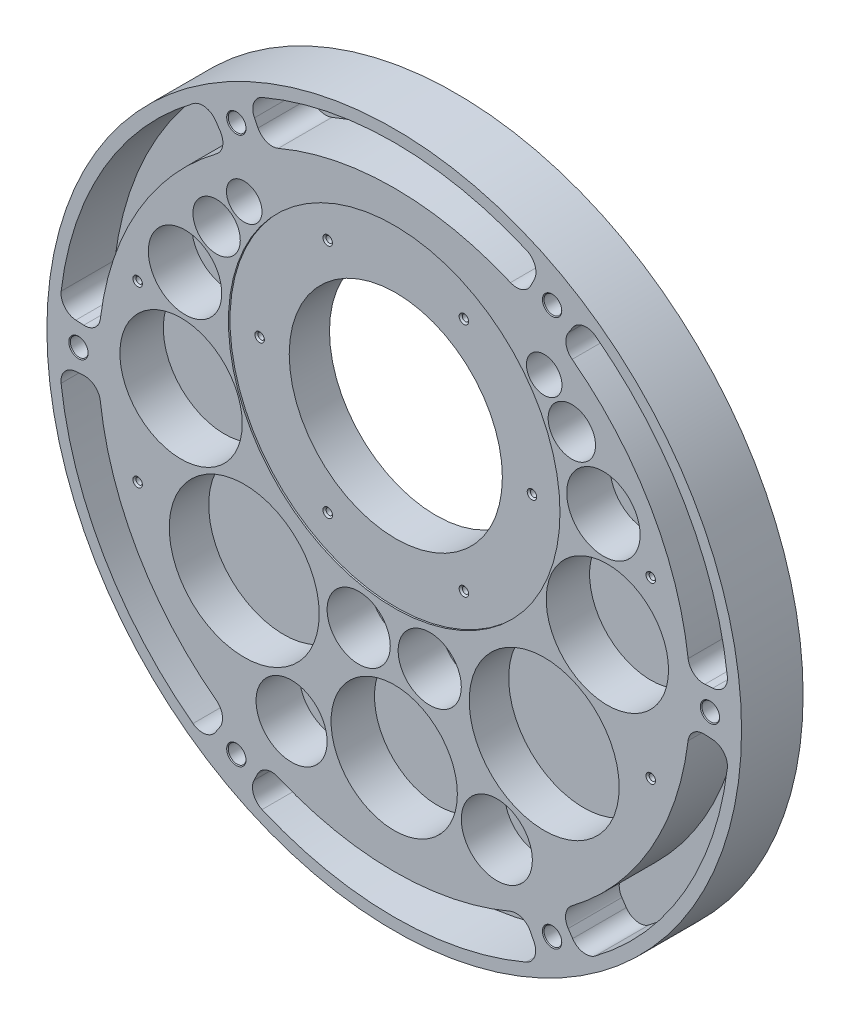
ISO-10303-21;
HEADER;
FILE_DESCRIPTION(('STEP AP214'),'2;1');
FILE_NAME('part.step','',(''),(''),'','','');
FILE_SCHEMA(('AUTOMOTIVE_DESIGN { 1 0 10303 214 1 1 1 1 }'));
ENDSEC;
DATA;
#1=APPLICATION_CONTEXT('core data for automotive mechanical design processes');
#2=APPLICATION_PROTOCOL_DEFINITION('international standard','automotive_design',2000,#1);
#3=PRODUCT_CONTEXT('',#1,'mechanical');
#4=PRODUCT('Part','Part','',(#3));
#5=PRODUCT_RELATED_PRODUCT_CATEGORY('part','',(#4));
#6=PRODUCT_DEFINITION_FORMATION('','',#4);
#7=PRODUCT_DEFINITION_CONTEXT('part definition',#1,'design');
#8=PRODUCT_DEFINITION('design','',#6,#7);
#9=PRODUCT_DEFINITION_SHAPE('','',#8);
#10=(LENGTH_UNIT() NAMED_UNIT(*) SI_UNIT(.MILLI.,.METRE.));
#11=(NAMED_UNIT(*) PLANE_ANGLE_UNIT() SI_UNIT($,.RADIAN.));
#12=(NAMED_UNIT(*) SI_UNIT($,.STERADIAN.) SOLID_ANGLE_UNIT());
#13=UNCERTAINTY_MEASURE_WITH_UNIT(LENGTH_MEASURE(1.E-05),#10,'distance_accuracy_value','');
#14=(GEOMETRIC_REPRESENTATION_CONTEXT(3) GLOBAL_UNCERTAINTY_ASSIGNED_CONTEXT((#13)) GLOBAL_UNIT_ASSIGNED_CONTEXT((#10,
#11,#12)) REPRESENTATION_CONTEXT('',''));
#15=CARTESIAN_POINT('',(0.,0.,0.));
#16=DIRECTION('',(0.,0.,1.));
#17=DIRECTION('',(1.,0.,0.));
#18=AXIS2_PLACEMENT_3D('',#15,#16,#17);
#19=CARTESIAN_POINT('',(0.,78.7908,0.));
#20=DIRECTION('',(0.,0.,1.));
#21=DIRECTION('',(1.,0.,0.));
#22=AXIS2_PLACEMENT_3D('',#19,#20,#21);
#23=CYLINDRICAL_SURFACE('',#22,85.725);
#24=CARTESIAN_POINT('',(0.,78.7908,48.26));
#25=DIRECTION('',(0.,0.,1.));
#26=DIRECTION('',(1.,0.,0.));
#27=AXIS2_PLACEMENT_3D('',#24,#25,#26);
#28=CIRCLE('',#27,85.725);
#29=CARTESIAN_POINT('',(85.725,78.7908,48.26));
#30=VERTEX_POINT('',#29);
#31=EDGE_CURVE('E971',#30,#30,#28,.F.);
#32=ORIENTED_EDGE('',*,*,#31,.F.);
#33=EDGE_LOOP('',(#32));
#34=FACE_BOUND('',#33,.T.);
#35=CARTESIAN_POINT('',(0.,78.7908,15.875));
#36=DIRECTION('',(0.,0.,-1.));
#37=DIRECTION('',(-1.,0.,0.));
#38=AXIS2_PLACEMENT_3D('',#35,#36,#37);
#39=CIRCLE('',#38,85.725);
#40=CARTESIAN_POINT('',(-85.725,78.7908,15.875));
#41=VERTEX_POINT('',#40);
#42=EDGE_CURVE('E102',#41,#41,#39,.F.);
#43=ORIENTED_EDGE('',*,*,#42,.F.);
#44=EDGE_LOOP('',(#43));
#45=FACE_BOUND('',#44,.T.);
#46=ADVANCED_FACE('F98',(#34,#45),#23,.F.);
#47=CARTESIAN_POINT('',(0.,0.,49.53));
#48=DIRECTION('',(0.,0.,-1.));
#49=DIRECTION('',(-1.,0.,0.));
#50=AXIS2_PLACEMENT_3D('',#47,#48,#49);
#51=CYLINDRICAL_SURFACE('',#50,279.4);
#52=CARTESIAN_POINT('',(0.,0.,49.53));
#53=DIRECTION('',(0.,0.,1.));
#54=DIRECTION('',(1.,0.,0.));
#55=AXIS2_PLACEMENT_3D('',#52,#53,#54);
#56=CIRCLE('',#55,279.4);
#57=CARTESIAN_POINT('',(279.4,0.,49.53));
#58=VERTEX_POINT('',#57);
#59=EDGE_CURVE('E14',#58,#58,#56,.T.);
#60=ORIENTED_EDGE('',*,*,#59,.F.);
#61=EDGE_LOOP('',(#60));
#62=FACE_BOUND('',#61,.T.);
#63=CARTESIAN_POINT('',(0.,0.,0.));
#64=DIRECTION('',(0.,0.,1.));
#65=DIRECTION('',(1.,0.,0.));
#66=AXIS2_PLACEMENT_3D('',#63,#64,#65);
#67=CIRCLE('',#66,279.4);
#68=CARTESIAN_POINT('',(279.4,0.,0.));
#69=VERTEX_POINT('',#68);
#70=EDGE_CURVE('E107',#69,#69,#67,.T.);
#71=ORIENTED_EDGE('',*,*,#70,.T.);
#72=EDGE_LOOP('',(#71));
#73=FACE_BOUND('',#72,.T.);
#74=ADVANCED_FACE('F100',(#62,#73),#51,.T.);
#75=CARTESIAN_POINT('',(0.,0.,49.53));
#76=DIRECTION('',(0.,0.,1.));
#77=DIRECTION('',(1.,0.,0.));
#78=AXIS2_PLACEMENT_3D('',#75,#76,#77);
#79=PLANE('',#78);
#80=CARTESIAN_POINT('',(-206.375,69.977,49.53));
#81=DIRECTION('',(0.,0.,1.));
#82=DIRECTION('',(1.,0.,0.));
#83=AXIS2_PLACEMENT_3D('',#80,#81,#82);
#84=CIRCLE('',#83,3.81000000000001);
#85=CARTESIAN_POINT('',(-202.565,69.977,49.53));
#86=VERTEX_POINT('',#85);
#87=EDGE_CURVE('E452',#86,#86,#84,.T.);
#88=ORIENTED_EDGE('',*,*,#87,.F.);
#89=EDGE_LOOP('',(#88));
#90=FACE_BOUND('',#89,.T.);
#91=CARTESIAN_POINT('',(-206.375,-69.977,49.53));
#92=DIRECTION('',(0.,0.,1.));
#93=DIRECTION('',(1.,0.,0.));
#94=AXIS2_PLACEMENT_3D('',#91,#92,#93);
#95=CIRCLE('',#94,3.81000000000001);
#96=CARTESIAN_POINT('',(-202.565,-69.977,49.53));
#97=VERTEX_POINT('',#96);
#98=EDGE_CURVE('E445',#97,#97,#95,.T.);
#99=ORIENTED_EDGE('',*,*,#98,.F.);
#100=EDGE_LOOP('',(#99));
#101=FACE_BOUND('',#100,.T.);
#102=CARTESIAN_POINT('',(206.375,-69.977,49.53));
#103=DIRECTION('',(0.,0.,1.));
#104=DIRECTION('',(1.,0.,0.));
#105=AXIS2_PLACEMENT_3D('',#102,#103,#104);
#106=CIRCLE('',#105,3.81000000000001);
#107=CARTESIAN_POINT('',(210.185,-69.977,49.53));
#108=VERTEX_POINT('',#107);
#109=EDGE_CURVE('E461',#108,#108,#106,.T.);
#110=ORIENTED_EDGE('',*,*,#109,.F.);
#111=EDGE_LOOP('',(#110));
#112=FACE_BOUND('',#111,.T.);
#113=CARTESIAN_POINT('',(206.375,69.977,49.53));
#114=DIRECTION('',(0.,0.,1.));
#115=DIRECTION('',(1.,0.,0.));
#116=AXIS2_PLACEMENT_3D('',#113,#114,#115);
#117=CIRCLE('',#116,3.81000000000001);
#118=CARTESIAN_POINT('',(210.185,69.977,49.53));
#119=VERTEX_POINT('',#118);
#120=EDGE_CURVE('E470',#119,#119,#117,.T.);
#121=ORIENTED_EDGE('',*,*,#120,.F.);
#122=EDGE_LOOP('',(#121));
#123=FACE_BOUND('',#122,.T.);
#124=CARTESIAN_POINT('',(0.,-158.75,49.53));
#125=DIRECTION('',(0.,0.,1.));
#126=DIRECTION('',(1.,0.,0.));
#127=AXIS2_PLACEMENT_3D('',#124,#125,#126);
#128=CIRCLE('',#127,50.8);
#129=CARTESIAN_POINT('',(50.8,-158.75,49.53));
#130=VERTEX_POINT('',#129);
#131=EDGE_CURVE('E488',#130,#130,#128,.T.);
#132=ORIENTED_EDGE('',*,*,#131,.F.);
#133=EDGE_LOOP('',(#132));
#134=FACE_BOUND('',#133,.T.);
#135=CARTESIAN_POINT('',(28.575,-82.55,49.53));
#136=DIRECTION('',(0.,0.,1.));
#137=DIRECTION('',(1.,0.,0.));
#138=AXIS2_PLACEMENT_3D('',#135,#136,#137);
#139=CIRCLE('',#138,25.4);
#140=CARTESIAN_POINT('',(53.975,-82.55,49.53));
#141=VERTEX_POINT('',#140);
#142=EDGE_CURVE('E501',#141,#141,#139,.T.);
#143=ORIENTED_EDGE('',*,*,#142,.F.);
#144=EDGE_LOOP('',(#143));
#145=FACE_BOUND('',#144,.T.);
#146=CARTESIAN_POINT('',(-82.55,-174.625,49.53));
#147=DIRECTION('',(0.,0.,1.));
#148=DIRECTION('',(1.,0.,0.));
#149=AXIS2_PLACEMENT_3D('',#146,#147,#148);
#150=CIRCLE('',#149,28.575);
#151=CARTESIAN_POINT('',(-53.975,-174.625,49.53));
#152=VERTEX_POINT('',#151);
#153=EDGE_CURVE('E489',#152,#152,#150,.T.);
#154=ORIENTED_EDGE('',*,*,#153,.F.);
#155=EDGE_LOOP('',(#154));
#156=FACE_BOUND('',#155,.T.);
#157=CARTESIAN_POINT('',(82.55,-174.625,49.53));
#158=DIRECTION('',(0.,0.,1.));
#159=DIRECTION('',(1.,0.,0.));
#160=AXIS2_PLACEMENT_3D('',#157,#158,#159);
#161=CIRCLE('',#160,28.575);
#162=CARTESIAN_POINT('',(111.125,-174.625,49.53));
#163=VERTEX_POINT('',#162);
#164=EDGE_CURVE('E495',#163,#163,#161,.T.);
#165=ORIENTED_EDGE('',*,*,#164,.F.);
#166=EDGE_LOOP('',(#165));
#167=FACE_BOUND('',#166,.T.);
#168=CARTESIAN_POINT('',(-28.575,-82.55,49.53));
#169=DIRECTION('',(0.,0.,1.));
#170=DIRECTION('',(1.,0.,0.));
#171=AXIS2_PLACEMENT_3D('',#168,#169,#170);
#172=CIRCLE('',#171,25.4);
#173=CARTESIAN_POINT('',(-3.17499999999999,-82.55,49.53));
#174=VERTEX_POINT('',#173);
#175=EDGE_CURVE('E507',#174,#174,#172,.T.);
#176=ORIENTED_EDGE('',*,*,#175,.F.);
#177=EDGE_LOOP('',(#176));
#178=FACE_BOUND('',#177,.T.);
#179=CARTESIAN_POINT('',(-120.65,-88.9,49.53));
#180=DIRECTION('',(0.,0.,1.));
#181=DIRECTION('',(1.,0.,0.));
#182=AXIS2_PLACEMENT_3D('',#179,#180,#181);
#183=CIRCLE('',#182,60.325);
#184=CARTESIAN_POINT('',(-60.325,-88.9,49.53));
#185=VERTEX_POINT('',#184);
#186=EDGE_CURVE('E520',#185,#185,#183,.T.);
#187=ORIENTED_EDGE('',*,*,#186,.F.);
#188=EDGE_LOOP('',(#187));
#189=FACE_BOUND('',#188,.T.);
#190=CARTESIAN_POINT('',(120.65,-88.9,49.53));
#191=DIRECTION('',(0.,0.,1.));
#192=DIRECTION('',(1.,0.,0.));
#193=AXIS2_PLACEMENT_3D('',#190,#191,#192);
#194=CIRCLE('',#193,60.325);
#195=CARTESIAN_POINT('',(180.975,-88.9,49.53));
#196=VERTEX_POINT('',#195);
#197=EDGE_CURVE('E513',#196,#196,#194,.T.);
#198=ORIENTED_EDGE('',*,*,#197,.F.);
#199=EDGE_LOOP('',(#198));
#200=FACE_BOUND('',#199,.T.);
#201=CARTESIAN_POINT('',(-171.45,12.7,49.53));
#202=DIRECTION('',(0.,0.,1.));
#203=DIRECTION('',(1.,0.,0.));
#204=AXIS2_PLACEMENT_3D('',#201,#202,#203);
#205=CIRCLE('',#204,49.2125);
#206=CARTESIAN_POINT('',(-122.2375,12.7,49.53));
#207=VERTEX_POINT('',#206);
#208=EDGE_CURVE('E532',#207,#207,#205,.T.);
#209=ORIENTED_EDGE('',*,*,#208,.F.);
#210=EDGE_LOOP('',(#209));
#211=FACE_BOUND('',#210,.T.);
#212=CARTESIAN_POINT('',(171.45,12.7000000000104,49.53));
#213=DIRECTION('',(0.,0.,1.));
#214=DIRECTION('',(1.,0.,0.));
#215=AXIS2_PLACEMENT_3D('',#212,#213,#214);
#216=CIRCLE('',#215,49.2125);
#217=CARTESIAN_POINT('',(220.6625,12.7000000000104,49.53));
#218=VERTEX_POINT('',#217);
#219=EDGE_CURVE('E519',#218,#218,#216,.T.);
#220=ORIENTED_EDGE('',*,*,#219,.F.);
#221=EDGE_LOOP('',(#220));
#222=FACE_BOUND('',#221,.T.);
#223=CARTESIAN_POINT('',(-168.275,95.25,49.53));
#224=DIRECTION('',(0.,0.,1.));
#225=DIRECTION('',(1.,0.,0.));
#226=AXIS2_PLACEMENT_3D('',#223,#224,#225);
#227=CIRCLE('',#226,29.5275);
#228=CARTESIAN_POINT('',(-138.7475,95.25,49.53));
#229=VERTEX_POINT('',#228);
#230=EDGE_CURVE('E544',#229,#229,#227,.T.);
#231=ORIENTED_EDGE('',*,*,#230,.F.);
#232=EDGE_LOOP('',(#231));
#233=FACE_BOUND('',#232,.T.);
#234=CARTESIAN_POINT('',(168.275,95.25,49.53));
#235=DIRECTION('',(0.,0.,1.));
#236=DIRECTION('',(1.,0.,0.));
#237=AXIS2_PLACEMENT_3D('',#234,#235,#236);
#238=CIRCLE('',#237,29.5275);
#239=CARTESIAN_POINT('',(197.8025,95.25,49.53));
#240=VERTEX_POINT('',#239);
#241=EDGE_CURVE('E531',#240,#240,#238,.T.);
#242=ORIENTED_EDGE('',*,*,#241,.F.);
#243=EDGE_LOOP('',(#242));
#244=FACE_BOUND('',#243,.T.);
#245=CARTESIAN_POINT('',(-142.875,139.7,49.53));
#246=DIRECTION('',(0.,0.,1.));
#247=DIRECTION('',(1.,0.,0.));
#248=AXIS2_PLACEMENT_3D('',#245,#246,#247);
#249=CIRCLE('',#248,19.05);
#250=CARTESIAN_POINT('',(-123.825,139.7,49.53));
#251=VERTEX_POINT('',#250);
#252=EDGE_CURVE('E556',#251,#251,#249,.T.);
#253=ORIENTED_EDGE('',*,*,#252,.F.);
#254=EDGE_LOOP('',(#253));
#255=FACE_BOUND('',#254,.T.);
#256=CARTESIAN_POINT('',(142.875,139.7,49.53));
#257=DIRECTION('',(0.,0.,1.));
#258=DIRECTION('',(1.,0.,0.));
#259=AXIS2_PLACEMENT_3D('',#256,#257,#258);
#260=CIRCLE('',#259,19.05);
#261=CARTESIAN_POINT('',(161.925,139.7,49.53));
#262=VERTEX_POINT('',#261);
#263=EDGE_CURVE('E543',#262,#262,#260,.T.);
#264=ORIENTED_EDGE('',*,*,#263,.F.);
#265=EDGE_LOOP('',(#264));
#266=FACE_BOUND('',#265,.T.);
#267=CARTESIAN_POINT('',(-120.65,168.275,49.53));
#268=DIRECTION('',(0.,0.,1.));
#269=DIRECTION('',(1.,0.,0.));
#270=AXIS2_PLACEMENT_3D('',#267,#268,#269);
#271=CIRCLE('',#270,14.2875);
#272=CARTESIAN_POINT('',(-106.3625,168.275,49.53));
#273=VERTEX_POINT('',#272);
#274=EDGE_CURVE('E568',#273,#273,#271,.T.);
#275=ORIENTED_EDGE('',*,*,#274,.F.);
#276=EDGE_LOOP('',(#275));
#277=FACE_BOUND('',#276,.T.);
#278=CARTESIAN_POINT('',(120.65,168.275,49.53));
#279=DIRECTION('',(0.,0.,1.));
#280=DIRECTION('',(1.,0.,0.));
#281=AXIS2_PLACEMENT_3D('',#278,#279,#280);
#282=CIRCLE('',#281,14.2875);
#283=CARTESIAN_POINT('',(134.9375,168.275,49.53));
#284=VERTEX_POINT('',#283);
#285=EDGE_CURVE('E555',#284,#284,#282,.T.);
#286=ORIENTED_EDGE('',*,*,#285,.F.);
#287=EDGE_LOOP('',(#286));
#288=FACE_BOUND('',#287,.T.);
#289=CARTESIAN_POINT('',(249.02314938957,30.0108595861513,49.53));
#290=DIRECTION('',(0.,0.,1.));
#291=DIRECTION('',(1.,0.,0.));
#292=AXIS2_PLACEMENT_3D('',#289,#290,#291);
#293=CIRCLE('',#292,12.7);
#294=CARTESIAN_POINT('',(236.414382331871,28.4913223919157,49.53));
#295=VERTEX_POINT('',#294);
#296=CARTESIAN_POINT('',(249.909056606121,17.3417961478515,49.53));
#297=VERTEX_POINT('',#296);
#298=EDGE_CURVE('E115',#295,#297,#293,.T.);
#299=ORIENTED_EDGE('',*,*,#298,.F.);
#300=CARTESIAN_POINT('',(0.,0.,49.53));
#301=DIRECTION('',(0.,0.,-1.));
#302=DIRECTION('',(1.,0.,0.));
#303=AXIS2_PLACEMENT_3D('',#300,#301,#302);
#304=CIRCLE('',#303,238.125);
#305=CARTESIAN_POINT('',(143.139935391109,190.301010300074,49.53));
#306=VERTEX_POINT('',#305);
#307=EDGE_CURVE('E668',#306,#295,#304,.T.);
#308=ORIENTED_EDGE('',*,*,#307,.F.);
#309=CARTESIAN_POINT('',(150.774065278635,200.450397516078,49.53));
#310=DIRECTION('',(0.,0.,1.));
#311=DIRECTION('',(-1.,0.,0.));
#312=AXIS2_PLACEMENT_3D('',#309,#310,#311);
#313=CIRCLE('',#312,12.6999999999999);
#314=CARTESIAN_POINT('',(140.162675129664,207.428104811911,49.53));
#315=VERTEX_POINT('',#314);
#316=EDGE_CURVE('E665',#315,#306,#313,.T.);
#317=ORIENTED_EDGE('',*,*,#316,.F.);
#318=DIRECTION('',(-0.549425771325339,-0.835542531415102,0.));
#319=VECTOR('',#318,1.);
#320=CARTESIAN_POINT('',(140.162675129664,207.428104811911,49.53));
#321=LINE('',#320,#319);
#322=CARTESIAN_POINT('',(143.658338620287,212.744155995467,49.53));
#323=VERTEX_POINT('',#322);
#324=EDGE_CURVE('E662',#323,#315,#321,.T.);
#325=ORIENTED_EDGE('',*,*,#324,.F.);
#326=CARTESIAN_POINT('',(154.269728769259,205.766448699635,49.53));
#327=DIRECTION('',(0.,0.,1.));
#328=DIRECTION('',(-1.,0.,0.));
#329=AXIS2_PLACEMENT_3D('',#326,#327,#328);
#330=CIRCLE('',#329,12.7);
#331=CARTESIAN_POINT('',(161.887986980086,215.927754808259,49.53));
#332=VERTEX_POINT('',#331);
#333=EDGE_CURVE('E659',#332,#323,#330,.T.);
#334=ORIENTED_EDGE('',*,*,#333,.F.);
#335=CARTESIAN_POINT('',(0.,0.,49.53));
#336=DIRECTION('',(0.,0.,1.));
#337=DIRECTION('',(1.,0.,0.));
#338=AXIS2_PLACEMENT_3D('',#335,#336,#337);
#339=CIRCLE('',#338,269.875);
#340=CARTESIAN_POINT('',(267.976088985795,31.958275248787,49.53));
#341=VERTEX_POINT('',#340);
#342=EDGE_CURVE('E656',#341,#332,#339,.T.);
#343=ORIENTED_EDGE('',*,*,#342,.F.);
#344=CARTESIAN_POINT('',(255.365449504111,30.45435641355,49.53));
#345=DIRECTION('',(0.,0.,1.));
#346=DIRECTION('',(1.,0.,0.));
#347=AXIS2_PLACEMENT_3D('',#344,#345,#346);
#348=CIRCLE('',#347,12.7);
#349=CARTESIAN_POINT('',(256.251356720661,17.7852929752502,49.53));
#350=VERTEX_POINT('',#349);
#351=EDGE_CURVE('E653',#350,#341,#348,.T.);
#352=ORIENTED_EDGE('',*,*,#351,.F.);
#353=DIRECTION('',(0.997564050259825,0.0697564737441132,0.));
#354=VECTOR('',#353,1.);
#355=CARTESIAN_POINT('',(249.909056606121,17.3417961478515,49.53));
#356=LINE('',#355,#354);
#357=EDGE_CURVE('E649',#297,#350,#356,.T.);
#358=ORIENTED_EDGE('',*,*,#357,.F.);
#359=EDGE_LOOP('',(#299,#308,#317,#325,#334,#343,#352,#358));
#360=FACE_BOUND('',#359,.T.);
#361=CARTESIAN_POINT('',(150.5017414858,-200.6549437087,49.53));
#362=DIRECTION('',(0.,0.,1.));
#363=DIRECTION('',(1.,0.,0.));
#364=AXIS2_PLACEMENT_3D('',#361,#362,#363);
#365=CIRCLE('',#364,12.7);
#366=CARTESIAN_POINT('',(142.881400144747,-190.495199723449,49.53));
#367=VERTEX_POINT('',#366);
#368=CARTESIAN_POINT('',(139.972964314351,-207.756693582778,49.53));
#369=VERTEX_POINT('',#368);
#370=EDGE_CURVE('E123',#367,#369,#365,.T.);
#371=ORIENTED_EDGE('',*,*,#370,.F.);
#372=CARTESIAN_POINT('',(0.,0.,49.53));
#373=DIRECTION('',(0.,0.,-1.));
#374=DIRECTION('',(1.,0.,0.));
#375=AXIS2_PLACEMENT_3D('',#372,#373,#374);
#376=CIRCLE('',#375,238.125);
#377=CARTESIAN_POINT('',(236.375476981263,-28.8123151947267,49.53));
#378=VERTEX_POINT('',#377);
#379=EDGE_CURVE('E723',#378,#367,#376,.T.);
#380=ORIENTED_EDGE('',*,*,#379,.F.);
#381=CARTESIAN_POINT('',(248.982169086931,-30.3489720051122,49.53));
#382=DIRECTION('',(0.,0.,1.));
#383=DIRECTION('',(-1.,0.,0.));
#384=AXIS2_PLACEMENT_3D('',#381,#382,#383);
#385=CIRCLE('',#384,12.6999999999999);
#386=CARTESIAN_POINT('',(249.719345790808,-17.6703849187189,49.53));
#387=VERTEX_POINT('',#386);
#388=EDGE_CURVE('E720',#387,#378,#385,.T.);
#389=ORIENTED_EDGE('',*,*,#388,.F.);
#390=DIRECTION('',(-0.998313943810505,0.0580454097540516,0.));
#391=VECTOR('',#390,1.);
#392=CARTESIAN_POINT('',(249.719345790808,-17.670384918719,49.53));
#393=LINE('',#392,#391);
#394=CARTESIAN_POINT('',(256.071012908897,-18.0396927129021,49.53));
#395=VERTEX_POINT('',#394);
#396=EDGE_CURVE('E717',#395,#387,#393,.T.);
#397=ORIENTED_EDGE('',*,*,#396,.F.);
#398=CARTESIAN_POINT('',(255.33383620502,-30.7182797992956,49.53));
#399=DIRECTION('',(0.,0.,1.));
#400=DIRECTION('',(-1.,0.,0.));
#401=AXIS2_PLACEMENT_3D('',#398,#399,#400);
#402=CIRCLE('',#401,12.7000000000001);
#403=CARTESIAN_POINT('',(267.942914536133,-32.2352318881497,49.53));
#404=VERTEX_POINT('',#403);
#405=EDGE_CURVE('E714',#404,#395,#402,.T.);
#406=ORIENTED_EDGE('',*,*,#405,.F.);
#407=CARTESIAN_POINT('',(0.,0.,49.53));
#408=DIRECTION('',(0.,0.,1.));
#409=DIRECTION('',(1.,0.,0.));
#410=AXIS2_PLACEMENT_3D('',#407,#408,#409);
#411=CIRCLE('',#410,269.875);
#412=CARTESIAN_POINT('',(161.664722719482,-216.094963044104,49.53));
#413=VERTEX_POINT('',#412);
#414=EDGE_CURVE('E711',#413,#404,#411,.T.);
#415=ORIENTED_EDGE('',*,*,#414,.F.);
#416=CARTESIAN_POINT('',(154.056971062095,-205.925788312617,49.53));
#417=DIRECTION('',(0.,0.,1.));
#418=DIRECTION('',(1.,0.,0.));
#419=AXIS2_PLACEMENT_3D('',#416,#417,#418);
#420=CIRCLE('',#419,12.7);
#421=CARTESIAN_POINT('',(143.528193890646,-213.027538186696,49.53));
#422=VERTEX_POINT('',#421);
#423=EDGE_CURVE('E708',#422,#413,#420,.T.);
#424=ORIENTED_EDGE('',*,*,#423,.F.);
#425=DIRECTION('',(0.55919290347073,-0.829037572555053,0.));
#426=VECTOR('',#425,1.);
#427=CARTESIAN_POINT('',(139.972964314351,-207.756693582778,49.53));
#428=LINE('',#427,#426);
#429=EDGE_CURVE('E704',#369,#422,#428,.T.);
#430=ORIENTED_EDGE('',*,*,#429,.F.);
#431=EDGE_LOOP('',(#371,#380,#389,#397,#406,#415,#424,#430));
#432=FACE_BOUND('',#431,.T.);
#433=CARTESIAN_POINT('',(-98.5214079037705,-230.665803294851,49.53));
#434=DIRECTION('',(0.,0.,1.));
#435=DIRECTION('',(1.,0.,0.));
#436=AXIS2_PLACEMENT_3D('',#433,#434,#435);
#437=CIRCLE('',#436,12.7);
#438=CARTESIAN_POINT('',(-93.5329821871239,-218.986522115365,49.53));
#439=VERTEX_POINT('',#438);
#440=CARTESIAN_POINT('',(-109.93609229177,-225.09848973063,49.53));
#441=VERTEX_POINT('',#440);
#442=EDGE_CURVE('E757',#439,#441,#437,.T.);
#443=ORIENTED_EDGE('',*,*,#442,.F.);
#444=CARTESIAN_POINT('',(0.,0.,49.53));
#445=DIRECTION('',(0.,0.,-1.));
#446=DIRECTION('',(1.,0.,0.));
#447=AXIS2_PLACEMENT_3D('',#444,#445,#446);
#448=CIRCLE('',#447,238.125);
#449=CARTESIAN_POINT('',(93.235541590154,-219.113325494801,49.53));
#450=VERTEX_POINT('',#449);
#451=EDGE_CURVE('E778',#450,#439,#448,.T.);
#452=ORIENTED_EDGE('',*,*,#451,.F.);
#453=CARTESIAN_POINT('',(98.2081038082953,-230.799369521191,49.53));
#454=DIRECTION('',(0.,0.,1.));
#455=DIRECTION('',(-1.,0.,0.));
#456=AXIS2_PLACEMENT_3D('',#453,#454,#455);
#457=CIRCLE('',#456,12.6999999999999);
#458=CARTESIAN_POINT('',(109.556670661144,-225.09848973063,49.53));
#459=VERTEX_POINT('',#458);
#460=EDGE_CURVE('E775',#459,#450,#457,.T.);
#461=ORIENTED_EDGE('',*,*,#460,.F.);
#462=DIRECTION('',(-0.448888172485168,0.893587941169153,0.));
#463=VECTOR('',#462,1.);
#464=CARTESIAN_POINT('',(109.556670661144,-225.09848973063,49.53));
#465=LINE('',#464,#463);
#466=CARTESIAN_POINT('',(112.41267428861,-230.783848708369,49.53));
#467=VERTEX_POINT('',#466);
#468=EDGE_CURVE('E772',#467,#459,#465,.T.);
#469=ORIENTED_EDGE('',*,*,#468,.F.);
#470=CARTESIAN_POINT('',(101.064107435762,-236.48472849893,49.53));
#471=DIRECTION('',(0.,0.,1.));
#472=DIRECTION('',(-1.,0.,0.));
#473=AXIS2_PLACEMENT_3D('',#470,#471,#472);
#474=CIRCLE('',#473,12.7);
#475=CARTESIAN_POINT('',(106.054927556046,-248.162986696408,49.53));
#476=VERTEX_POINT('',#475);
#477=EDGE_CURVE('E769',#476,#467,#474,.T.);
#478=ORIENTED_EDGE('',*,*,#477,.F.);
#479=CARTESIAN_POINT('',(0.,0.,49.53));
#480=DIRECTION('',(0.,0.,1.));
#481=DIRECTION('',(1.,0.,0.));
#482=AXIS2_PLACEMENT_3D('',#479,#480,#481);
#483=CIRCLE('',#482,269.875);
#484=CARTESIAN_POINT('',(-106.311366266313,-248.053238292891,49.53));
#485=VERTEX_POINT('',#484);
#486=EDGE_CURVE('E766',#485,#476,#483,.T.);
#487=ORIENTED_EDGE('',*,*,#486,.F.);
#488=CARTESIAN_POINT('',(-101.308478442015,-236.380144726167,49.53));
#489=DIRECTION('',(0.,0.,1.));
#490=DIRECTION('',(1.,0.,0.));
#491=AXIS2_PLACEMENT_3D('',#488,#489,#490);
#492=CIRCLE('',#491,12.7);
#493=CARTESIAN_POINT('',(-112.723162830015,-230.812831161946,49.53));
#494=VERTEX_POINT('',#493);
#495=EDGE_CURVE('E763',#494,#485,#492,.T.);
#496=ORIENTED_EDGE('',*,*,#495,.F.);
#497=DIRECTION('',(-0.438371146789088,-0.898794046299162,0.));
#498=VECTOR('',#497,1.);
#499=CARTESIAN_POINT('',(-109.93609229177,-225.09848973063,49.53));
#500=LINE('',#499,#498);
#501=EDGE_CURVE('E759',#441,#494,#500,.T.);
#502=ORIENTED_EDGE('',*,*,#501,.F.);
#503=EDGE_LOOP('',(#443,#452,#461,#469,#478,#487,#496,#502));
#504=FACE_BOUND('',#503,.T.);
#505=CARTESIAN_POINT('',(-249.02314938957,-30.0108595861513,49.53));
#506=DIRECTION('',(0.,0.,1.));
#507=DIRECTION('',(1.,0.,0.));
#508=AXIS2_PLACEMENT_3D('',#505,#506,#507);
#509=CIRCLE('',#508,12.7);
#510=CARTESIAN_POINT('',(-236.414382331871,-28.4913223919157,49.53));
#511=VERTEX_POINT('',#510);
#512=CARTESIAN_POINT('',(-249.909056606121,-17.3417961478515,49.53));
#513=VERTEX_POINT('',#512);
#514=EDGE_CURVE('E631',#511,#513,#509,.T.);
#515=ORIENTED_EDGE('',*,*,#514,.F.);
#516=CARTESIAN_POINT('',(0.,0.,49.53));
#517=DIRECTION('',(0.,0.,-1.));
#518=DIRECTION('',(1.,0.,0.));
#519=AXIS2_PLACEMENT_3D('',#516,#517,#518);
#520=CIRCLE('',#519,238.125);
#521=CARTESIAN_POINT('',(-143.139935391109,-190.301010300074,49.53));
#522=VERTEX_POINT('',#521);
#523=EDGE_CURVE('E832',#522,#511,#520,.T.);
#524=ORIENTED_EDGE('',*,*,#523,.F.);
#525=CARTESIAN_POINT('',(-150.774065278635,-200.450397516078,49.53));
#526=DIRECTION('',(0.,0.,1.));
#527=DIRECTION('',(-1.,0.,0.));
#528=AXIS2_PLACEMENT_3D('',#525,#526,#527);
#529=CIRCLE('',#528,12.6999999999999);
#530=CARTESIAN_POINT('',(-140.162675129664,-207.428104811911,49.53));
#531=VERTEX_POINT('',#530);
#532=EDGE_CURVE('E829',#531,#522,#529,.T.);
#533=ORIENTED_EDGE('',*,*,#532,.F.);
#534=DIRECTION('',(0.549425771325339,0.835542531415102,0.));
#535=VECTOR('',#534,1.);
#536=CARTESIAN_POINT('',(-140.162675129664,-207.428104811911,49.53));
#537=LINE('',#536,#535);
#538=CARTESIAN_POINT('',(-143.658338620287,-212.744155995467,49.53));
#539=VERTEX_POINT('',#538);
#540=EDGE_CURVE('E826',#539,#531,#537,.T.);
#541=ORIENTED_EDGE('',*,*,#540,.F.);
#542=CARTESIAN_POINT('',(-154.269728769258,-205.766448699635,49.53));
#543=DIRECTION('',(0.,0.,1.));
#544=DIRECTION('',(-1.,0.,0.));
#545=AXIS2_PLACEMENT_3D('',#542,#543,#544);
#546=CIRCLE('',#545,12.7);
#547=CARTESIAN_POINT('',(-161.887986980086,-215.927754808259,49.53));
#548=VERTEX_POINT('',#547);
#549=EDGE_CURVE('E823',#548,#539,#546,.T.);
#550=ORIENTED_EDGE('',*,*,#549,.F.);
#551=CARTESIAN_POINT('',(0.,0.,49.53));
#552=DIRECTION('',(0.,0.,1.));
#553=DIRECTION('',(1.,0.,0.));
#554=AXIS2_PLACEMENT_3D('',#551,#552,#553);
#555=CIRCLE('',#554,269.875);
#556=CARTESIAN_POINT('',(-267.976088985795,-31.9582752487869,49.53));
#557=VERTEX_POINT('',#556);
#558=EDGE_CURVE('E820',#557,#548,#555,.T.);
#559=ORIENTED_EDGE('',*,*,#558,.F.);
#560=CARTESIAN_POINT('',(-255.365449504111,-30.45435641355,49.53));
#561=DIRECTION('',(0.,0.,1.));
#562=DIRECTION('',(1.,0.,0.));
#563=AXIS2_PLACEMENT_3D('',#560,#561,#562);
#564=CIRCLE('',#563,12.7);
#565=CARTESIAN_POINT('',(-256.251356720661,-17.7852929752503,49.53));
#566=VERTEX_POINT('',#565);
#567=EDGE_CURVE('E817',#566,#557,#564,.T.);
#568=ORIENTED_EDGE('',*,*,#567,.F.);
#569=DIRECTION('',(-0.997564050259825,-0.0697564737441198,0.));
#570=VECTOR('',#569,1.);
#571=CARTESIAN_POINT('',(-249.909056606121,-17.3417961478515,49.53));
#572=LINE('',#571,#570);
#573=EDGE_CURVE('E814',#513,#566,#572,.T.);
#574=ORIENTED_EDGE('',*,*,#573,.F.);
#575=EDGE_LOOP('',(#515,#524,#533,#541,#550,#559,#568,#574));
#576=FACE_BOUND('',#575,.T.);
#577=CARTESIAN_POINT('',(-150.5017414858,200.6549437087,49.53));
#578=DIRECTION('',(0.,0.,1.));
#579=DIRECTION('',(1.,0.,0.));
#580=AXIS2_PLACEMENT_3D('',#577,#578,#579);
#581=CIRCLE('',#580,12.7);
#582=CARTESIAN_POINT('',(-142.881400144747,190.495199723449,49.53));
#583=VERTEX_POINT('',#582);
#584=CARTESIAN_POINT('',(-139.972964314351,207.756693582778,49.53));
#585=VERTEX_POINT('',#584);
#586=EDGE_CURVE('E567',#583,#585,#581,.T.);
#587=ORIENTED_EDGE('',*,*,#586,.F.);
#588=CARTESIAN_POINT('',(0.,0.,49.53));
#589=DIRECTION('',(0.,0.,-1.));
#590=DIRECTION('',(1.,0.,0.));
#591=AXIS2_PLACEMENT_3D('',#588,#589,#590);
#592=CIRCLE('',#591,238.125);
#593=CARTESIAN_POINT('',(-236.375476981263,28.8123151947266,49.53));
#594=VERTEX_POINT('',#593);
#595=EDGE_CURVE('E611',#594,#583,#592,.T.);
#596=ORIENTED_EDGE('',*,*,#595,.F.);
#597=CARTESIAN_POINT('',(-248.982169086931,30.348972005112,49.53));
#598=DIRECTION('',(0.,0.,1.));
#599=DIRECTION('',(-1.,0.,0.));
#600=AXIS2_PLACEMENT_3D('',#597,#598,#599);
#601=CIRCLE('',#600,12.6999999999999);
#602=CARTESIAN_POINT('',(-249.719345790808,17.6703849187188,49.53));
#603=VERTEX_POINT('',#602);
#604=EDGE_CURVE('E608',#603,#594,#601,.T.);
#605=ORIENTED_EDGE('',*,*,#604,.F.);
#606=DIRECTION('',(0.998313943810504,-0.0580454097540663,0.));
#607=VECTOR('',#606,1.);
#608=CARTESIAN_POINT('',(-249.719345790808,17.6703849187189,49.53));
#609=LINE('',#608,#607);
#610=CARTESIAN_POINT('',(-256.071012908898,18.0396927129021,49.53));
#611=VERTEX_POINT('',#610);
#612=EDGE_CURVE('E605',#611,#603,#609,.T.);
#613=ORIENTED_EDGE('',*,*,#612,.F.);
#614=CARTESIAN_POINT('',(-255.33383620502,30.7182797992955,49.53));
#615=DIRECTION('',(0.,0.,1.));
#616=DIRECTION('',(-1.,0.,0.));
#617=AXIS2_PLACEMENT_3D('',#614,#615,#616);
#618=CIRCLE('',#617,12.7);
#619=CARTESIAN_POINT('',(-267.942914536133,32.2352318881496,49.53));
#620=VERTEX_POINT('',#619);
#621=EDGE_CURVE('E602',#620,#611,#618,.T.);
#622=ORIENTED_EDGE('',*,*,#621,.F.);
#623=CARTESIAN_POINT('',(0.,0.,49.53));
#624=DIRECTION('',(0.,0.,1.));
#625=DIRECTION('',(1.,0.,0.));
#626=AXIS2_PLACEMENT_3D('',#623,#624,#625);
#627=CIRCLE('',#626,269.875);
#628=CARTESIAN_POINT('',(-161.664722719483,216.094963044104,49.53));
#629=VERTEX_POINT('',#628);
#630=EDGE_CURVE('E599',#629,#620,#627,.T.);
#631=ORIENTED_EDGE('',*,*,#630,.F.);
#632=CARTESIAN_POINT('',(-154.056971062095,205.925788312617,49.53));
#633=DIRECTION('',(0.,0.,1.));
#634=DIRECTION('',(1.,0.,0.));
#635=AXIS2_PLACEMENT_3D('',#632,#633,#634);
#636=CIRCLE('',#635,12.7);
#637=CARTESIAN_POINT('',(-143.528193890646,213.027538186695,49.53));
#638=VERTEX_POINT('',#637);
#639=EDGE_CURVE('E596',#638,#629,#636,.T.);
#640=ORIENTED_EDGE('',*,*,#639,.F.);
#641=DIRECTION('',(-0.559192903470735,0.82903757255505,0.));
#642=VECTOR('',#641,1.);
#643=CARTESIAN_POINT('',(-139.972964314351,207.756693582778,49.53));
#644=LINE('',#643,#642);
#645=EDGE_CURVE('E593',#585,#638,#644,.T.);
#646=ORIENTED_EDGE('',*,*,#645,.F.);
#647=EDGE_LOOP('',(#587,#596,#605,#613,#622,#631,#640,#646));
#648=FACE_BOUND('',#647,.T.);
#649=CARTESIAN_POINT('',(98.5214079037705,230.665803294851,49.53));
#650=DIRECTION('',(0.,0.,1.));
#651=DIRECTION('',(1.,0.,0.));
#652=AXIS2_PLACEMENT_3D('',#649,#650,#651);
#653=CIRCLE('',#652,12.7);
#654=CARTESIAN_POINT('',(93.5329821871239,218.986522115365,49.53));
#655=VERTEX_POINT('',#654);
#656=CARTESIAN_POINT('',(109.93609229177,225.09848973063,49.53));
#657=VERTEX_POINT('',#656);
#658=EDGE_CURVE('E687',#655,#657,#653,.T.);
#659=ORIENTED_EDGE('',*,*,#658,.F.);
#660=CARTESIAN_POINT('',(0.,0.,49.53));
#661=DIRECTION('',(0.,0.,-1.));
#662=DIRECTION('',(1.,0.,0.));
#663=AXIS2_PLACEMENT_3D('',#660,#661,#662);
#664=CIRCLE('',#663,238.125);
#665=CARTESIAN_POINT('',(-93.2355415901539,219.113325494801,49.53));
#666=VERTEX_POINT('',#665);
#667=EDGE_CURVE('E887',#666,#655,#664,.T.);
#668=ORIENTED_EDGE('',*,*,#667,.F.);
#669=CARTESIAN_POINT('',(-98.2081038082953,230.799369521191,49.53));
#670=DIRECTION('',(0.,0.,1.));
#671=DIRECTION('',(-1.,0.,0.));
#672=AXIS2_PLACEMENT_3D('',#669,#670,#671);
#673=CIRCLE('',#672,12.6999999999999);
#674=CARTESIAN_POINT('',(-109.556670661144,225.09848973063,49.53));
#675=VERTEX_POINT('',#674);
#676=EDGE_CURVE('E884',#675,#666,#673,.T.);
#677=ORIENTED_EDGE('',*,*,#676,.F.);
#678=DIRECTION('',(0.448888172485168,-0.893587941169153,0.));
#679=VECTOR('',#678,1.);
#680=CARTESIAN_POINT('',(-109.556670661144,225.09848973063,49.53));
#681=LINE('',#680,#679);
#682=CARTESIAN_POINT('',(-112.41267428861,230.783848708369,49.53));
#683=VERTEX_POINT('',#682);
#684=EDGE_CURVE('E881',#683,#675,#681,.T.);
#685=ORIENTED_EDGE('',*,*,#684,.F.);
#686=CARTESIAN_POINT('',(-101.064107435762,236.48472849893,49.53));
#687=DIRECTION('',(0.,0.,1.));
#688=DIRECTION('',(-1.,0.,0.));
#689=AXIS2_PLACEMENT_3D('',#686,#687,#688);
#690=CIRCLE('',#689,12.7);
#691=CARTESIAN_POINT('',(-106.054927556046,248.162986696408,49.53));
#692=VERTEX_POINT('',#691);
#693=EDGE_CURVE('E878',#692,#683,#690,.T.);
#694=ORIENTED_EDGE('',*,*,#693,.F.);
#695=CARTESIAN_POINT('',(0.,0.,49.53));
#696=DIRECTION('',(0.,0.,1.));
#697=DIRECTION('',(1.,0.,0.));
#698=AXIS2_PLACEMENT_3D('',#695,#696,#697);
#699=CIRCLE('',#698,269.875);
#700=CARTESIAN_POINT('',(106.311366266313,248.053238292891,49.53));
#701=VERTEX_POINT('',#700);
#702=EDGE_CURVE('E875',#701,#692,#699,.T.);
#703=ORIENTED_EDGE('',*,*,#702,.F.);
#704=CARTESIAN_POINT('',(101.308478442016,236.380144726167,49.53));
#705=DIRECTION('',(0.,0.,1.));
#706=DIRECTION('',(1.,0.,0.));
#707=AXIS2_PLACEMENT_3D('',#704,#705,#706);
#708=CIRCLE('',#707,12.7);
#709=CARTESIAN_POINT('',(112.723162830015,230.812831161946,49.53));
#710=VERTEX_POINT('',#709);
#711=EDGE_CURVE('E872',#710,#701,#708,.T.);
#712=ORIENTED_EDGE('',*,*,#711,.F.);
#713=DIRECTION('',(0.438371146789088,0.898794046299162,0.));
#714=VECTOR('',#713,1.);
#715=CARTESIAN_POINT('',(109.93609229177,225.09848973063,49.53));
#716=LINE('',#715,#714);
#717=EDGE_CURVE('E869',#657,#710,#716,.T.);
#718=ORIENTED_EDGE('',*,*,#717,.F.);
#719=EDGE_LOOP('',(#659,#668,#677,#685,#694,#703,#712,#718));
#720=FACE_BOUND('',#719,.T.);
#721=CARTESIAN_POINT('',(0.,78.7908,49.53));
#722=DIRECTION('',(0.,0.,1.));
#723=DIRECTION('',(1.,0.,0.));
#724=AXIS2_PLACEMENT_3D('',#721,#722,#723);
#725=CIRCLE('',#724,133.35);
#726=CARTESIAN_POINT('',(133.35,78.7908,49.53));
#727=VERTEX_POINT('',#726);
#728=EDGE_CURVE('E967',#727,#727,#725,.T.);
#729=ORIENTED_EDGE('',*,*,#728,.F.);
#730=EDGE_LOOP('',(#729));
#731=FACE_BOUND('',#730,.T.);
#732=CARTESIAN_POINT('',(127.,219.970452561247,49.53));
#733=DIRECTION('',(0.,0.,1.));
#734=DIRECTION('',(1.,0.,0.));
#735=AXIS2_PLACEMENT_3D('',#732,#733,#734);
#736=CIRCLE('',#735,7.77875);
#737=CARTESIAN_POINT('',(134.77875,219.970452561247,49.53));
#738=VERTEX_POINT('',#737);
#739=EDGE_CURVE('E978',#738,#738,#736,.T.);
#740=ORIENTED_EDGE('',*,*,#739,.F.);
#741=EDGE_LOOP('',(#740));
#742=FACE_BOUND('',#741,.T.);
#743=CARTESIAN_POINT('',(254.000000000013,7.26023289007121E-12,49.53));
#744=DIRECTION('',(0.,0.,1.));
#745=DIRECTION('',(1.,0.,0.));
#746=AXIS2_PLACEMENT_3D('',#743,#744,#745);
#747=CIRCLE('',#746,7.77875);
#748=CARTESIAN_POINT('',(261.778750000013,7.26023289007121E-12,49.53));
#749=VERTEX_POINT('',#748);
#750=EDGE_CURVE('E2667',#749,#749,#747,.T.);
#751=ORIENTED_EDGE('',*,*,#750,.F.);
#752=EDGE_LOOP('',(#751));
#753=FACE_BOUND('',#752,.T.);
#754=CARTESIAN_POINT('',(127.000000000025,-219.970452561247,49.53));
#755=DIRECTION('',(0.,0.,1.));
#756=DIRECTION('',(1.,0.,0.));
#757=AXIS2_PLACEMENT_3D('',#754,#755,#756);
#758=CIRCLE('',#757,7.77875);
#759=CARTESIAN_POINT('',(134.778750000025,-219.970452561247,49.53));
#760=VERTEX_POINT('',#759);
#761=EDGE_CURVE('E2671',#760,#760,#758,.T.);
#762=ORIENTED_EDGE('',*,*,#761,.F.);
#763=EDGE_LOOP('',(#762));
#764=FACE_BOUND('',#763,.T.);
#765=CARTESIAN_POINT('',(-126.999999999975,-219.970452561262,49.53));
#766=DIRECTION('',(0.,0.,1.));
#767=DIRECTION('',(1.,0.,0.));
#768=AXIS2_PLACEMENT_3D('',#765,#766,#767);
#769=CIRCLE('',#768,7.77875);
#770=CARTESIAN_POINT('',(-119.221249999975,-219.970452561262,49.53));
#771=VERTEX_POINT('',#770);
#772=EDGE_CURVE('E992',#771,#771,#769,.T.);
#773=ORIENTED_EDGE('',*,*,#772,.F.);
#774=EDGE_LOOP('',(#773));
#775=FACE_BOUND('',#774,.T.);
#776=CARTESIAN_POINT('',(-253.999999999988,-2.19429323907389E-11,49.53));
#777=DIRECTION('',(0.,0.,1.));
#778=DIRECTION('',(1.,0.,0.));
#779=AXIS2_PLACEMENT_3D('',#776,#777,#778);
#780=CIRCLE('',#779,7.77875);
#781=CARTESIAN_POINT('',(-246.221249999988,-2.19429323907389E-11,49.53));
#782=VERTEX_POINT('',#781);
#783=EDGE_CURVE('E1007',#782,#782,#780,.T.);
#784=ORIENTED_EDGE('',*,*,#783,.F.);
#785=EDGE_LOOP('',(#784));
#786=FACE_BOUND('',#785,.T.);
#787=CARTESIAN_POINT('',(-127.,219.970452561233,49.53));
#788=DIRECTION('',(0.,0.,1.));
#789=DIRECTION('',(1.,0.,0.));
#790=AXIS2_PLACEMENT_3D('',#787,#788,#789);
#791=CIRCLE('',#790,7.77875);
#792=CARTESIAN_POINT('',(-119.22125,219.970452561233,49.53));
#793=VERTEX_POINT('',#792);
#794=EDGE_CURVE('E1019',#793,#793,#791,.T.);
#795=ORIENTED_EDGE('',*,*,#794,.F.);
#796=EDGE_LOOP('',(#795));
#797=FACE_BOUND('',#796,.T.);
#798=ORIENTED_EDGE('',*,*,#59,.T.);
#799=EDGE_LOOP('',(#798));
#800=FACE_BOUND('',#799,.T.);
#801=ADVANCED_FACE('F1548',(#90,#101,#112,#123,#134,#145,#156,#167,#178,#189,#200,#211,#222,
#233,#244,#255,#266,#277,#288,#360,#432,#504,#576,#648,#720,#731,#742,#753,#764,#775,#786,#797,
#800),#79,.T.);
#802=CARTESIAN_POINT('',(0.,0.,0.));
#803=DIRECTION('',(0.,0.,1.));
#804=DIRECTION('',(1.,0.,0.));
#805=AXIS2_PLACEMENT_3D('',#802,#803,#804);
#806=PLANE('',#805);
#807=CARTESIAN_POINT('',(0.,0.,0.));
#808=DIRECTION('',(0.,0.,-1.));
#809=DIRECTION('',(-1.,0.,0.));
#810=AXIS2_PLACEMENT_3D('',#807,#808,#809);
#811=CIRCLE('',#810,203.2);
#812=CARTESIAN_POINT('',(-203.2,0.,0.));
#813=VERTEX_POINT('',#812);
#814=EDGE_CURVE('E907',#813,#813,#811,.T.);
#815=ORIENTED_EDGE('',*,*,#814,.F.);
#816=EDGE_LOOP('',(#815));
#817=FACE_BOUND('',#816,.T.);
#818=CARTESIAN_POINT('',(127.,219.970452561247,0.));
#819=DIRECTION('',(0.,0.,1.));
#820=DIRECTION('',(1.,0.,0.));
#821=AXIS2_PLACEMENT_3D('',#818,#819,#820);
#822=CIRCLE('',#821,7.77875);
#823=CARTESIAN_POINT('',(134.77875,219.970452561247,0.));
#824=VERTEX_POINT('',#823);
#825=EDGE_CURVE('E974',#824,#824,#822,.T.);
#826=ORIENTED_EDGE('',*,*,#825,.T.);
#827=EDGE_LOOP('',(#826));
#828=FACE_BOUND('',#827,.T.);
#829=CARTESIAN_POINT('',(254.000000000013,7.26023289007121E-12,0.));
#830=DIRECTION('',(0.,0.,1.));
#831=DIRECTION('',(1.,0.,0.));
#832=AXIS2_PLACEMENT_3D('',#829,#830,#831);
#833=CIRCLE('',#832,7.77875);
#834=CARTESIAN_POINT('',(261.778750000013,7.26023289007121E-12,0.));
#835=VERTEX_POINT('',#834);
#836=EDGE_CURVE('E1562',#835,#835,#833,.T.);
#837=ORIENTED_EDGE('',*,*,#836,.T.);
#838=EDGE_LOOP('',(#837));
#839=FACE_BOUND('',#838,.T.);
#840=CARTESIAN_POINT('',(127.000000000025,-219.970452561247,0.));
#841=DIRECTION('',(0.,0.,1.));
#842=DIRECTION('',(1.,0.,0.));
#843=AXIS2_PLACEMENT_3D('',#840,#841,#842);
#844=CIRCLE('',#843,7.77875);
#845=CARTESIAN_POINT('',(134.778750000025,-219.970452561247,0.));
#846=VERTEX_POINT('',#845);
#847=EDGE_CURVE('E1566',#846,#846,#844,.T.);
#848=ORIENTED_EDGE('',*,*,#847,.T.);
#849=EDGE_LOOP('',(#848));
#850=FACE_BOUND('',#849,.T.);
#851=CARTESIAN_POINT('',(-126.999999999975,-219.970452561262,0.));
#852=DIRECTION('',(0.,0.,1.));
#853=DIRECTION('',(1.,0.,0.));
#854=AXIS2_PLACEMENT_3D('',#851,#852,#853);
#855=CIRCLE('',#854,7.77874999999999);
#856=CARTESIAN_POINT('',(-119.221249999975,-219.970452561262,0.));
#857=VERTEX_POINT('',#856);
#858=EDGE_CURVE('E987',#857,#857,#855,.T.);
#859=ORIENTED_EDGE('',*,*,#858,.T.);
#860=EDGE_LOOP('',(#859));
#861=FACE_BOUND('',#860,.T.);
#862=CARTESIAN_POINT('',(-253.999999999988,-2.19429323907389E-11,0.));
#863=DIRECTION('',(0.,0.,1.));
#864=DIRECTION('',(1.,0.,0.));
#865=AXIS2_PLACEMENT_3D('',#862,#863,#864);
#866=CIRCLE('',#865,7.77875);
#867=CARTESIAN_POINT('',(-246.221249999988,-2.19429323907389E-11,0.));
#868=VERTEX_POINT('',#867);
#869=EDGE_CURVE('E1003',#868,#868,#866,.T.);
#870=ORIENTED_EDGE('',*,*,#869,.T.);
#871=EDGE_LOOP('',(#870));
#872=FACE_BOUND('',#871,.T.);
#873=CARTESIAN_POINT('',(-127.,219.970452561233,0.));
#874=DIRECTION('',(0.,0.,1.));
#875=DIRECTION('',(1.,0.,0.));
#876=AXIS2_PLACEMENT_3D('',#873,#874,#875);
#877=CIRCLE('',#876,7.77874999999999);
#878=CARTESIAN_POINT('',(-119.22125,219.970452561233,0.));
#879=VERTEX_POINT('',#878);
#880=EDGE_CURVE('E1015',#879,#879,#877,.T.);
#881=ORIENTED_EDGE('',*,*,#880,.T.);
#882=EDGE_LOOP('',(#881));
#883=FACE_BOUND('',#882,.T.);
#884=ORIENTED_EDGE('',*,*,#70,.F.);
#885=EDGE_LOOP('',(#884));
#886=FACE_BOUND('',#885,.T.);
#887=ADVANCED_FACE('F1546',(#817,#828,#839,#850,#861,#872,#883,#886),#806,.F.);
#888=CARTESIAN_POINT('',(-127.,219.970452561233,0.634999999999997));
#889=DIRECTION('',(0.,0.,-1.));
#890=DIRECTION('',(-1.,0.,0.));
#891=AXIS2_PLACEMENT_3D('',#888,#889,#890);
#892=CONICAL_SURFACE('',#891,7.14374999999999,0.785398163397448);
#893=ORIENTED_EDGE('',*,*,#880,.F.);
#894=EDGE_LOOP('',(#893));
#895=FACE_BOUND('',#894,.T.);
#896=CARTESIAN_POINT('',(-127.,219.970452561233,0.634999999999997));
#897=DIRECTION('',(0.,0.,1.));
#898=DIRECTION('',(1.,0.,0.));
#899=AXIS2_PLACEMENT_3D('',#896,#897,#898);
#900=CIRCLE('',#899,7.14374999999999);
#901=CARTESIAN_POINT('',(-119.85625,219.970452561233,0.634999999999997));
#902=VERTEX_POINT('',#901);
#903=EDGE_CURVE('E1025',#902,#902,#900,.T.);
#904=ORIENTED_EDGE('',*,*,#903,.T.);
#905=EDGE_LOOP('',(#904));
#906=FACE_BOUND('',#905,.T.);
#907=ADVANCED_FACE('F1542',(#895,#906),#892,.F.);
#908=CARTESIAN_POINT('',(-127.,219.970452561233,49.53));
#909=DIRECTION('',(0.,0.,1.));
#910=DIRECTION('',(1.,0.,0.));
#911=AXIS2_PLACEMENT_3D('',#908,#909,#910);
#912=CYLINDRICAL_SURFACE('',#911,7.14375);
#913=ORIENTED_EDGE('',*,*,#903,.F.);
#914=EDGE_LOOP('',(#913));
#915=FACE_BOUND('',#914,.T.);
#916=CARTESIAN_POINT('',(-127.,219.970452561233,48.895));
#917=DIRECTION('',(0.,0.,1.));
#918=DIRECTION('',(1.,0.,0.));
#919=AXIS2_PLACEMENT_3D('',#916,#917,#918);
#920=CIRCLE('',#919,7.14375);
#921=CARTESIAN_POINT('',(-119.85625,219.970452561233,48.895));
#922=VERTEX_POINT('',#921);
#923=EDGE_CURVE('E1022',#922,#922,#920,.T.);
#924=ORIENTED_EDGE('',*,*,#923,.T.);
#925=EDGE_LOOP('',(#924));
#926=FACE_BOUND('',#925,.T.);
#927=ADVANCED_FACE('F1538',(#915,#926),#912,.F.);
#928=CARTESIAN_POINT('',(-127.,219.970452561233,49.53));
#929=DIRECTION('',(0.,0.,1.));
#930=DIRECTION('',(1.,0.,0.));
#931=AXIS2_PLACEMENT_3D('',#928,#929,#930);
#932=CONICAL_SURFACE('',#931,7.77875,0.785398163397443);
#933=ORIENTED_EDGE('',*,*,#923,.F.);
#934=EDGE_LOOP('',(#933));
#935=FACE_BOUND('',#934,.T.);
#936=ORIENTED_EDGE('',*,*,#794,.T.);
#937=EDGE_LOOP('',(#936));
#938=FACE_BOUND('',#937,.T.);
#939=ADVANCED_FACE('F1534',(#935,#938),#932,.F.);
#940=CARTESIAN_POINT('',(-253.999999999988,-2.19429323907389E-11,0.634999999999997));
#941=DIRECTION('',(0.,0.,-1.));
#942=DIRECTION('',(-1.,0.,0.));
#943=AXIS2_PLACEMENT_3D('',#940,#941,#942);
#944=CONICAL_SURFACE('',#943,7.14374999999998,0.78539816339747);
#945=ORIENTED_EDGE('',*,*,#869,.F.);
#946=EDGE_LOOP('',(#945));
#947=FACE_BOUND('',#946,.T.);
#948=CARTESIAN_POINT('',(-253.999999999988,-2.19429323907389E-11,0.634999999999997));
#949=DIRECTION('',(0.,0.,1.));
#950=DIRECTION('',(1.,0.,0.));
#951=AXIS2_PLACEMENT_3D('',#948,#949,#950);
#952=CIRCLE('',#951,7.14374999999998);
#953=CARTESIAN_POINT('',(-246.856249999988,-2.19429323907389E-11,0.634999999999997));
#954=VERTEX_POINT('',#953);
#955=EDGE_CURVE('E1013',#954,#954,#952,.T.);
#956=ORIENTED_EDGE('',*,*,#955,.T.);
#957=EDGE_LOOP('',(#956));
#958=FACE_BOUND('',#957,.T.);
#959=ADVANCED_FACE('F1530',(#947,#958),#944,.F.);
#960=CARTESIAN_POINT('',(-253.999999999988,-2.19429323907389E-11,49.53));
#961=DIRECTION('',(0.,0.,1.));
#962=DIRECTION('',(1.,0.,0.));
#963=AXIS2_PLACEMENT_3D('',#960,#961,#962);
#964=CYLINDRICAL_SURFACE('',#963,7.14374999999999);
#965=ORIENTED_EDGE('',*,*,#955,.F.);
#966=EDGE_LOOP('',(#965));
#967=FACE_BOUND('',#966,.T.);
#968=CARTESIAN_POINT('',(-253.999999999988,-2.19429323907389E-11,48.895));
#969=DIRECTION('',(0.,0.,1.));
#970=DIRECTION('',(1.,0.,0.));
#971=AXIS2_PLACEMENT_3D('',#968,#969,#970);
#972=CIRCLE('',#971,7.14375);
#973=CARTESIAN_POINT('',(-246.856249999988,-2.19429323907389E-11,48.895));
#974=VERTEX_POINT('',#973);
#975=EDGE_CURVE('E1010',#974,#974,#972,.T.);
#976=ORIENTED_EDGE('',*,*,#975,.T.);
#977=EDGE_LOOP('',(#976));
#978=FACE_BOUND('',#977,.T.);
#979=ADVANCED_FACE('F1526',(#967,#978),#964,.F.);
#980=CARTESIAN_POINT('',(-253.999999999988,-2.19429323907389E-11,49.53));
#981=DIRECTION('',(0.,0.,1.));
#982=DIRECTION('',(1.,0.,0.));
#983=AXIS2_PLACEMENT_3D('',#980,#981,#982);
#984=CONICAL_SURFACE('',#983,7.77875,0.785398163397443);
#985=ORIENTED_EDGE('',*,*,#975,.F.);
#986=EDGE_LOOP('',(#985));
#987=FACE_BOUND('',#986,.T.);
#988=ORIENTED_EDGE('',*,*,#783,.T.);
#989=EDGE_LOOP('',(#988));
#990=FACE_BOUND('',#989,.T.);
#991=ADVANCED_FACE('F1522',(#987,#990),#984,.F.);
#992=CARTESIAN_POINT('',(-126.999999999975,-219.970452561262,0.634999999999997));
#993=DIRECTION('',(0.,0.,-1.));
#994=DIRECTION('',(-1.,0.,0.));
#995=AXIS2_PLACEMENT_3D('',#992,#993,#994);
#996=CONICAL_SURFACE('',#995,7.14374999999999,0.785398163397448);
#997=ORIENTED_EDGE('',*,*,#858,.F.);
#998=EDGE_LOOP('',(#997));
#999=FACE_BOUND('',#998,.T.);
#1000=CARTESIAN_POINT('',(-126.999999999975,-219.970452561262,0.634999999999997));
#1001=DIRECTION('',(0.,0.,1.));
#1002=DIRECTION('',(1.,0.,0.));
#1003=AXIS2_PLACEMENT_3D('',#1000,#1001,#1002);
#1004=CIRCLE('',#1003,7.14374999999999);
#1005=CARTESIAN_POINT('',(-119.856249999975,-219.970452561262,0.634999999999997));
#1006=VERTEX_POINT('',#1005);
#1007=EDGE_CURVE('E1000',#1006,#1006,#1004,.T.);
#1008=ORIENTED_EDGE('',*,*,#1007,.T.);
#1009=EDGE_LOOP('',(#1008));
#1010=FACE_BOUND('',#1009,.T.);
#1011=ADVANCED_FACE('F1518',(#999,#1010),#996,.F.);
#1012=CARTESIAN_POINT('',(-126.999999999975,-219.970452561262,49.53));
#1013=DIRECTION('',(0.,0.,1.));
#1014=DIRECTION('',(1.,0.,0.));
#1015=AXIS2_PLACEMENT_3D('',#1012,#1013,#1014);
#1016=CYLINDRICAL_SURFACE('',#1015,7.14375);
#1017=ORIENTED_EDGE('',*,*,#1007,.F.);
#1018=EDGE_LOOP('',(#1017));
#1019=FACE_BOUND('',#1018,.T.);
#1020=CARTESIAN_POINT('',(-126.999999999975,-219.970452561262,48.895));
#1021=DIRECTION('',(0.,0.,1.));
#1022=DIRECTION('',(1.,0.,0.));
#1023=AXIS2_PLACEMENT_3D('',#1020,#1021,#1022);
#1024=CIRCLE('',#1023,7.14375);
#1025=CARTESIAN_POINT('',(-119.856249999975,-219.970452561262,48.895));
#1026=VERTEX_POINT('',#1025);
#1027=EDGE_CURVE('E997',#1026,#1026,#1024,.T.);
#1028=ORIENTED_EDGE('',*,*,#1027,.T.);
#1029=EDGE_LOOP('',(#1028));
#1030=FACE_BOUND('',#1029,.T.);
#1031=ADVANCED_FACE('F1514',(#1019,#1030),#1016,.F.);
#1032=CARTESIAN_POINT('',(-126.999999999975,-219.970452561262,49.53));
#1033=DIRECTION('',(0.,0.,1.));
#1034=DIRECTION('',(1.,0.,0.));
#1035=AXIS2_PLACEMENT_3D('',#1032,#1033,#1034);
#1036=CONICAL_SURFACE('',#1035,7.77875,0.785398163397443);
#1037=ORIENTED_EDGE('',*,*,#1027,.F.);
#1038=EDGE_LOOP('',(#1037));
#1039=FACE_BOUND('',#1038,.T.);
#1040=ORIENTED_EDGE('',*,*,#772,.T.);
#1041=EDGE_LOOP('',(#1040));
#1042=FACE_BOUND('',#1041,.T.);
#1043=ADVANCED_FACE('F1510',(#1039,#1042),#1036,.F.);
#1044=CARTESIAN_POINT('',(127.000000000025,-219.970452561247,0.634999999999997));
#1045=DIRECTION('',(0.,0.,-1.));
#1046=DIRECTION('',(-1.,0.,0.));
#1047=AXIS2_PLACEMENT_3D('',#1044,#1045,#1046);
#1048=CONICAL_SURFACE('',#1047,7.14374999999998,0.78539816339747);
#1049=ORIENTED_EDGE('',*,*,#847,.F.);
#1050=EDGE_LOOP('',(#1049));
#1051=FACE_BOUND('',#1050,.T.);
#1052=CARTESIAN_POINT('',(127.000000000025,-219.970452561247,0.634999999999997));
#1053=DIRECTION('',(0.,0.,1.));
#1054=DIRECTION('',(1.,0.,0.));
#1055=AXIS2_PLACEMENT_3D('',#1052,#1053,#1054);
#1056=CIRCLE('',#1055,7.14374999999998);
#1057=CARTESIAN_POINT('',(134.143750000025,-219.970452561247,0.634999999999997));
#1058=VERTEX_POINT('',#1057);
#1059=EDGE_CURVE('E993',#1058,#1058,#1056,.T.);
#1060=ORIENTED_EDGE('',*,*,#1059,.T.);
#1061=EDGE_LOOP('',(#1060));
#1062=FACE_BOUND('',#1061,.T.);
#1063=ADVANCED_FACE('F1506',(#1051,#1062),#1048,.F.);
#1064=CARTESIAN_POINT('',(127.000000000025,-219.970452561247,49.53));
#1065=DIRECTION('',(0.,0.,1.));
#1066=DIRECTION('',(1.,0.,0.));
#1067=AXIS2_PLACEMENT_3D('',#1064,#1065,#1066);
#1068=CYLINDRICAL_SURFACE('',#1067,7.14374999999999);
#1069=ORIENTED_EDGE('',*,*,#1059,.F.);
#1070=EDGE_LOOP('',(#1069));
#1071=FACE_BOUND('',#1070,.T.);
#1072=CARTESIAN_POINT('',(127.000000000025,-219.970452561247,48.895));
#1073=DIRECTION('',(0.,0.,1.));
#1074=DIRECTION('',(1.,0.,0.));
#1075=AXIS2_PLACEMENT_3D('',#1072,#1073,#1074);
#1076=CIRCLE('',#1075,7.14375);
#1077=CARTESIAN_POINT('',(134.143750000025,-219.970452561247,48.895));
#1078=VERTEX_POINT('',#1077);
#1079=EDGE_CURVE('E2681',#1078,#1078,#1076,.T.);
#1080=ORIENTED_EDGE('',*,*,#1079,.T.);
#1081=EDGE_LOOP('',(#1080));
#1082=FACE_BOUND('',#1081,.T.);
#1083=ADVANCED_FACE('F1502',(#1071,#1082),#1068,.F.);
#1084=CARTESIAN_POINT('',(127.000000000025,-219.970452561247,49.53));
#1085=DIRECTION('',(0.,0.,1.));
#1086=DIRECTION('',(1.,0.,0.));
#1087=AXIS2_PLACEMENT_3D('',#1084,#1085,#1086);
#1088=CONICAL_SURFACE('',#1087,7.77875,0.785398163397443);
#1089=ORIENTED_EDGE('',*,*,#1079,.F.);
#1090=EDGE_LOOP('',(#1089));
#1091=FACE_BOUND('',#1090,.T.);
#1092=ORIENTED_EDGE('',*,*,#761,.T.);
#1093=EDGE_LOOP('',(#1092));
#1094=FACE_BOUND('',#1093,.T.);
#1095=ADVANCED_FACE('F1498',(#1091,#1094),#1088,.F.);
#1096=CARTESIAN_POINT('',(254.000000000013,7.26023289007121E-12,0.634999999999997));
#1097=DIRECTION('',(0.,0.,-1.));
#1098=DIRECTION('',(-1.,0.,0.));
#1099=AXIS2_PLACEMENT_3D('',#1096,#1097,#1098);
#1100=CONICAL_SURFACE('',#1099,7.14375,0.785398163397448);
#1101=ORIENTED_EDGE('',*,*,#836,.F.);
#1102=EDGE_LOOP('',(#1101));
#1103=FACE_BOUND('',#1102,.T.);
#1104=CARTESIAN_POINT('',(254.000000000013,7.26023289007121E-12,0.634999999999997));
#1105=DIRECTION('',(0.,0.,1.));
#1106=DIRECTION('',(1.,0.,0.));
#1107=AXIS2_PLACEMENT_3D('',#1104,#1105,#1106);
#1108=CIRCLE('',#1107,7.14375);
#1109=CARTESIAN_POINT('',(261.143750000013,7.26023289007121E-12,0.634999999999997));
#1110=VERTEX_POINT('',#1109);
#1111=EDGE_CURVE('E2684',#1110,#1110,#1108,.T.);
#1112=ORIENTED_EDGE('',*,*,#1111,.T.);
#1113=EDGE_LOOP('',(#1112));
#1114=FACE_BOUND('',#1113,.T.);
#1115=ADVANCED_FACE('F1494',(#1103,#1114),#1100,.F.);
#1116=CARTESIAN_POINT('',(254.000000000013,7.26023289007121E-12,49.53));
#1117=DIRECTION('',(0.,0.,1.));
#1118=DIRECTION('',(1.,0.,0.));
#1119=AXIS2_PLACEMENT_3D('',#1116,#1117,#1118);
#1120=CYLINDRICAL_SURFACE('',#1119,7.14375);
#1121=ORIENTED_EDGE('',*,*,#1111,.F.);
#1122=EDGE_LOOP('',(#1121));
#1123=FACE_BOUND('',#1122,.T.);
#1124=CARTESIAN_POINT('',(254.000000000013,7.26023289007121E-12,48.895));
#1125=DIRECTION('',(0.,0.,1.));
#1126=DIRECTION('',(1.,0.,0.));
#1127=AXIS2_PLACEMENT_3D('',#1124,#1125,#1126);
#1128=CIRCLE('',#1127,7.14375);
#1129=CARTESIAN_POINT('',(261.143750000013,7.26023289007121E-12,48.895));
#1130=VERTEX_POINT('',#1129);
#1131=EDGE_CURVE('E2689',#1130,#1130,#1128,.T.);
#1132=ORIENTED_EDGE('',*,*,#1131,.T.);
#1133=EDGE_LOOP('',(#1132));
#1134=FACE_BOUND('',#1133,.T.);
#1135=ADVANCED_FACE('F1490',(#1123,#1134),#1120,.F.);
#1136=CARTESIAN_POINT('',(254.000000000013,7.26023289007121E-12,49.53));
#1137=DIRECTION('',(0.,0.,1.));
#1138=DIRECTION('',(1.,0.,0.));
#1139=AXIS2_PLACEMENT_3D('',#1136,#1137,#1138);
#1140=CONICAL_SURFACE('',#1139,7.77875,0.785398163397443);
#1141=ORIENTED_EDGE('',*,*,#1131,.F.);
#1142=EDGE_LOOP('',(#1141));
#1143=FACE_BOUND('',#1142,.T.);
#1144=ORIENTED_EDGE('',*,*,#750,.T.);
#1145=EDGE_LOOP('',(#1144));
#1146=FACE_BOUND('',#1145,.T.);
#1147=ADVANCED_FACE('F1486',(#1143,#1146),#1140,.F.);
#1148=CARTESIAN_POINT('',(127.,219.970452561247,0.634999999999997));
#1149=DIRECTION('',(0.,0.,-1.));
#1150=DIRECTION('',(-1.,0.,0.));
#1151=AXIS2_PLACEMENT_3D('',#1148,#1149,#1150);
#1152=CONICAL_SURFACE('',#1151,7.14374999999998,0.78539816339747);
#1153=ORIENTED_EDGE('',*,*,#825,.F.);
#1154=EDGE_LOOP('',(#1153));
#1155=FACE_BOUND('',#1154,.T.);
#1156=CARTESIAN_POINT('',(127.,219.970452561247,0.634999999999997));
#1157=DIRECTION('',(0.,0.,1.));
#1158=DIRECTION('',(1.,0.,0.));
#1159=AXIS2_PLACEMENT_3D('',#1156,#1157,#1158);
#1160=CIRCLE('',#1159,7.14374999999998);
#1161=CARTESIAN_POINT('',(134.14375,219.970452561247,0.634999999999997));
#1162=VERTEX_POINT('',#1161);
#1163=EDGE_CURVE('E2694',#1162,#1162,#1160,.T.);
#1164=ORIENTED_EDGE('',*,*,#1163,.T.);
#1165=EDGE_LOOP('',(#1164));
#1166=FACE_BOUND('',#1165,.T.);
#1167=ADVANCED_FACE('F1482',(#1155,#1166),#1152,.F.);
#1168=CARTESIAN_POINT('',(127.,219.970452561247,49.53));
#1169=DIRECTION('',(0.,0.,1.));
#1170=DIRECTION('',(1.,0.,0.));
#1171=AXIS2_PLACEMENT_3D('',#1168,#1169,#1170);
#1172=CYLINDRICAL_SURFACE('',#1171,7.14374999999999);
#1173=ORIENTED_EDGE('',*,*,#1163,.F.);
#1174=EDGE_LOOP('',(#1173));
#1175=FACE_BOUND('',#1174,.T.);
#1176=CARTESIAN_POINT('',(127.,219.970452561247,48.895));
#1177=DIRECTION('',(0.,0.,1.));
#1178=DIRECTION('',(1.,0.,0.));
#1179=AXIS2_PLACEMENT_3D('',#1176,#1177,#1178);
#1180=CIRCLE('',#1179,7.14375);
#1181=CARTESIAN_POINT('',(134.14375,219.970452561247,48.895));
#1182=VERTEX_POINT('',#1181);
#1183=EDGE_CURVE('E2696',#1182,#1182,#1180,.T.);
#1184=ORIENTED_EDGE('',*,*,#1183,.T.);
#1185=EDGE_LOOP('',(#1184));
#1186=FACE_BOUND('',#1185,.T.);
#1187=ADVANCED_FACE('F1478',(#1175,#1186),#1172,.F.);
#1188=CARTESIAN_POINT('',(127.,219.970452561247,49.53));
#1189=DIRECTION('',(0.,0.,1.));
#1190=DIRECTION('',(1.,0.,0.));
#1191=AXIS2_PLACEMENT_3D('',#1188,#1189,#1190);
#1192=CONICAL_SURFACE('',#1191,7.77875,0.785398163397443);
#1193=ORIENTED_EDGE('',*,*,#1183,.F.);
#1194=EDGE_LOOP('',(#1193));
#1195=FACE_BOUND('',#1194,.T.);
#1196=ORIENTED_EDGE('',*,*,#739,.T.);
#1197=EDGE_LOOP('',(#1196));
#1198=FACE_BOUND('',#1197,.T.);
#1199=ADVANCED_FACE('F1471',(#1195,#1198),#1192,.F.);
#1200=CARTESIAN_POINT('',(0.,78.7908,48.26));
#1201=DIRECTION('',(0.,0.,1.));
#1202=DIRECTION('',(1.,0.,0.));
#1203=AXIS2_PLACEMENT_3D('',#1200,#1201,#1202);
#1204=PLANE('',#1203);
#1205=CARTESIAN_POINT('',(-109.5375,78.7908,48.26));
#1206=DIRECTION('',(0.,0.,1.));
#1207=DIRECTION('',(1.,0.,0.));
#1208=AXIS2_PLACEMENT_3D('',#1205,#1206,#1207);
#1209=CIRCLE('',#1208,3.80999999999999);
#1210=CARTESIAN_POINT('',(-105.7275,78.7908,48.26));
#1211=VERTEX_POINT('',#1210);
#1212=EDGE_CURVE('E911',#1211,#1211,#1209,.T.);
#1213=ORIENTED_EDGE('',*,*,#1212,.F.);
#1214=EDGE_LOOP('',(#1213));
#1215=FACE_BOUND('',#1214,.T.);
#1216=CARTESIAN_POINT('',(-54.7687499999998,173.653057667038,48.26));
#1217=DIRECTION('',(0.,0.,1.));
#1218=DIRECTION('',(1.,0.,0.));
#1219=AXIS2_PLACEMENT_3D('',#1216,#1217,#1218);
#1220=CIRCLE('',#1219,3.81);
#1221=CARTESIAN_POINT('',(-50.9587499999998,173.653057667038,48.26));
#1222=VERTEX_POINT('',#1221);
#1223=EDGE_CURVE('E922',#1222,#1222,#1220,.T.);
#1224=ORIENTED_EDGE('',*,*,#1223,.F.);
#1225=EDGE_LOOP('',(#1224));
#1226=FACE_BOUND('',#1225,.T.);
#1227=CARTESIAN_POINT('',(54.7687500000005,173.653057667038,48.26));
#1228=DIRECTION('',(0.,0.,1.));
#1229=DIRECTION('',(1.,0.,0.));
#1230=AXIS2_PLACEMENT_3D('',#1227,#1228,#1229);
#1231=CIRCLE('',#1230,3.81);
#1232=CARTESIAN_POINT('',(58.5787500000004,173.653057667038,48.26));
#1233=VERTEX_POINT('',#1232);
#1234=EDGE_CURVE('E931',#1233,#1233,#1231,.T.);
#1235=ORIENTED_EDGE('',*,*,#1234,.F.);
#1236=EDGE_LOOP('',(#1235));
#1237=FACE_BOUND('',#1236,.T.);
#1238=CARTESIAN_POINT('',(109.5375,78.7907999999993,48.26));
#1239=DIRECTION('',(0.,0.,1.));
#1240=DIRECTION('',(1.,0.,0.));
#1241=AXIS2_PLACEMENT_3D('',#1238,#1239,#1240);
#1242=CIRCLE('',#1241,3.80999999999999);
#1243=CARTESIAN_POINT('',(113.3475,78.7907999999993,48.26));
#1244=VERTEX_POINT('',#1243);
#1245=EDGE_CURVE('E940',#1244,#1244,#1242,.T.);
#1246=ORIENTED_EDGE('',*,*,#1245,.F.);
#1247=EDGE_LOOP('',(#1246));
#1248=FACE_BOUND('',#1247,.T.);
#1249=CARTESIAN_POINT('',(54.7687499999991,-16.0714576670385,48.26));
#1250=DIRECTION('',(0.,0.,1.));
#1251=DIRECTION('',(1.,0.,0.));
#1252=AXIS2_PLACEMENT_3D('',#1249,#1250,#1251);
#1253=CIRCLE('',#1252,3.81);
#1254=CARTESIAN_POINT('',(58.5787499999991,-16.0714576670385,48.26));
#1255=VERTEX_POINT('',#1254);
#1256=EDGE_CURVE('E949',#1255,#1255,#1253,.T.);
#1257=ORIENTED_EDGE('',*,*,#1256,.F.);
#1258=EDGE_LOOP('',(#1257));
#1259=FACE_BOUND('',#1258,.T.);
#1260=CARTESIAN_POINT('',(-54.7687500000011,-16.0714576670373,48.26));
#1261=DIRECTION('',(0.,0.,1.));
#1262=DIRECTION('',(1.,0.,0.));
#1263=AXIS2_PLACEMENT_3D('',#1260,#1261,#1262);
#1264=CIRCLE('',#1263,3.81);
#1265=CARTESIAN_POINT('',(-50.9587500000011,-16.0714576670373,48.26));
#1266=VERTEX_POINT('',#1265);
#1267=EDGE_CURVE('E958',#1266,#1266,#1264,.T.);
#1268=ORIENTED_EDGE('',*,*,#1267,.F.);
#1269=EDGE_LOOP('',(#1268));
#1270=FACE_BOUND('',#1269,.T.);
#1271=CARTESIAN_POINT('',(0.,78.7908,48.26));
#1272=DIRECTION('',(0.,0.,1.));
#1273=DIRECTION('',(1.,0.,0.));
#1274=AXIS2_PLACEMENT_3D('',#1271,#1272,#1273);
#1275=CIRCLE('',#1274,133.35);
#1276=CARTESIAN_POINT('',(133.35,78.7908,48.26));
#1277=VERTEX_POINT('',#1276);
#1278=EDGE_CURVE('E968',#1277,#1277,#1275,.T.);
#1279=ORIENTED_EDGE('',*,*,#1278,.T.);
#1280=EDGE_LOOP('',(#1279));
#1281=FACE_BOUND('',#1280,.T.);
#1282=ORIENTED_EDGE('',*,*,#31,.T.);
#1283=EDGE_LOOP('',(#1282));
#1284=FACE_BOUND('',#1283,.T.);
#1285=ADVANCED_FACE('F1032',(#1215,#1226,#1237,#1248,#1259,#1270,#1281,#1284),#1204,.T.);
#1286=CARTESIAN_POINT('',(0.,78.7908,48.26));
#1287=DIRECTION('',(0.,0.,1.));
#1288=DIRECTION('',(1.,0.,0.));
#1289=AXIS2_PLACEMENT_3D('',#1286,#1287,#1288);
#1290=CYLINDRICAL_SURFACE('',#1289,133.35);
#1291=ORIENTED_EDGE('',*,*,#1278,.F.);
#1292=EDGE_LOOP('',(#1291));
#1293=FACE_BOUND('',#1292,.T.);
#1294=ORIENTED_EDGE('',*,*,#728,.T.);
#1295=EDGE_LOOP('',(#1294));
#1296=FACE_BOUND('',#1295,.T.);
#1297=ADVANCED_FACE('F1467',(#1293,#1296),#1290,.F.);
#1298=CARTESIAN_POINT('',(-54.7687500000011,-16.0714576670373,33.2838169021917));
#1299=DIRECTION('',(0.,0.,1.));
#1300=DIRECTION('',(1.,0.,0.));
#1301=AXIS2_PLACEMENT_3D('',#1298,#1299,#1300);
#1302=CONICAL_SURFACE('',#1301,2.5527,1.02974425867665);
#1303=CARTESIAN_POINT('',(-54.7687500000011,-16.0714576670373,31.75));
#1304=VERTEX_POINT('',#1303);
#1305=VERTEX_LOOP('',#1304);
#1306=FACE_BOUND('',#1305,.T.);
#1307=CARTESIAN_POINT('',(-54.7687500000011,-16.0714576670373,33.2838169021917));
#1308=DIRECTION('',(0.,0.,1.));
#1309=DIRECTION('',(1.,0.,0.));
#1310=AXIS2_PLACEMENT_3D('',#1307,#1308,#1309);
#1311=CIRCLE('',#1310,2.5527);
#1312=CARTESIAN_POINT('',(-52.2160500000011,-16.0714576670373,33.2838169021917));
#1313=VERTEX_POINT('',#1312);
#1314=EDGE_CURVE('E964',#1313,#1313,#1311,.T.);
#1315=ORIENTED_EDGE('',*,*,#1314,.T.);
#1316=EDGE_LOOP('',(#1315));
#1317=FACE_BOUND('',#1316,.T.);
#1318=ADVANCED_FACE('F1463',(#1306,#1317),#1302,.F.);
#1319=CARTESIAN_POINT('',(-54.7687500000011,-16.0714576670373,48.26));
#1320=DIRECTION('',(0.,0.,1.));
#1321=DIRECTION('',(1.,0.,0.));
#1322=AXIS2_PLACEMENT_3D('',#1319,#1320,#1321);
#1323=CYLINDRICAL_SURFACE('',#1322,2.5527);
#1324=ORIENTED_EDGE('',*,*,#1314,.F.);
#1325=EDGE_LOOP('',(#1324));
#1326=FACE_BOUND('',#1325,.T.);
#1327=CARTESIAN_POINT('',(-54.7687500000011,-16.0714576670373,47.0027));
#1328=DIRECTION('',(0.,0.,1.));
#1329=DIRECTION('',(1.,0.,0.));
#1330=AXIS2_PLACEMENT_3D('',#1327,#1328,#1329);
#1331=CIRCLE('',#1330,2.5527);
#1332=CARTESIAN_POINT('',(-52.2160500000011,-16.0714576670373,47.0027));
#1333=VERTEX_POINT('',#1332);
#1334=EDGE_CURVE('E961',#1333,#1333,#1331,.T.);
#1335=ORIENTED_EDGE('',*,*,#1334,.T.);
#1336=EDGE_LOOP('',(#1335));
#1337=FACE_BOUND('',#1336,.T.);
#1338=ADVANCED_FACE('F1459',(#1326,#1337),#1323,.F.);
#1339=CARTESIAN_POINT('',(-54.7687500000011,-16.0714576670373,48.26));
#1340=DIRECTION('',(0.,0.,1.));
#1341=DIRECTION('',(1.,0.,0.));
#1342=AXIS2_PLACEMENT_3D('',#1339,#1340,#1341);
#1343=CONICAL_SURFACE('',#1342,3.81,0.785398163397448);
#1344=ORIENTED_EDGE('',*,*,#1334,.F.);
#1345=EDGE_LOOP('',(#1344));
#1346=FACE_BOUND('',#1345,.T.);
#1347=ORIENTED_EDGE('',*,*,#1267,.T.);
#1348=EDGE_LOOP('',(#1347));
#1349=FACE_BOUND('',#1348,.T.);
#1350=ADVANCED_FACE('F1455',(#1346,#1349),#1343,.F.);
#1351=CARTESIAN_POINT('',(54.7687499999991,-16.0714576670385,33.2838169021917));
#1352=DIRECTION('',(0.,0.,1.));
#1353=DIRECTION('',(1.,0.,0.));
#1354=AXIS2_PLACEMENT_3D('',#1351,#1352,#1353);
#1355=CONICAL_SURFACE('',#1354,2.5527,1.02974425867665);
#1356=CARTESIAN_POINT('',(54.7687499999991,-16.0714576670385,31.75));
#1357=VERTEX_POINT('',#1356);
#1358=VERTEX_LOOP('',#1357);
#1359=FACE_BOUND('',#1358,.T.);
#1360=CARTESIAN_POINT('',(54.7687499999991,-16.0714576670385,33.2838169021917));
#1361=DIRECTION('',(0.,0.,1.));
#1362=DIRECTION('',(1.,0.,0.));
#1363=AXIS2_PLACEMENT_3D('',#1360,#1361,#1362);
#1364=CIRCLE('',#1363,2.5527);
#1365=CARTESIAN_POINT('',(57.3214499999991,-16.0714576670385,33.2838169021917));
#1366=VERTEX_POINT('',#1365);
#1367=EDGE_CURVE('E955',#1366,#1366,#1364,.T.);
#1368=ORIENTED_EDGE('',*,*,#1367,.T.);
#1369=EDGE_LOOP('',(#1368));
#1370=FACE_BOUND('',#1369,.T.);
#1371=ADVANCED_FACE('F1451',(#1359,#1370),#1355,.F.);
#1372=CARTESIAN_POINT('',(54.7687499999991,-16.0714576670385,48.26));
#1373=DIRECTION('',(0.,0.,1.));
#1374=DIRECTION('',(1.,0.,0.));
#1375=AXIS2_PLACEMENT_3D('',#1372,#1373,#1374);
#1376=CYLINDRICAL_SURFACE('',#1375,2.5527);
#1377=ORIENTED_EDGE('',*,*,#1367,.F.);
#1378=EDGE_LOOP('',(#1377));
#1379=FACE_BOUND('',#1378,.T.);
#1380=CARTESIAN_POINT('',(54.7687499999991,-16.0714576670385,47.0027));
#1381=DIRECTION('',(0.,0.,1.));
#1382=DIRECTION('',(1.,0.,0.));
#1383=AXIS2_PLACEMENT_3D('',#1380,#1381,#1382);
#1384=CIRCLE('',#1383,2.5527);
#1385=CARTESIAN_POINT('',(57.3214499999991,-16.0714576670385,47.0027));
#1386=VERTEX_POINT('',#1385);
#1387=EDGE_CURVE('E952',#1386,#1386,#1384,.T.);
#1388=ORIENTED_EDGE('',*,*,#1387,.T.);
#1389=EDGE_LOOP('',(#1388));
#1390=FACE_BOUND('',#1389,.T.);
#1391=ADVANCED_FACE('F1447',(#1379,#1390),#1376,.F.);
#1392=CARTESIAN_POINT('',(54.7687499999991,-16.0714576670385,48.26));
#1393=DIRECTION('',(0.,0.,1.));
#1394=DIRECTION('',(1.,0.,0.));
#1395=AXIS2_PLACEMENT_3D('',#1392,#1393,#1394);
#1396=CONICAL_SURFACE('',#1395,3.81,0.785398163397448);
#1397=ORIENTED_EDGE('',*,*,#1387,.F.);
#1398=EDGE_LOOP('',(#1397));
#1399=FACE_BOUND('',#1398,.T.);
#1400=ORIENTED_EDGE('',*,*,#1256,.T.);
#1401=EDGE_LOOP('',(#1400));
#1402=FACE_BOUND('',#1401,.T.);
#1403=ADVANCED_FACE('F1443',(#1399,#1402),#1396,.F.);
#1404=CARTESIAN_POINT('',(109.5375,78.7907999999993,33.2838169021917));
#1405=DIRECTION('',(0.,0.,1.));
#1406=DIRECTION('',(1.,0.,0.));
#1407=AXIS2_PLACEMENT_3D('',#1404,#1405,#1406);
#1408=CONICAL_SURFACE('',#1407,2.55269999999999,1.02974425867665);
#1409=CARTESIAN_POINT('',(109.5375,78.7907999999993,31.75));
#1410=VERTEX_POINT('',#1409);
#1411=VERTEX_LOOP('',#1410);
#1412=FACE_BOUND('',#1411,.T.);
#1413=CARTESIAN_POINT('',(109.5375,78.7907999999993,33.2838169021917));
#1414=DIRECTION('',(0.,0.,1.));
#1415=DIRECTION('',(1.,0.,0.));
#1416=AXIS2_PLACEMENT_3D('',#1413,#1414,#1415);
#1417=CIRCLE('',#1416,2.55269999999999);
#1418=CARTESIAN_POINT('',(112.0902,78.7907999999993,33.2838169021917));
#1419=VERTEX_POINT('',#1418);
#1420=EDGE_CURVE('E946',#1419,#1419,#1417,.T.);
#1421=ORIENTED_EDGE('',*,*,#1420,.T.);
#1422=EDGE_LOOP('',(#1421));
#1423=FACE_BOUND('',#1422,.T.);
#1424=ADVANCED_FACE('F1439',(#1412,#1423),#1408,.F.);
#1425=CARTESIAN_POINT('',(109.5375,78.7907999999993,48.26));
#1426=DIRECTION('',(0.,0.,1.));
#1427=DIRECTION('',(1.,0.,0.));
#1428=AXIS2_PLACEMENT_3D('',#1425,#1426,#1427);
#1429=CYLINDRICAL_SURFACE('',#1428,2.5527);
#1430=ORIENTED_EDGE('',*,*,#1420,.F.);
#1431=EDGE_LOOP('',(#1430));
#1432=FACE_BOUND('',#1431,.T.);
#1433=CARTESIAN_POINT('',(109.5375,78.7907999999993,47.0027));
#1434=DIRECTION('',(0.,0.,1.));
#1435=DIRECTION('',(1.,0.,0.));
#1436=AXIS2_PLACEMENT_3D('',#1433,#1434,#1435);
#1437=CIRCLE('',#1436,2.55270000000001);
#1438=CARTESIAN_POINT('',(112.0902,78.7907999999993,47.0027));
#1439=VERTEX_POINT('',#1438);
#1440=EDGE_CURVE('E943',#1439,#1439,#1437,.T.);
#1441=ORIENTED_EDGE('',*,*,#1440,.T.);
#1442=EDGE_LOOP('',(#1441));
#1443=FACE_BOUND('',#1442,.T.);
#1444=ADVANCED_FACE('F1435',(#1432,#1443),#1429,.F.);
#1445=CARTESIAN_POINT('',(109.5375,78.7907999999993,48.26));
#1446=DIRECTION('',(0.,0.,1.));
#1447=DIRECTION('',(1.,0.,0.));
#1448=AXIS2_PLACEMENT_3D('',#1445,#1446,#1447);
#1449=CONICAL_SURFACE('',#1448,3.80999999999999,0.785398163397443);
#1450=ORIENTED_EDGE('',*,*,#1440,.F.);
#1451=EDGE_LOOP('',(#1450));
#1452=FACE_BOUND('',#1451,.T.);
#1453=ORIENTED_EDGE('',*,*,#1245,.T.);
#1454=EDGE_LOOP('',(#1453));
#1455=FACE_BOUND('',#1454,.T.);
#1456=ADVANCED_FACE('F1431',(#1452,#1455),#1449,.F.);
#1457=CARTESIAN_POINT('',(54.7687500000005,173.653057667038,33.2838169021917));
#1458=DIRECTION('',(0.,0.,1.));
#1459=DIRECTION('',(1.,0.,0.));
#1460=AXIS2_PLACEMENT_3D('',#1457,#1458,#1459);
#1461=CONICAL_SURFACE('',#1460,2.5527,1.02974425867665);
#1462=CARTESIAN_POINT('',(54.7687500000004,173.653057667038,31.75));
#1463=VERTEX_POINT('',#1462);
#1464=VERTEX_LOOP('',#1463);
#1465=FACE_BOUND('',#1464,.T.);
#1466=CARTESIAN_POINT('',(54.7687500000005,173.653057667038,33.2838169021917));
#1467=DIRECTION('',(0.,0.,1.));
#1468=DIRECTION('',(1.,0.,0.));
#1469=AXIS2_PLACEMENT_3D('',#1466,#1467,#1468);
#1470=CIRCLE('',#1469,2.5527);
#1471=CARTESIAN_POINT('',(57.3214500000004,173.653057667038,33.2838169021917));
#1472=VERTEX_POINT('',#1471);
#1473=EDGE_CURVE('E937',#1472,#1472,#1470,.T.);
#1474=ORIENTED_EDGE('',*,*,#1473,.T.);
#1475=EDGE_LOOP('',(#1474));
#1476=FACE_BOUND('',#1475,.T.);
#1477=ADVANCED_FACE('F1427',(#1465,#1476),#1461,.F.);
#1478=CARTESIAN_POINT('',(54.7687500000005,173.653057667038,48.26));
#1479=DIRECTION('',(0.,0.,1.));
#1480=DIRECTION('',(1.,0.,0.));
#1481=AXIS2_PLACEMENT_3D('',#1478,#1479,#1480);
#1482=CYLINDRICAL_SURFACE('',#1481,2.5527);
#1483=ORIENTED_EDGE('',*,*,#1473,.F.);
#1484=EDGE_LOOP('',(#1483));
#1485=FACE_BOUND('',#1484,.T.);
#1486=CARTESIAN_POINT('',(54.7687500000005,173.653057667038,47.0027));
#1487=DIRECTION('',(0.,0.,1.));
#1488=DIRECTION('',(1.,0.,0.));
#1489=AXIS2_PLACEMENT_3D('',#1486,#1487,#1488);
#1490=CIRCLE('',#1489,2.5527);
#1491=CARTESIAN_POINT('',(57.3214500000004,173.653057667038,47.0027));
#1492=VERTEX_POINT('',#1491);
#1493=EDGE_CURVE('E934',#1492,#1492,#1490,.T.);
#1494=ORIENTED_EDGE('',*,*,#1493,.T.);
#1495=EDGE_LOOP('',(#1494));
#1496=FACE_BOUND('',#1495,.T.);
#1497=ADVANCED_FACE('F1423',(#1485,#1496),#1482,.F.);
#1498=CARTESIAN_POINT('',(54.7687500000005,173.653057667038,48.26));
#1499=DIRECTION('',(0.,0.,1.));
#1500=DIRECTION('',(1.,0.,0.));
#1501=AXIS2_PLACEMENT_3D('',#1498,#1499,#1500);
#1502=CONICAL_SURFACE('',#1501,3.81,0.785398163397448);
#1503=ORIENTED_EDGE('',*,*,#1493,.F.);
#1504=EDGE_LOOP('',(#1503));
#1505=FACE_BOUND('',#1504,.T.);
#1506=ORIENTED_EDGE('',*,*,#1234,.T.);
#1507=EDGE_LOOP('',(#1506));
#1508=FACE_BOUND('',#1507,.T.);
#1509=ADVANCED_FACE('F1419',(#1505,#1508),#1502,.F.);
#1510=CARTESIAN_POINT('',(-54.7687499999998,173.653057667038,33.2838169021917));
#1511=DIRECTION('',(0.,0.,1.));
#1512=DIRECTION('',(1.,0.,0.));
#1513=AXIS2_PLACEMENT_3D('',#1510,#1511,#1512);
#1514=CONICAL_SURFACE('',#1513,2.5527,1.02974425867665);
#1515=CARTESIAN_POINT('',(-54.7687499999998,173.653057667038,31.75));
#1516=VERTEX_POINT('',#1515);
#1517=VERTEX_LOOP('',#1516);
#1518=FACE_BOUND('',#1517,.T.);
#1519=CARTESIAN_POINT('',(-54.7687499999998,173.653057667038,33.2838169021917));
#1520=DIRECTION('',(0.,0.,1.));
#1521=DIRECTION('',(1.,0.,0.));
#1522=AXIS2_PLACEMENT_3D('',#1519,#1520,#1521);
#1523=CIRCLE('',#1522,2.5527);
#1524=CARTESIAN_POINT('',(-52.2160499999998,173.653057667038,33.2838169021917));
#1525=VERTEX_POINT('',#1524);
#1526=EDGE_CURVE('E928',#1525,#1525,#1523,.T.);
#1527=ORIENTED_EDGE('',*,*,#1526,.T.);
#1528=EDGE_LOOP('',(#1527));
#1529=FACE_BOUND('',#1528,.T.);
#1530=ADVANCED_FACE('F1415',(#1518,#1529),#1514,.F.);
#1531=CARTESIAN_POINT('',(-54.7687499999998,173.653057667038,48.26));
#1532=DIRECTION('',(0.,0.,1.));
#1533=DIRECTION('',(1.,0.,0.));
#1534=AXIS2_PLACEMENT_3D('',#1531,#1532,#1533);
#1535=CYLINDRICAL_SURFACE('',#1534,2.5527);
#1536=ORIENTED_EDGE('',*,*,#1526,.F.);
#1537=EDGE_LOOP('',(#1536));
#1538=FACE_BOUND('',#1537,.T.);
#1539=CARTESIAN_POINT('',(-54.7687499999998,173.653057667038,47.0027));
#1540=DIRECTION('',(0.,0.,1.));
#1541=DIRECTION('',(1.,0.,0.));
#1542=AXIS2_PLACEMENT_3D('',#1539,#1540,#1541);
#1543=CIRCLE('',#1542,2.5527);
#1544=CARTESIAN_POINT('',(-52.2160499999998,173.653057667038,47.0027));
#1545=VERTEX_POINT('',#1544);
#1546=EDGE_CURVE('E925',#1545,#1545,#1543,.T.);
#1547=ORIENTED_EDGE('',*,*,#1546,.T.);
#1548=EDGE_LOOP('',(#1547));
#1549=FACE_BOUND('',#1548,.T.);
#1550=ADVANCED_FACE('F1411',(#1538,#1549),#1535,.F.);
#1551=CARTESIAN_POINT('',(-54.7687499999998,173.653057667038,48.26));
#1552=DIRECTION('',(0.,0.,1.));
#1553=DIRECTION('',(1.,0.,0.));
#1554=AXIS2_PLACEMENT_3D('',#1551,#1552,#1553);
#1555=CONICAL_SURFACE('',#1554,3.81,0.785398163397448);
#1556=ORIENTED_EDGE('',*,*,#1546,.F.);
#1557=EDGE_LOOP('',(#1556));
#1558=FACE_BOUND('',#1557,.T.);
#1559=ORIENTED_EDGE('',*,*,#1223,.T.);
#1560=EDGE_LOOP('',(#1559));
#1561=FACE_BOUND('',#1560,.T.);
#1562=ADVANCED_FACE('F1407',(#1558,#1561),#1555,.F.);
#1563=CARTESIAN_POINT('',(-109.5375,78.7908,33.2838169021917));
#1564=DIRECTION('',(0.,0.,1.));
#1565=DIRECTION('',(1.,0.,0.));
#1566=AXIS2_PLACEMENT_3D('',#1563,#1564,#1565);
#1567=CONICAL_SURFACE('',#1566,2.55269999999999,1.02974425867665);
#1568=CARTESIAN_POINT('',(-109.5375,78.7908,31.75));
#1569=VERTEX_POINT('',#1568);
#1570=VERTEX_LOOP('',#1569);
#1571=FACE_BOUND('',#1570,.T.);
#1572=CARTESIAN_POINT('',(-109.5375,78.7908,33.2838169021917));
#1573=DIRECTION('',(0.,0.,1.));
#1574=DIRECTION('',(1.,0.,0.));
#1575=AXIS2_PLACEMENT_3D('',#1572,#1573,#1574);
#1576=CIRCLE('',#1575,2.55269999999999);
#1577=CARTESIAN_POINT('',(-106.9848,78.7908,33.2838169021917));
#1578=VERTEX_POINT('',#1577);
#1579=EDGE_CURVE('E919',#1578,#1578,#1576,.T.);
#1580=ORIENTED_EDGE('',*,*,#1579,.T.);
#1581=EDGE_LOOP('',(#1580));
#1582=FACE_BOUND('',#1581,.T.);
#1583=ADVANCED_FACE('F1403',(#1571,#1582),#1567,.F.);
#1584=CARTESIAN_POINT('',(-109.5375,78.7908,48.26));
#1585=DIRECTION('',(0.,0.,1.));
#1586=DIRECTION('',(1.,0.,0.));
#1587=AXIS2_PLACEMENT_3D('',#1584,#1585,#1586);
#1588=CYLINDRICAL_SURFACE('',#1587,2.5527);
#1589=ORIENTED_EDGE('',*,*,#1579,.F.);
#1590=EDGE_LOOP('',(#1589));
#1591=FACE_BOUND('',#1590,.T.);
#1592=CARTESIAN_POINT('',(-109.5375,78.7908,47.0027));
#1593=DIRECTION('',(0.,0.,1.));
#1594=DIRECTION('',(1.,0.,0.));
#1595=AXIS2_PLACEMENT_3D('',#1592,#1593,#1594);
#1596=CIRCLE('',#1595,2.55270000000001);
#1597=CARTESIAN_POINT('',(-106.9848,78.7908,47.0027));
#1598=VERTEX_POINT('',#1597);
#1599=EDGE_CURVE('E916',#1598,#1598,#1596,.T.);
#1600=ORIENTED_EDGE('',*,*,#1599,.T.);
#1601=EDGE_LOOP('',(#1600));
#1602=FACE_BOUND('',#1601,.T.);
#1603=ADVANCED_FACE('F1399',(#1591,#1602),#1588,.F.);
#1604=CARTESIAN_POINT('',(-109.5375,78.7908,48.26));
#1605=DIRECTION('',(0.,0.,1.));
#1606=DIRECTION('',(1.,0.,0.));
#1607=AXIS2_PLACEMENT_3D('',#1604,#1605,#1606);
#1608=CONICAL_SURFACE('',#1607,3.80999999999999,0.785398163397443);
#1609=ORIENTED_EDGE('',*,*,#1599,.F.);
#1610=EDGE_LOOP('',(#1609));
#1611=FACE_BOUND('',#1610,.T.);
#1612=ORIENTED_EDGE('',*,*,#1212,.T.);
#1613=EDGE_LOOP('',(#1612));
#1614=FACE_BOUND('',#1613,.T.);
#1615=ADVANCED_FACE('F1392',(#1611,#1614),#1608,.F.);
#1616=CARTESIAN_POINT('',(0.,0.,9.525));
#1617=DIRECTION('',(0.,0.,-1.));
#1618=DIRECTION('',(-1.,0.,0.));
#1619=AXIS2_PLACEMENT_3D('',#1616,#1617,#1618);
#1620=PLANE('',#1619);
#1621=CARTESIAN_POINT('',(0.,78.7908,9.525));
#1622=DIRECTION('',(0.,0.,-1.));
#1623=DIRECTION('',(-1.,0.,0.));
#1624=AXIS2_PLACEMENT_3D('',#1621,#1622,#1623);
#1625=CIRCLE('',#1624,114.3);
#1626=CARTESIAN_POINT('',(-114.3,78.7908,9.525));
#1627=VERTEX_POINT('',#1626);
#1628=EDGE_CURVE('E479',#1627,#1627,#1625,.T.);
#1629=ORIENTED_EDGE('',*,*,#1628,.F.);
#1630=EDGE_LOOP('',(#1629));
#1631=FACE_BOUND('',#1630,.T.);
#1632=CARTESIAN_POINT('',(0.,0.,9.525));
#1633=DIRECTION('',(0.,0.,-1.));
#1634=DIRECTION('',(-1.,0.,0.));
#1635=AXIS2_PLACEMENT_3D('',#1632,#1633,#1634);
#1636=CIRCLE('',#1635,203.2);
#1637=CARTESIAN_POINT('',(-203.2,0.,9.525));
#1638=VERTEX_POINT('',#1637);
#1639=EDGE_CURVE('E908',#1638,#1638,#1636,.T.);
#1640=ORIENTED_EDGE('',*,*,#1639,.T.);
#1641=EDGE_LOOP('',(#1640));
#1642=FACE_BOUND('',#1641,.T.);
#1643=ADVANCED_FACE('F1389',(#1631,#1642),#1620,.T.);
#1644=CARTESIAN_POINT('',(0.,0.,9.525));
#1645=DIRECTION('',(0.,0.,-1.));
#1646=DIRECTION('',(-1.,0.,0.));
#1647=AXIS2_PLACEMENT_3D('',#1644,#1645,#1646);
#1648=CYLINDRICAL_SURFACE('',#1647,203.2);
#1649=CARTESIAN_POINT('',(-203.2,0.,9.525));
#1650=CARTESIAN_POINT('',(-203.2,0.,9.42578125));
#1651=CARTESIAN_POINT('',(-203.2,0.,9.3265625));
#1652=CARTESIAN_POINT('',(-203.2,0.,9.128125));
#1653=CARTESIAN_POINT('',(-203.2,0.,9.02890625));
#1654=CARTESIAN_POINT('',(-203.2,0.,8.83046875));
#1655=CARTESIAN_POINT('',(-203.2,0.,8.73125));
#1656=CARTESIAN_POINT('',(-203.2,0.,8.5328125));
#1657=CARTESIAN_POINT('',(-203.2,0.,8.43359375));
#1658=CARTESIAN_POINT('',(-203.2,0.,8.23515625));
#1659=CARTESIAN_POINT('',(-203.2,0.,8.1359375));
#1660=CARTESIAN_POINT('',(-203.2,0.,7.9375));
#1661=CARTESIAN_POINT('',(-203.2,0.,7.83828125));
#1662=CARTESIAN_POINT('',(-203.2,0.,7.63984375));
#1663=CARTESIAN_POINT('',(-203.2,0.,7.540625));
#1664=CARTESIAN_POINT('',(-203.2,0.,7.3421875));
#1665=CARTESIAN_POINT('',(-203.2,0.,7.24296875));
#1666=CARTESIAN_POINT('',(-203.2,0.,7.04453125));
#1667=CARTESIAN_POINT('',(-203.2,0.,6.9453125));
#1668=CARTESIAN_POINT('',(-203.2,0.,6.746875));
#1669=CARTESIAN_POINT('',(-203.2,0.,6.64765625));
#1670=CARTESIAN_POINT('',(-203.2,0.,6.44921875));
#1671=CARTESIAN_POINT('',(-203.2,0.,6.35));
#1672=CARTESIAN_POINT('',(-203.2,0.,6.1515625));
#1673=CARTESIAN_POINT('',(-203.2,0.,6.05234375));
#1674=CARTESIAN_POINT('',(-203.2,0.,5.85390625));
#1675=CARTESIAN_POINT('',(-203.2,0.,5.7546875));
#1676=CARTESIAN_POINT('',(-203.2,0.,5.55625));
#1677=CARTESIAN_POINT('',(-203.2,0.,5.45703125));
#1678=CARTESIAN_POINT('',(-203.2,0.,5.25859375));
#1679=CARTESIAN_POINT('',(-203.2,0.,5.159375));
#1680=CARTESIAN_POINT('',(-203.2,0.,4.9609375));
#1681=CARTESIAN_POINT('',(-203.2,0.,4.86171875));
#1682=CARTESIAN_POINT('',(-203.2,0.,4.66328125));
#1683=CARTESIAN_POINT('',(-203.2,0.,4.5640625));
#1684=CARTESIAN_POINT('',(-203.2,0.,4.365625));
#1685=CARTESIAN_POINT('',(-203.2,0.,4.26640625));
#1686=CARTESIAN_POINT('',(-203.2,0.,4.06796875));
#1687=CARTESIAN_POINT('',(-203.2,0.,3.96875));
#1688=CARTESIAN_POINT('',(-203.2,0.,3.7703125));
#1689=CARTESIAN_POINT('',(-203.2,0.,3.67109375));
#1690=CARTESIAN_POINT('',(-203.2,0.,3.47265625));
#1691=CARTESIAN_POINT('',(-203.2,0.,3.3734375));
#1692=CARTESIAN_POINT('',(-203.2,0.,3.175));
#1693=CARTESIAN_POINT('',(-203.2,0.,3.07578125));
#1694=CARTESIAN_POINT('',(-203.2,0.,2.87734375));
#1695=CARTESIAN_POINT('',(-203.2,0.,2.778125));
#1696=CARTESIAN_POINT('',(-203.2,0.,2.5796875));
#1697=CARTESIAN_POINT('',(-203.2,0.,2.48046875));
#1698=CARTESIAN_POINT('',(-203.2,0.,2.28203125));
#1699=CARTESIAN_POINT('',(-203.2,0.,2.1828125));
#1700=CARTESIAN_POINT('',(-203.2,0.,1.984375));
#1701=CARTESIAN_POINT('',(-203.2,0.,1.88515625));
#1702=CARTESIAN_POINT('',(-203.2,0.,1.68671875));
#1703=CARTESIAN_POINT('',(-203.2,0.,1.5875));
#1704=CARTESIAN_POINT('',(-203.2,0.,1.3890625));
#1705=CARTESIAN_POINT('',(-203.2,0.,1.28984375));
#1706=CARTESIAN_POINT('',(-203.2,0.,1.09140625));
#1707=CARTESIAN_POINT('',(-203.2,0.,0.992187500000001));
#1708=CARTESIAN_POINT('',(-203.2,0.,0.793750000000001));
#1709=CARTESIAN_POINT('',(-203.2,0.,0.69453125));
#1710=CARTESIAN_POINT('',(-203.2,0.,0.49609375));
#1711=CARTESIAN_POINT('',(-203.2,0.,0.396875));
#1712=CARTESIAN_POINT('',(-203.2,0.,0.1984375));
#1713=CARTESIAN_POINT('',(-203.2,0.,0.0992187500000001));
#1714=CARTESIAN_POINT('',(-203.2,0.,0.));
#1715=B_SPLINE_CURVE_WITH_KNOTS('',3,(#1649,#1650,#1651,#1652,#1653,#1654,#1655,#1656,#1657,
#1658,#1659,#1660,#1661,#1662,#1663,#1664,#1665,#1666,#1667,#1668,#1669,#1670,#1671,#1672,#1673,
#1674,#1675,#1676,#1677,#1678,#1679,#1680,#1681,#1682,#1683,#1684,#1685,#1686,#1687,#1688,#1689,
#1690,#1691,#1692,#1693,#1694,#1695,#1696,#1697,#1698,#1699,#1700,#1701,#1702,#1703,#1704,#1705,
#1706,#1707,#1708,#1709,#1710,#1711,#1712,#1713,#1714),.UNSPECIFIED.,.F.,.F.,(4,2,2,2,2,2,2,2,2,
2,2,2,2,2,2,2,2,2,2,2,2,2,2,2,2,2,2,2,2,2,2,2,4),(0.,0.29765625,0.5953125,0.892968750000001,
1.190625,1.48828125,1.7859375,2.08359375,2.38125,2.67890625,2.9765625,3.27421875,3.571875,
3.86953125,4.1671875,4.46484375,4.7625,5.06015625,5.3578125,5.65546875,5.953125,6.25078125,
6.5484375,6.84609375,7.14375,7.44140625,7.7390625,8.03671875,8.334375,8.63203125,8.9296875,
9.22734375,9.525),.UNSPECIFIED.);
#1716=EDGE_CURVE('BSEAM1387',#1638,#813,#1715,.T.);
#1717=ORIENTED_EDGE('',*,*,#1639,.F.);
#1718=ORIENTED_EDGE('',*,*,#814,.T.);
#1719=ORIENTED_EDGE('',*,*,#1716,.T.);
#1720=ORIENTED_EDGE('',*,*,#1716,.F.);
#1721=EDGE_LOOP('',(#1717,#1719,#1718,#1720));
#1722=FACE_BOUND('',#1721,.T.);
#1723=ADVANCED_FACE('F1387',(#1722),#1648,.F.);
#1724=CARTESIAN_POINT('',(98.5214079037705,230.665803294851,-239.502256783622));
#1725=DIRECTION('',(0.,0.,1.));
#1726=DIRECTION('',(1.,0.,0.));
#1727=AXIS2_PLACEMENT_3D('',#1724,#1725,#1726);
#1728=CYLINDRICAL_SURFACE('',#1727,12.7);
#1729=CARTESIAN_POINT('',(98.5214079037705,230.665803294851,6.34999999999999));
#1730=DIRECTION('',(0.,0.,1.));
#1731=DIRECTION('',(1.,0.,0.));
#1732=AXIS2_PLACEMENT_3D('',#1729,#1730,#1731);
#1733=CIRCLE('',#1732,12.7);
#1734=CARTESIAN_POINT('',(109.93609229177,225.09848973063,6.34999999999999));
#1735=VERTEX_POINT('',#1734);
#1736=CARTESIAN_POINT('',(93.5329821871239,218.986522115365,6.34999999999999));
#1737=VERTEX_POINT('',#1736);
#1738=EDGE_CURVE('E865',#1735,#1737,#1733,.F.);
#1739=ORIENTED_EDGE('',*,*,#1738,.T.);
#1740=DIRECTION('',(0.,0.,1.));
#1741=VECTOR('',#1740,1.);
#1742=CARTESIAN_POINT('',(93.5329821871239,218.986522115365,-239.502256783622));
#1743=LINE('',#1742,#1741);
#1744=EDGE_CURVE('E855',#1737,#655,#1743,.T.);
#1745=ORIENTED_EDGE('',*,*,#1744,.T.);
#1746=ORIENTED_EDGE('',*,*,#658,.T.);
#1747=DIRECTION('',(0.,0.,1.));
#1748=VECTOR('',#1747,1.);
#1749=CARTESIAN_POINT('',(109.93609229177,225.09848973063,-239.502256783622));
#1750=LINE('',#1749,#1748);
#1751=EDGE_CURVE('E890',#1735,#657,#1750,.T.);
#1752=ORIENTED_EDGE('',*,*,#1751,.F.);
#1753=EDGE_LOOP('',(#1739,#1745,#1746,#1752));
#1754=FACE_BOUND('',#1753,.T.);
#1755=ADVANCED_FACE('F1361',(#1754),#1728,.F.);
#1756=CARTESIAN_POINT('',(0.,0.,-239.502256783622));
#1757=DIRECTION('',(0.,0.,1.));
#1758=DIRECTION('',(1.,0.,0.));
#1759=AXIS2_PLACEMENT_3D('',#1756,#1757,#1758);
#1760=CYLINDRICAL_SURFACE('',#1759,238.125);
#1761=CARTESIAN_POINT('',(0.,0.,6.34999999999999));
#1762=DIRECTION('',(0.,0.,1.));
#1763=DIRECTION('',(1.,0.,0.));
#1764=AXIS2_PLACEMENT_3D('',#1761,#1762,#1763);
#1765=CIRCLE('',#1764,238.125);
#1766=CARTESIAN_POINT('',(-93.2355415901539,219.113325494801,6.34999999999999));
#1767=VERTEX_POINT('',#1766);
#1768=EDGE_CURVE('E863',#1737,#1767,#1765,.T.);
#1769=ORIENTED_EDGE('',*,*,#1768,.T.);
#1770=DIRECTION('',(0.,0.,1.));
#1771=VECTOR('',#1770,1.);
#1772=CARTESIAN_POINT('',(-93.2355415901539,219.113325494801,-239.502256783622));
#1773=LINE('',#1772,#1771);
#1774=EDGE_CURVE('E892',#1767,#666,#1773,.T.);
#1775=ORIENTED_EDGE('',*,*,#1774,.T.);
#1776=ORIENTED_EDGE('',*,*,#667,.T.);
#1777=ORIENTED_EDGE('',*,*,#1744,.F.);
#1778=EDGE_LOOP('',(#1769,#1775,#1776,#1777));
#1779=FACE_BOUND('',#1778,.T.);
#1780=ADVANCED_FACE('F1357',(#1779),#1760,.T.);
#1781=CARTESIAN_POINT('',(-98.2081038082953,230.799369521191,-239.502256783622));
#1782=DIRECTION('',(0.,0.,1.));
#1783=DIRECTION('',(1.,0.,0.));
#1784=AXIS2_PLACEMENT_3D('',#1781,#1782,#1783);
#1785=CYLINDRICAL_SURFACE('',#1784,12.6999999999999);
#1786=CARTESIAN_POINT('',(-98.2081038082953,230.799369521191,6.34999999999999));
#1787=DIRECTION('',(0.,0.,1.));
#1788=DIRECTION('',(1.,0.,0.));
#1789=AXIS2_PLACEMENT_3D('',#1786,#1787,#1788);
#1790=CIRCLE('',#1789,12.6999999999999);
#1791=CARTESIAN_POINT('',(-109.556670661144,225.09848973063,6.34999999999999));
#1792=VERTEX_POINT('',#1791);
#1793=EDGE_CURVE('E861',#1767,#1792,#1790,.F.);
#1794=ORIENTED_EDGE('',*,*,#1793,.T.);
#1795=DIRECTION('',(0.,0.,1.));
#1796=VECTOR('',#1795,1.);
#1797=CARTESIAN_POINT('',(-109.556670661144,225.09848973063,-239.502256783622));
#1798=LINE('',#1797,#1796);
#1799=EDGE_CURVE('E894',#1792,#675,#1798,.T.);
#1800=ORIENTED_EDGE('',*,*,#1799,.T.);
#1801=ORIENTED_EDGE('',*,*,#676,.T.);
#1802=ORIENTED_EDGE('',*,*,#1774,.F.);
#1803=EDGE_LOOP('',(#1794,#1800,#1801,#1802));
#1804=FACE_BOUND('',#1803,.T.);
#1805=ADVANCED_FACE('F1360',(#1804),#1785,.F.);
#1806=CARTESIAN_POINT('',(-109.556670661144,225.09848973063,-239.502256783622));
#1807=DIRECTION('',(-0.893587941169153,-0.448888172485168,0.));
#1808=DIRECTION('',(0.448888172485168,-0.893587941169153,0.));
#1809=AXIS2_PLACEMENT_3D('',#1806,#1807,#1808);
#1810=PLANE('',#1809);
#1811=DIRECTION('',(-0.448888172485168,0.893587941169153,0.));
#1812=VECTOR('',#1811,1.);
#1813=CARTESIAN_POINT('',(-109.556670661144,225.09848973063,6.34999999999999));
#1814=LINE('',#1813,#1812);
#1815=CARTESIAN_POINT('',(-112.41267428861,230.783848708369,6.34999999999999));
#1816=VERTEX_POINT('',#1815);
#1817=EDGE_CURVE('E859',#1792,#1816,#1814,.T.);
#1818=ORIENTED_EDGE('',*,*,#1817,.T.);
#1819=DIRECTION('',(0.,0.,1.));
#1820=VECTOR('',#1819,1.);
#1821=CARTESIAN_POINT('',(-112.41267428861,230.783848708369,-239.502256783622));
#1822=LINE('',#1821,#1820);
#1823=EDGE_CURVE('E896',#1816,#683,#1822,.T.);
#1824=ORIENTED_EDGE('',*,*,#1823,.T.);
#1825=ORIENTED_EDGE('',*,*,#684,.T.);
#1826=ORIENTED_EDGE('',*,*,#1799,.F.);
#1827=EDGE_LOOP('',(#1818,#1824,#1825,#1826));
#1828=FACE_BOUND('',#1827,.T.);
#1829=ADVANCED_FACE('F1365',(#1828),#1810,.F.);
#1830=CARTESIAN_POINT('',(-101.064107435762,236.48472849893,-239.502256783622));
#1831=DIRECTION('',(0.,0.,1.));
#1832=DIRECTION('',(1.,0.,0.));
#1833=AXIS2_PLACEMENT_3D('',#1830,#1831,#1832);
#1834=CYLINDRICAL_SURFACE('',#1833,12.7);
#1835=CARTESIAN_POINT('',(-101.064107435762,236.48472849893,6.34999999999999));
#1836=DIRECTION('',(0.,0.,1.));
#1837=DIRECTION('',(1.,0.,0.));
#1838=AXIS2_PLACEMENT_3D('',#1835,#1836,#1837);
#1839=CIRCLE('',#1838,12.7);
#1840=CARTESIAN_POINT('',(-106.054927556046,248.162986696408,6.34999999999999));
#1841=VERTEX_POINT('',#1840);
#1842=EDGE_CURVE('E857',#1816,#1841,#1839,.F.);
#1843=ORIENTED_EDGE('',*,*,#1842,.T.);
#1844=DIRECTION('',(0.,0.,1.));
#1845=VECTOR('',#1844,1.);
#1846=CARTESIAN_POINT('',(-106.054927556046,248.162986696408,-239.502256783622));
#1847=LINE('',#1846,#1845);
#1848=EDGE_CURVE('E898',#1841,#692,#1847,.T.);
#1849=ORIENTED_EDGE('',*,*,#1848,.T.);
#1850=ORIENTED_EDGE('',*,*,#693,.T.);
#1851=ORIENTED_EDGE('',*,*,#1823,.F.);
#1852=EDGE_LOOP('',(#1843,#1849,#1850,#1851));
#1853=FACE_BOUND('',#1852,.T.);
#1854=ADVANCED_FACE('F1369',(#1853),#1834,.F.);
#1855=CARTESIAN_POINT('',(0.,0.,-239.502256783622));
#1856=DIRECTION('',(0.,0.,1.));
#1857=DIRECTION('',(1.,0.,0.));
#1858=AXIS2_PLACEMENT_3D('',#1855,#1856,#1857);
#1859=CYLINDRICAL_SURFACE('',#1858,269.875);
#1860=CARTESIAN_POINT('',(0.,0.,6.34999999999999));
#1861=DIRECTION('',(0.,0.,1.));
#1862=DIRECTION('',(1.,0.,0.));
#1863=AXIS2_PLACEMENT_3D('',#1860,#1861,#1862);
#1864=CIRCLE('',#1863,269.875);
#1865=CARTESIAN_POINT('',(106.311366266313,248.053238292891,6.34999999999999));
#1866=VERTEX_POINT('',#1865);
#1867=EDGE_CURVE('E854',#1841,#1866,#1864,.F.);
#1868=ORIENTED_EDGE('',*,*,#1867,.T.);
#1869=DIRECTION('',(0.,0.,1.));
#1870=VECTOR('',#1869,1.);
#1871=CARTESIAN_POINT('',(106.311366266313,248.053238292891,-239.502256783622));
#1872=LINE('',#1871,#1870);
#1873=EDGE_CURVE('E900',#1866,#701,#1872,.T.);
#1874=ORIENTED_EDGE('',*,*,#1873,.T.);
#1875=ORIENTED_EDGE('',*,*,#702,.T.);
#1876=ORIENTED_EDGE('',*,*,#1848,.F.);
#1877=EDGE_LOOP('',(#1868,#1874,#1875,#1876));
#1878=FACE_BOUND('',#1877,.T.);
#1879=ADVANCED_FACE('F1373',(#1878),#1859,.F.);
#1880=CARTESIAN_POINT('',(101.308478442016,236.380144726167,-239.502256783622));
#1881=DIRECTION('',(0.,0.,1.));
#1882=DIRECTION('',(1.,0.,0.));
#1883=AXIS2_PLACEMENT_3D('',#1880,#1881,#1882);
#1884=CYLINDRICAL_SURFACE('',#1883,12.7);
#1885=CARTESIAN_POINT('',(101.308478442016,236.380144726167,6.34999999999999));
#1886=DIRECTION('',(0.,0.,1.));
#1887=DIRECTION('',(1.,0.,0.));
#1888=AXIS2_PLACEMENT_3D('',#1885,#1886,#1887);
#1889=CIRCLE('',#1888,12.7);
#1890=CARTESIAN_POINT('',(112.723162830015,230.812831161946,6.34999999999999));
#1891=VERTEX_POINT('',#1890);
#1892=EDGE_CURVE('E852',#1866,#1891,#1889,.F.);
#1893=ORIENTED_EDGE('',*,*,#1892,.T.);
#1894=DIRECTION('',(0.,0.,1.));
#1895=VECTOR('',#1894,1.);
#1896=CARTESIAN_POINT('',(112.723162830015,230.812831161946,-239.502256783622));
#1897=LINE('',#1896,#1895);
#1898=EDGE_CURVE('E902',#1891,#710,#1897,.T.);
#1899=ORIENTED_EDGE('',*,*,#1898,.T.);
#1900=ORIENTED_EDGE('',*,*,#711,.T.);
#1901=ORIENTED_EDGE('',*,*,#1873,.F.);
#1902=EDGE_LOOP('',(#1893,#1899,#1900,#1901));
#1903=FACE_BOUND('',#1902,.T.);
#1904=ADVANCED_FACE('F1377',(#1903),#1884,.F.);
#1905=CARTESIAN_POINT('',(109.93609229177,225.09848973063,-239.502256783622));
#1906=DIRECTION('',(0.898794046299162,-0.438371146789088,0.));
#1907=DIRECTION('',(0.438371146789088,0.898794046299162,0.));
#1908=AXIS2_PLACEMENT_3D('',#1905,#1906,#1907);
#1909=PLANE('',#1908);
#1910=DIRECTION('',(-0.438371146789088,-0.898794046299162,0.));
#1911=VECTOR('',#1910,1.);
#1912=CARTESIAN_POINT('',(109.93609229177,225.09848973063,6.34999999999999));
#1913=LINE('',#1912,#1911);
#1914=EDGE_CURVE('E867',#1891,#1735,#1913,.T.);
#1915=ORIENTED_EDGE('',*,*,#1914,.T.);
#1916=ORIENTED_EDGE('',*,*,#1751,.T.);
#1917=ORIENTED_EDGE('',*,*,#717,.T.);
#1918=ORIENTED_EDGE('',*,*,#1898,.F.);
#1919=EDGE_LOOP('',(#1915,#1916,#1917,#1918));
#1920=FACE_BOUND('',#1919,.T.);
#1921=ADVANCED_FACE('F1355',(#1920),#1909,.F.);
#1922=CARTESIAN_POINT('',(0.,0.,6.35));
#1923=DIRECTION('',(0.,0.,1.));
#1924=DIRECTION('',(1.,0.,0.));
#1925=AXIS2_PLACEMENT_3D('',#1922,#1923,#1924);
#1926=PLANE('',#1925);
#1927=ORIENTED_EDGE('',*,*,#1738,.F.);
#1928=ORIENTED_EDGE('',*,*,#1914,.F.);
#1929=ORIENTED_EDGE('',*,*,#1892,.F.);
#1930=ORIENTED_EDGE('',*,*,#1867,.F.);
#1931=ORIENTED_EDGE('',*,*,#1842,.F.);
#1932=ORIENTED_EDGE('',*,*,#1817,.F.);
#1933=ORIENTED_EDGE('',*,*,#1793,.F.);
#1934=ORIENTED_EDGE('',*,*,#1768,.F.);
#1935=EDGE_LOOP('',(#1927,#1928,#1929,#1930,#1931,#1932,#1933,#1934));
#1936=FACE_BOUND('',#1935,.T.);
#1937=ADVANCED_FACE('F1211',(#1936),#1926,.T.);
#1938=CARTESIAN_POINT('',(-150.5017414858,200.6549437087,-239.502256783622));
#1939=DIRECTION('',(0.,0.,1.));
#1940=DIRECTION('',(1.,0.,0.));
#1941=AXIS2_PLACEMENT_3D('',#1938,#1939,#1940);
#1942=CYLINDRICAL_SURFACE('',#1941,12.7);
#1943=CARTESIAN_POINT('',(-150.5017414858,200.6549437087,6.34999999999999));
#1944=DIRECTION('',(0.,0.,1.));
#1945=DIRECTION('',(1.,0.,0.));
#1946=AXIS2_PLACEMENT_3D('',#1943,#1944,#1945);
#1947=CIRCLE('',#1946,12.7);
#1948=CARTESIAN_POINT('',(-139.972964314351,207.756693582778,6.34999999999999));
#1949=VERTEX_POINT('',#1948);
#1950=CARTESIAN_POINT('',(-142.881400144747,190.495199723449,6.34999999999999));
#1951=VERTEX_POINT('',#1950);
#1952=EDGE_CURVE('E589',#1949,#1951,#1947,.F.);
#1953=ORIENTED_EDGE('',*,*,#1952,.T.);
#1954=DIRECTION('',(0.,0.,1.));
#1955=VECTOR('',#1954,1.);
#1956=CARTESIAN_POINT('',(-142.881400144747,190.495199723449,-239.502256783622));
#1957=LINE('',#1956,#1955);
#1958=EDGE_CURVE('E579',#1951,#583,#1957,.T.);
#1959=ORIENTED_EDGE('',*,*,#1958,.T.);
#1960=ORIENTED_EDGE('',*,*,#586,.T.);
#1961=DIRECTION('',(0.,0.,1.));
#1962=VECTOR('',#1961,1.);
#1963=CARTESIAN_POINT('',(-139.972964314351,207.756693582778,-239.502256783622));
#1964=LINE('',#1963,#1962);
#1965=EDGE_CURVE('E614',#1949,#585,#1964,.T.);
#1966=ORIENTED_EDGE('',*,*,#1965,.F.);
#1967=EDGE_LOOP('',(#1953,#1959,#1960,#1966));
#1968=FACE_BOUND('',#1967,.T.);
#1969=ADVANCED_FACE('F1185',(#1968),#1942,.F.);
#1970=CARTESIAN_POINT('',(0.,0.,-239.502256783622));
#1971=DIRECTION('',(0.,0.,1.));
#1972=DIRECTION('',(1.,0.,0.));
#1973=AXIS2_PLACEMENT_3D('',#1970,#1971,#1972);
#1974=CYLINDRICAL_SURFACE('',#1973,238.125);
#1975=CARTESIAN_POINT('',(0.,0.,6.34999999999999));
#1976=DIRECTION('',(0.,0.,1.));
#1977=DIRECTION('',(1.,0.,0.));
#1978=AXIS2_PLACEMENT_3D('',#1975,#1976,#1977);
#1979=CIRCLE('',#1978,238.125);
#1980=CARTESIAN_POINT('',(-236.375476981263,28.8123151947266,6.34999999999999));
#1981=VERTEX_POINT('',#1980);
#1982=EDGE_CURVE('E587',#1951,#1981,#1979,.T.);
#1983=ORIENTED_EDGE('',*,*,#1982,.T.);
#1984=DIRECTION('',(0.,0.,1.));
#1985=VECTOR('',#1984,1.);
#1986=CARTESIAN_POINT('',(-236.375476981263,28.8123151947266,-239.502256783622));
#1987=LINE('',#1986,#1985);
#1988=EDGE_CURVE('E616',#1981,#594,#1987,.T.);
#1989=ORIENTED_EDGE('',*,*,#1988,.T.);
#1990=ORIENTED_EDGE('',*,*,#595,.T.);
#1991=ORIENTED_EDGE('',*,*,#1958,.F.);
#1992=EDGE_LOOP('',(#1983,#1989,#1990,#1991));
#1993=FACE_BOUND('',#1992,.T.);
#1994=ADVANCED_FACE('F1181',(#1993),#1974,.T.);
#1995=CARTESIAN_POINT('',(-248.982169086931,30.348972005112,-239.502256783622));
#1996=DIRECTION('',(0.,0.,1.));
#1997=DIRECTION('',(1.,0.,0.));
#1998=AXIS2_PLACEMENT_3D('',#1995,#1996,#1997);
#1999=CYLINDRICAL_SURFACE('',#1998,12.6999999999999);
#2000=CARTESIAN_POINT('',(-248.982169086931,30.348972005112,6.34999999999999));
#2001=DIRECTION('',(0.,0.,1.));
#2002=DIRECTION('',(1.,0.,0.));
#2003=AXIS2_PLACEMENT_3D('',#2000,#2001,#2002);
#2004=CIRCLE('',#2003,12.6999999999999);
#2005=CARTESIAN_POINT('',(-249.719345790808,17.6703849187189,6.34999999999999));
#2006=VERTEX_POINT('',#2005);
#2007=EDGE_CURVE('E585',#1981,#2006,#2004,.F.);
#2008=ORIENTED_EDGE('',*,*,#2007,.T.);
#2009=DIRECTION('',(0.,0.,1.));
#2010=VECTOR('',#2009,1.);
#2011=CARTESIAN_POINT('',(-249.719345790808,17.6703849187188,-239.502256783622));
#2012=LINE('',#2011,#2010);
#2013=EDGE_CURVE('E618',#2006,#603,#2012,.T.);
#2014=ORIENTED_EDGE('',*,*,#2013,.T.);
#2015=ORIENTED_EDGE('',*,*,#604,.T.);
#2016=ORIENTED_EDGE('',*,*,#1988,.F.);
#2017=EDGE_LOOP('',(#2008,#2014,#2015,#2016));
#2018=FACE_BOUND('',#2017,.T.);
#2019=ADVANCED_FACE('F1184',(#2018),#1999,.F.);
#2020=CARTESIAN_POINT('',(-249.719345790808,17.6703849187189,-239.502256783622));
#2021=DIRECTION('',(-0.0580454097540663,-0.998313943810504,0.));
#2022=DIRECTION('',(0.998313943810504,-0.0580454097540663,0.));
#2023=AXIS2_PLACEMENT_3D('',#2020,#2021,#2022);
#2024=PLANE('',#2023);
#2025=DIRECTION('',(-0.998313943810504,0.0580454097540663,0.));
#2026=VECTOR('',#2025,1.);
#2027=CARTESIAN_POINT('',(-249.719345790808,17.6703849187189,6.34999999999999));
#2028=LINE('',#2027,#2026);
#2029=CARTESIAN_POINT('',(-256.071012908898,18.0396927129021,6.34999999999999));
#2030=VERTEX_POINT('',#2029);
#2031=EDGE_CURVE('E583',#2006,#2030,#2028,.T.);
#2032=ORIENTED_EDGE('',*,*,#2031,.T.);
#2033=DIRECTION('',(0.,0.,1.));
#2034=VECTOR('',#2033,1.);
#2035=CARTESIAN_POINT('',(-256.071012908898,18.0396927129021,-239.502256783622));
#2036=LINE('',#2035,#2034);
#2037=EDGE_CURVE('E620',#2030,#611,#2036,.T.);
#2038=ORIENTED_EDGE('',*,*,#2037,.T.);
#2039=ORIENTED_EDGE('',*,*,#612,.T.);
#2040=ORIENTED_EDGE('',*,*,#2013,.F.);
#2041=EDGE_LOOP('',(#2032,#2038,#2039,#2040));
#2042=FACE_BOUND('',#2041,.T.);
#2043=ADVANCED_FACE('F1189',(#2042),#2024,.F.);
#2044=CARTESIAN_POINT('',(-255.33383620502,30.7182797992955,-239.502256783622));
#2045=DIRECTION('',(0.,0.,1.));
#2046=DIRECTION('',(1.,0.,0.));
#2047=AXIS2_PLACEMENT_3D('',#2044,#2045,#2046);
#2048=CYLINDRICAL_SURFACE('',#2047,12.7);
#2049=CARTESIAN_POINT('',(-255.33383620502,30.7182797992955,6.34999999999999));
#2050=DIRECTION('',(0.,0.,1.));
#2051=DIRECTION('',(1.,0.,0.));
#2052=AXIS2_PLACEMENT_3D('',#2049,#2050,#2051);
#2053=CIRCLE('',#2052,12.7);
#2054=CARTESIAN_POINT('',(-267.942914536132,32.2352318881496,6.34999999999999));
#2055=VERTEX_POINT('',#2054);
#2056=EDGE_CURVE('E581',#2030,#2055,#2053,.F.);
#2057=ORIENTED_EDGE('',*,*,#2056,.T.);
#2058=DIRECTION('',(0.,0.,1.));
#2059=VECTOR('',#2058,1.);
#2060=CARTESIAN_POINT('',(-267.942914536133,32.2352318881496,-239.502256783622));
#2061=LINE('',#2060,#2059);
#2062=EDGE_CURVE('E622',#2055,#620,#2061,.T.);
#2063=ORIENTED_EDGE('',*,*,#2062,.T.);
#2064=ORIENTED_EDGE('',*,*,#621,.T.);
#2065=ORIENTED_EDGE('',*,*,#2037,.F.);
#2066=EDGE_LOOP('',(#2057,#2063,#2064,#2065));
#2067=FACE_BOUND('',#2066,.T.);
#2068=ADVANCED_FACE('F1193',(#2067),#2048,.F.);
#2069=CARTESIAN_POINT('',(0.,0.,-239.502256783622));
#2070=DIRECTION('',(0.,0.,1.));
#2071=DIRECTION('',(1.,0.,0.));
#2072=AXIS2_PLACEMENT_3D('',#2069,#2070,#2071);
#2073=CYLINDRICAL_SURFACE('',#2072,269.875);
#2074=CARTESIAN_POINT('',(0.,0.,6.34999999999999));
#2075=DIRECTION('',(0.,0.,1.));
#2076=DIRECTION('',(1.,0.,0.));
#2077=AXIS2_PLACEMENT_3D('',#2074,#2075,#2076);
#2078=CIRCLE('',#2077,269.875);
#2079=CARTESIAN_POINT('',(-161.664722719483,216.094963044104,6.34999999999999));
#2080=VERTEX_POINT('',#2079);
#2081=EDGE_CURVE('E578',#2055,#2080,#2078,.F.);
#2082=ORIENTED_EDGE('',*,*,#2081,.T.);
#2083=DIRECTION('',(0.,0.,1.));
#2084=VECTOR('',#2083,1.);
#2085=CARTESIAN_POINT('',(-161.664722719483,216.094963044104,-239.502256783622));
#2086=LINE('',#2085,#2084);
#2087=EDGE_CURVE('E624',#2080,#629,#2086,.T.);
#2088=ORIENTED_EDGE('',*,*,#2087,.T.);
#2089=ORIENTED_EDGE('',*,*,#630,.T.);
#2090=ORIENTED_EDGE('',*,*,#2062,.F.);
#2091=EDGE_LOOP('',(#2082,#2088,#2089,#2090));
#2092=FACE_BOUND('',#2091,.T.);
#2093=ADVANCED_FACE('F1197',(#2092),#2073,.F.);
#2094=CARTESIAN_POINT('',(-154.056971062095,205.925788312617,-239.502256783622));
#2095=DIRECTION('',(0.,0.,1.));
#2096=DIRECTION('',(1.,0.,0.));
#2097=AXIS2_PLACEMENT_3D('',#2094,#2095,#2096);
#2098=CYLINDRICAL_SURFACE('',#2097,12.7);
#2099=CARTESIAN_POINT('',(-154.056971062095,205.925788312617,6.34999999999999));
#2100=DIRECTION('',(0.,0.,1.));
#2101=DIRECTION('',(1.,0.,0.));
#2102=AXIS2_PLACEMENT_3D('',#2099,#2100,#2101);
#2103=CIRCLE('',#2102,12.7);
#2104=CARTESIAN_POINT('',(-143.528193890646,213.027538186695,6.34999999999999));
#2105=VERTEX_POINT('',#2104);
#2106=EDGE_CURVE('E576',#2080,#2105,#2103,.F.);
#2107=ORIENTED_EDGE('',*,*,#2106,.T.);
#2108=DIRECTION('',(0.,0.,1.));
#2109=VECTOR('',#2108,1.);
#2110=CARTESIAN_POINT('',(-143.528193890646,213.027538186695,-239.502256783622));
#2111=LINE('',#2110,#2109);
#2112=EDGE_CURVE('E626',#2105,#638,#2111,.T.);
#2113=ORIENTED_EDGE('',*,*,#2112,.T.);
#2114=ORIENTED_EDGE('',*,*,#639,.T.);
#2115=ORIENTED_EDGE('',*,*,#2087,.F.);
#2116=EDGE_LOOP('',(#2107,#2113,#2114,#2115));
#2117=FACE_BOUND('',#2116,.T.);
#2118=ADVANCED_FACE('F1201',(#2117),#2098,.F.);
#2119=CARTESIAN_POINT('',(-139.972964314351,207.756693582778,-239.502256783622));
#2120=DIRECTION('',(0.82903757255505,0.559192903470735,0.));
#2121=DIRECTION('',(-0.559192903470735,0.82903757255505,0.));
#2122=AXIS2_PLACEMENT_3D('',#2119,#2120,#2121);
#2123=PLANE('',#2122);
#2124=DIRECTION('',(0.559192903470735,-0.82903757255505,0.));
#2125=VECTOR('',#2124,1.);
#2126=CARTESIAN_POINT('',(-139.972964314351,207.756693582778,6.34999999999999));
#2127=LINE('',#2126,#2125);
#2128=EDGE_CURVE('E591',#2105,#1949,#2127,.T.);
#2129=ORIENTED_EDGE('',*,*,#2128,.T.);
#2130=ORIENTED_EDGE('',*,*,#1965,.T.);
#2131=ORIENTED_EDGE('',*,*,#645,.T.);
#2132=ORIENTED_EDGE('',*,*,#2112,.F.);
#2133=EDGE_LOOP('',(#2129,#2130,#2131,#2132));
#2134=FACE_BOUND('',#2133,.T.);
#2135=ADVANCED_FACE('F1179',(#2134),#2123,.F.);
#2136=CARTESIAN_POINT('',(0.,0.,6.35));
#2137=DIRECTION('',(0.,0.,1.));
#2138=DIRECTION('',(1.,0.,0.));
#2139=AXIS2_PLACEMENT_3D('',#2136,#2137,#2138);
#2140=PLANE('',#2139);
#2141=ORIENTED_EDGE('',*,*,#1952,.F.);
#2142=ORIENTED_EDGE('',*,*,#2128,.F.);
#2143=ORIENTED_EDGE('',*,*,#2106,.F.);
#2144=ORIENTED_EDGE('',*,*,#2081,.F.);
#2145=ORIENTED_EDGE('',*,*,#2056,.F.);
#2146=ORIENTED_EDGE('',*,*,#2031,.F.);
#2147=ORIENTED_EDGE('',*,*,#2007,.F.);
#2148=ORIENTED_EDGE('',*,*,#1982,.F.);
#2149=EDGE_LOOP('',(#2141,#2142,#2143,#2144,#2145,#2146,#2147,#2148));
#2150=FACE_BOUND('',#2149,.T.);
#2151=ADVANCED_FACE('F1175',(#2150),#2140,.T.);
#2152=CARTESIAN_POINT('',(-249.02314938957,-30.0108595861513,-239.502256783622));
#2153=DIRECTION('',(0.,0.,1.));
#2154=DIRECTION('',(1.,0.,0.));
#2155=AXIS2_PLACEMENT_3D('',#2152,#2153,#2154);
#2156=CYLINDRICAL_SURFACE('',#2155,12.7);
#2157=CARTESIAN_POINT('',(-249.02314938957,-30.0108595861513,6.34999999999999));
#2158=DIRECTION('',(0.,0.,1.));
#2159=DIRECTION('',(1.,0.,0.));
#2160=AXIS2_PLACEMENT_3D('',#2157,#2158,#2159);
#2161=CIRCLE('',#2160,12.7);
#2162=CARTESIAN_POINT('',(-249.909056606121,-17.3417961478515,6.34999999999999));
#2163=VERTEX_POINT('',#2162);
#2164=CARTESIAN_POINT('',(-236.414382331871,-28.4913223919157,6.34999999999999));
#2165=VERTEX_POINT('',#2164);
#2166=EDGE_CURVE('E811',#2163,#2165,#2161,.F.);
#2167=ORIENTED_EDGE('',*,*,#2166,.T.);
#2168=DIRECTION('',(0.,0.,1.));
#2169=VECTOR('',#2168,1.);
#2170=CARTESIAN_POINT('',(-236.414382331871,-28.4913223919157,-239.502256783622));
#2171=LINE('',#2170,#2169);
#2172=EDGE_CURVE('E801',#2165,#511,#2171,.T.);
#2173=ORIENTED_EDGE('',*,*,#2172,.T.);
#2174=ORIENTED_EDGE('',*,*,#514,.T.);
#2175=DIRECTION('',(0.,0.,1.));
#2176=VECTOR('',#2175,1.);
#2177=CARTESIAN_POINT('',(-249.909056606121,-17.3417961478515,-239.502256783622));
#2178=LINE('',#2177,#2176);
#2179=EDGE_CURVE('E835',#2163,#513,#2178,.T.);
#2180=ORIENTED_EDGE('',*,*,#2179,.F.);
#2181=EDGE_LOOP('',(#2167,#2173,#2174,#2180));
#2182=FACE_BOUND('',#2181,.T.);
#2183=ADVANCED_FACE('F1178',(#2182),#2156,.F.);
#2184=CARTESIAN_POINT('',(0.,0.,-239.502256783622));
#2185=DIRECTION('',(0.,0.,1.));
#2186=DIRECTION('',(1.,0.,0.));
#2187=AXIS2_PLACEMENT_3D('',#2184,#2185,#2186);
#2188=CYLINDRICAL_SURFACE('',#2187,238.125);
#2189=CARTESIAN_POINT('',(0.,0.,6.34999999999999));
#2190=DIRECTION('',(0.,0.,1.));
#2191=DIRECTION('',(1.,0.,0.));
#2192=AXIS2_PLACEMENT_3D('',#2189,#2190,#2191);
#2193=CIRCLE('',#2192,238.125);
#2194=CARTESIAN_POINT('',(-143.139935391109,-190.301010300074,6.34999999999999));
#2195=VERTEX_POINT('',#2194);
#2196=EDGE_CURVE('E809',#2165,#2195,#2193,.T.);
#2197=ORIENTED_EDGE('',*,*,#2196,.T.);
#2198=DIRECTION('',(0.,0.,1.));
#2199=VECTOR('',#2198,1.);
#2200=CARTESIAN_POINT('',(-143.139935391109,-190.301010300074,-239.502256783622));
#2201=LINE('',#2200,#2199);
#2202=EDGE_CURVE('E837',#2195,#522,#2201,.T.);
#2203=ORIENTED_EDGE('',*,*,#2202,.T.);
#2204=ORIENTED_EDGE('',*,*,#523,.T.);
#2205=ORIENTED_EDGE('',*,*,#2172,.F.);
#2206=EDGE_LOOP('',(#2197,#2203,#2204,#2205));
#2207=FACE_BOUND('',#2206,.T.);
#2208=ADVANCED_FACE('F1323',(#2207),#2188,.T.);
#2209=CARTESIAN_POINT('',(-150.774065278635,-200.450397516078,-239.502256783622));
#2210=DIRECTION('',(0.,0.,1.));
#2211=DIRECTION('',(1.,0.,0.));
#2212=AXIS2_PLACEMENT_3D('',#2209,#2210,#2211);
#2213=CYLINDRICAL_SURFACE('',#2212,12.6999999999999);
#2214=CARTESIAN_POINT('',(-150.774065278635,-200.450397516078,6.34999999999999));
#2215=DIRECTION('',(0.,0.,1.));
#2216=DIRECTION('',(1.,0.,0.));
#2217=AXIS2_PLACEMENT_3D('',#2214,#2215,#2216);
#2218=CIRCLE('',#2217,12.6999999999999);
#2219=CARTESIAN_POINT('',(-140.162675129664,-207.428104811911,6.34999999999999));
#2220=VERTEX_POINT('',#2219);
#2221=EDGE_CURVE('E807',#2195,#2220,#2218,.F.);
#2222=ORIENTED_EDGE('',*,*,#2221,.T.);
#2223=DIRECTION('',(0.,0.,1.));
#2224=VECTOR('',#2223,1.);
#2225=CARTESIAN_POINT('',(-140.162675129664,-207.428104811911,-239.502256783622));
#2226=LINE('',#2225,#2224);
#2227=EDGE_CURVE('E839',#2220,#531,#2226,.T.);
#2228=ORIENTED_EDGE('',*,*,#2227,.T.);
#2229=ORIENTED_EDGE('',*,*,#532,.T.);
#2230=ORIENTED_EDGE('',*,*,#2202,.F.);
#2231=EDGE_LOOP('',(#2222,#2228,#2229,#2230));
#2232=FACE_BOUND('',#2231,.T.);
#2233=ADVANCED_FACE('F1326',(#2232),#2213,.F.);
#2234=CARTESIAN_POINT('',(-140.162675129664,-207.428104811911,-239.502256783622));
#2235=DIRECTION('',(0.835542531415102,-0.549425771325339,0.));
#2236=DIRECTION('',(0.549425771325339,0.835542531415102,0.));
#2237=AXIS2_PLACEMENT_3D('',#2234,#2235,#2236);
#2238=PLANE('',#2237);
#2239=DIRECTION('',(-0.549425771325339,-0.835542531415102,0.));
#2240=VECTOR('',#2239,1.);
#2241=CARTESIAN_POINT('',(-140.162675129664,-207.428104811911,6.34999999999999));
#2242=LINE('',#2241,#2240);
#2243=CARTESIAN_POINT('',(-143.658338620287,-212.744155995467,6.34999999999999));
#2244=VERTEX_POINT('',#2243);
#2245=EDGE_CURVE('E805',#2220,#2244,#2242,.T.);
#2246=ORIENTED_EDGE('',*,*,#2245,.T.);
#2247=DIRECTION('',(0.,0.,1.));
#2248=VECTOR('',#2247,1.);
#2249=CARTESIAN_POINT('',(-143.658338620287,-212.744155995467,-239.502256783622));
#2250=LINE('',#2249,#2248);
#2251=EDGE_CURVE('E841',#2244,#539,#2250,.T.);
#2252=ORIENTED_EDGE('',*,*,#2251,.T.);
#2253=ORIENTED_EDGE('',*,*,#540,.T.);
#2254=ORIENTED_EDGE('',*,*,#2227,.F.);
#2255=EDGE_LOOP('',(#2246,#2252,#2253,#2254));
#2256=FACE_BOUND('',#2255,.T.);
#2257=ADVANCED_FACE('F1330',(#2256),#2238,.F.);
#2258=CARTESIAN_POINT('',(-154.269728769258,-205.766448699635,-239.502256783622));
#2259=DIRECTION('',(0.,0.,1.));
#2260=DIRECTION('',(1.,0.,0.));
#2261=AXIS2_PLACEMENT_3D('',#2258,#2259,#2260);
#2262=CYLINDRICAL_SURFACE('',#2261,12.7);
#2263=CARTESIAN_POINT('',(-154.269728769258,-205.766448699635,6.34999999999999));
#2264=DIRECTION('',(0.,0.,1.));
#2265=DIRECTION('',(1.,0.,0.));
#2266=AXIS2_PLACEMENT_3D('',#2263,#2264,#2265);
#2267=CIRCLE('',#2266,12.7);
#2268=CARTESIAN_POINT('',(-161.887986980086,-215.927754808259,6.34999999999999));
#2269=VERTEX_POINT('',#2268);
#2270=EDGE_CURVE('E803',#2244,#2269,#2267,.F.);
#2271=ORIENTED_EDGE('',*,*,#2270,.T.);
#2272=DIRECTION('',(0.,0.,1.));
#2273=VECTOR('',#2272,1.);
#2274=CARTESIAN_POINT('',(-161.887986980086,-215.927754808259,-239.502256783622));
#2275=LINE('',#2274,#2273);
#2276=EDGE_CURVE('E843',#2269,#548,#2275,.T.);
#2277=ORIENTED_EDGE('',*,*,#2276,.T.);
#2278=ORIENTED_EDGE('',*,*,#549,.T.);
#2279=ORIENTED_EDGE('',*,*,#2251,.F.);
#2280=EDGE_LOOP('',(#2271,#2277,#2278,#2279));
#2281=FACE_BOUND('',#2280,.T.);
#2282=ADVANCED_FACE('F1334',(#2281),#2262,.F.);
#2283=CARTESIAN_POINT('',(0.,0.,-239.502256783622));
#2284=DIRECTION('',(0.,0.,1.));
#2285=DIRECTION('',(1.,0.,0.));
#2286=AXIS2_PLACEMENT_3D('',#2283,#2284,#2285);
#2287=CYLINDRICAL_SURFACE('',#2286,269.875);
#2288=CARTESIAN_POINT('',(0.,0.,6.34999999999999));
#2289=DIRECTION('',(0.,0.,1.));
#2290=DIRECTION('',(1.,0.,0.));
#2291=AXIS2_PLACEMENT_3D('',#2288,#2289,#2290);
#2292=CIRCLE('',#2291,269.875);
#2293=CARTESIAN_POINT('',(-267.976088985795,-31.9582752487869,6.34999999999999));
#2294=VERTEX_POINT('',#2293);
#2295=EDGE_CURVE('E800',#2269,#2294,#2292,.F.);
#2296=ORIENTED_EDGE('',*,*,#2295,.T.);
#2297=DIRECTION('',(0.,0.,1.));
#2298=VECTOR('',#2297,1.);
#2299=CARTESIAN_POINT('',(-267.976088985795,-31.9582752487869,-239.502256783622));
#2300=LINE('',#2299,#2298);
#2301=EDGE_CURVE('E845',#2294,#557,#2300,.T.);
#2302=ORIENTED_EDGE('',*,*,#2301,.T.);
#2303=ORIENTED_EDGE('',*,*,#558,.T.);
#2304=ORIENTED_EDGE('',*,*,#2276,.F.);
#2305=EDGE_LOOP('',(#2296,#2302,#2303,#2304));
#2306=FACE_BOUND('',#2305,.T.);
#2307=ADVANCED_FACE('F1338',(#2306),#2287,.F.);
#2308=CARTESIAN_POINT('',(-255.365449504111,-30.45435641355,-239.502256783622));
#2309=DIRECTION('',(0.,0.,1.));
#2310=DIRECTION('',(1.,0.,0.));
#2311=AXIS2_PLACEMENT_3D('',#2308,#2309,#2310);
#2312=CYLINDRICAL_SURFACE('',#2311,12.7);
#2313=CARTESIAN_POINT('',(-255.365449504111,-30.45435641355,6.34999999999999));
#2314=DIRECTION('',(0.,0.,1.));
#2315=DIRECTION('',(1.,0.,0.));
#2316=AXIS2_PLACEMENT_3D('',#2313,#2314,#2315);
#2317=CIRCLE('',#2316,12.7);
#2318=CARTESIAN_POINT('',(-256.251356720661,-17.7852929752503,6.34999999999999));
#2319=VERTEX_POINT('',#2318);
#2320=EDGE_CURVE('E798',#2294,#2319,#2317,.F.);
#2321=ORIENTED_EDGE('',*,*,#2320,.T.);
#2322=DIRECTION('',(0.,0.,1.));
#2323=VECTOR('',#2322,1.);
#2324=CARTESIAN_POINT('',(-256.251356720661,-17.7852929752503,-239.502256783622));
#2325=LINE('',#2324,#2323);
#2326=EDGE_CURVE('E847',#2319,#566,#2325,.T.);
#2327=ORIENTED_EDGE('',*,*,#2326,.T.);
#2328=ORIENTED_EDGE('',*,*,#567,.T.);
#2329=ORIENTED_EDGE('',*,*,#2301,.F.);
#2330=EDGE_LOOP('',(#2321,#2327,#2328,#2329));
#2331=FACE_BOUND('',#2330,.T.);
#2332=ADVANCED_FACE('F1342',(#2331),#2312,.F.);
#2333=CARTESIAN_POINT('',(-249.909056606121,-17.3417961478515,-239.502256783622));
#2334=DIRECTION('',(-0.0697564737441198,0.997564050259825,0.));
#2335=DIRECTION('',(-0.997564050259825,-0.0697564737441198,0.));
#2336=AXIS2_PLACEMENT_3D('',#2333,#2334,#2335);
#2337=PLANE('',#2336);
#2338=DIRECTION('',(0.997564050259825,0.0697564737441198,0.));
#2339=VECTOR('',#2338,1.);
#2340=CARTESIAN_POINT('',(-249.909056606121,-17.3417961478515,6.34999999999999));
#2341=LINE('',#2340,#2339);
#2342=EDGE_CURVE('E760',#2319,#2163,#2341,.T.);
#2343=ORIENTED_EDGE('',*,*,#2342,.T.);
#2344=ORIENTED_EDGE('',*,*,#2179,.T.);
#2345=ORIENTED_EDGE('',*,*,#573,.T.);
#2346=ORIENTED_EDGE('',*,*,#2326,.F.);
#2347=EDGE_LOOP('',(#2343,#2344,#2345,#2346));
#2348=FACE_BOUND('',#2347,.T.);
#2349=ADVANCED_FACE('F1321',(#2348),#2337,.F.);
#2350=CARTESIAN_POINT('',(0.,0.,6.35));
#2351=DIRECTION('',(0.,0.,1.));
#2352=DIRECTION('',(1.,0.,0.));
#2353=AXIS2_PLACEMENT_3D('',#2350,#2351,#2352);
#2354=PLANE('',#2353);
#2355=ORIENTED_EDGE('',*,*,#2166,.F.);
#2356=ORIENTED_EDGE('',*,*,#2342,.F.);
#2357=ORIENTED_EDGE('',*,*,#2320,.F.);
#2358=ORIENTED_EDGE('',*,*,#2295,.F.);
#2359=ORIENTED_EDGE('',*,*,#2270,.F.);
#2360=ORIENTED_EDGE('',*,*,#2245,.F.);
#2361=ORIENTED_EDGE('',*,*,#2221,.F.);
#2362=ORIENTED_EDGE('',*,*,#2196,.F.);
#2363=EDGE_LOOP('',(#2355,#2356,#2357,#2358,#2359,#2360,#2361,#2362));
#2364=FACE_BOUND('',#2363,.T.);
#2365=ADVANCED_FACE('F1317',(#2364),#2354,.T.);
#2366=CARTESIAN_POINT('',(-98.5214079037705,-230.665803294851,-239.502256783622));
#2367=DIRECTION('',(0.,0.,1.));
#2368=DIRECTION('',(1.,0.,0.));
#2369=AXIS2_PLACEMENT_3D('',#2366,#2367,#2368);
#2370=CYLINDRICAL_SURFACE('',#2369,12.7);
#2371=CARTESIAN_POINT('',(-98.5214079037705,-230.665803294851,6.34999999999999));
#2372=DIRECTION('',(0.,0.,1.));
#2373=DIRECTION('',(1.,0.,0.));
#2374=AXIS2_PLACEMENT_3D('',#2371,#2372,#2373);
#2375=CIRCLE('',#2374,12.7);
#2376=CARTESIAN_POINT('',(-109.93609229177,-225.09848973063,6.34999999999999));
#2377=VERTEX_POINT('',#2376);
#2378=CARTESIAN_POINT('',(-93.5329821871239,-218.986522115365,6.34999999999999));
#2379=VERTEX_POINT('',#2378);
#2380=EDGE_CURVE('E755',#2377,#2379,#2375,.F.);
#2381=ORIENTED_EDGE('',*,*,#2380,.T.);
#2382=DIRECTION('',(0.,0.,1.));
#2383=VECTOR('',#2382,1.);
#2384=CARTESIAN_POINT('',(-93.5329821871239,-218.986522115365,-239.502256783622));
#2385=LINE('',#2384,#2383);
#2386=EDGE_CURVE('E745',#2379,#439,#2385,.T.);
#2387=ORIENTED_EDGE('',*,*,#2386,.T.);
#2388=ORIENTED_EDGE('',*,*,#442,.T.);
#2389=DIRECTION('',(0.,0.,1.));
#2390=VECTOR('',#2389,1.);
#2391=CARTESIAN_POINT('',(-109.93609229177,-225.09848973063,-239.502256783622));
#2392=LINE('',#2391,#2390);
#2393=EDGE_CURVE('E781',#2377,#441,#2392,.T.);
#2394=ORIENTED_EDGE('',*,*,#2393,.F.);
#2395=EDGE_LOOP('',(#2381,#2387,#2388,#2394));
#2396=FACE_BOUND('',#2395,.T.);
#2397=ADVANCED_FACE('F1291',(#2396),#2370,.F.);
#2398=CARTESIAN_POINT('',(0.,0.,-239.502256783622));
#2399=DIRECTION('',(0.,0.,1.));
#2400=DIRECTION('',(1.,0.,0.));
#2401=AXIS2_PLACEMENT_3D('',#2398,#2399,#2400);
#2402=CYLINDRICAL_SURFACE('',#2401,238.125);
#2403=CARTESIAN_POINT('',(0.,0.,6.34999999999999));
#2404=DIRECTION('',(0.,0.,1.));
#2405=DIRECTION('',(1.,0.,0.));
#2406=AXIS2_PLACEMENT_3D('',#2403,#2404,#2405);
#2407=CIRCLE('',#2406,238.125);
#2408=CARTESIAN_POINT('',(93.235541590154,-219.113325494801,6.34999999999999));
#2409=VERTEX_POINT('',#2408);
#2410=EDGE_CURVE('E753',#2379,#2409,#2407,.T.);
#2411=ORIENTED_EDGE('',*,*,#2410,.T.);
#2412=DIRECTION('',(0.,0.,1.));
#2413=VECTOR('',#2412,1.);
#2414=CARTESIAN_POINT('',(93.235541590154,-219.113325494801,-239.502256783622));
#2415=LINE('',#2414,#2413);
#2416=EDGE_CURVE('E783',#2409,#450,#2415,.T.);
#2417=ORIENTED_EDGE('',*,*,#2416,.T.);
#2418=ORIENTED_EDGE('',*,*,#451,.T.);
#2419=ORIENTED_EDGE('',*,*,#2386,.F.);
#2420=EDGE_LOOP('',(#2411,#2417,#2418,#2419));
#2421=FACE_BOUND('',#2420,.T.);
#2422=ADVANCED_FACE('F1287',(#2421),#2402,.T.);
#2423=CARTESIAN_POINT('',(98.2081038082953,-230.799369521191,-239.502256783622));
#2424=DIRECTION('',(0.,0.,1.));
#2425=DIRECTION('',(1.,0.,0.));
#2426=AXIS2_PLACEMENT_3D('',#2423,#2424,#2425);
#2427=CYLINDRICAL_SURFACE('',#2426,12.6999999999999);
#2428=CARTESIAN_POINT('',(98.2081038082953,-230.799369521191,6.34999999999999));
#2429=DIRECTION('',(0.,0.,1.));
#2430=DIRECTION('',(1.,0.,0.));
#2431=AXIS2_PLACEMENT_3D('',#2428,#2429,#2430);
#2432=CIRCLE('',#2431,12.6999999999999);
#2433=CARTESIAN_POINT('',(109.556670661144,-225.09848973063,6.34999999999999));
#2434=VERTEX_POINT('',#2433);
#2435=EDGE_CURVE('E751',#2409,#2434,#2432,.F.);
#2436=ORIENTED_EDGE('',*,*,#2435,.T.);
#2437=DIRECTION('',(0.,0.,1.));
#2438=VECTOR('',#2437,1.);
#2439=CARTESIAN_POINT('',(109.556670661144,-225.09848973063,-239.502256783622));
#2440=LINE('',#2439,#2438);
#2441=EDGE_CURVE('E785',#2434,#459,#2440,.T.);
#2442=ORIENTED_EDGE('',*,*,#2441,.T.);
#2443=ORIENTED_EDGE('',*,*,#460,.T.);
#2444=ORIENTED_EDGE('',*,*,#2416,.F.);
#2445=EDGE_LOOP('',(#2436,#2442,#2443,#2444));
#2446=FACE_BOUND('',#2445,.T.);
#2447=ADVANCED_FACE('F1290',(#2446),#2427,.F.);
#2448=CARTESIAN_POINT('',(109.556670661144,-225.09848973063,-239.502256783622));
#2449=DIRECTION('',(0.893587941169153,0.448888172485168,0.));
#2450=DIRECTION('',(-0.448888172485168,0.893587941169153,0.));
#2451=AXIS2_PLACEMENT_3D('',#2448,#2449,#2450);
#2452=PLANE('',#2451);
#2453=DIRECTION('',(0.448888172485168,-0.893587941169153,0.));
#2454=VECTOR('',#2453,1.);
#2455=CARTESIAN_POINT('',(109.556670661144,-225.09848973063,6.34999999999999));
#2456=LINE('',#2455,#2454);
#2457=CARTESIAN_POINT('',(112.41267428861,-230.783848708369,6.34999999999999));
#2458=VERTEX_POINT('',#2457);
#2459=EDGE_CURVE('E749',#2434,#2458,#2456,.T.);
#2460=ORIENTED_EDGE('',*,*,#2459,.T.);
#2461=DIRECTION('',(0.,0.,1.));
#2462=VECTOR('',#2461,1.);
#2463=CARTESIAN_POINT('',(112.41267428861,-230.783848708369,-239.502256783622));
#2464=LINE('',#2463,#2462);
#2465=EDGE_CURVE('E787',#2458,#467,#2464,.T.);
#2466=ORIENTED_EDGE('',*,*,#2465,.T.);
#2467=ORIENTED_EDGE('',*,*,#468,.T.);
#2468=ORIENTED_EDGE('',*,*,#2441,.F.);
#2469=EDGE_LOOP('',(#2460,#2466,#2467,#2468));
#2470=FACE_BOUND('',#2469,.T.);
#2471=ADVANCED_FACE('F1295',(#2470),#2452,.F.);
#2472=CARTESIAN_POINT('',(101.064107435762,-236.48472849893,-239.502256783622));
#2473=DIRECTION('',(0.,0.,1.));
#2474=DIRECTION('',(1.,0.,0.));
#2475=AXIS2_PLACEMENT_3D('',#2472,#2473,#2474);
#2476=CYLINDRICAL_SURFACE('',#2475,12.7);
#2477=CARTESIAN_POINT('',(101.064107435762,-236.48472849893,6.34999999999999));
#2478=DIRECTION('',(0.,0.,1.));
#2479=DIRECTION('',(1.,0.,0.));
#2480=AXIS2_PLACEMENT_3D('',#2477,#2478,#2479);
#2481=CIRCLE('',#2480,12.7);
#2482=CARTESIAN_POINT('',(106.054927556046,-248.162986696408,6.34999999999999));
#2483=VERTEX_POINT('',#2482);
#2484=EDGE_CURVE('E747',#2458,#2483,#2481,.F.);
#2485=ORIENTED_EDGE('',*,*,#2484,.T.);
#2486=DIRECTION('',(0.,0.,1.));
#2487=VECTOR('',#2486,1.);
#2488=CARTESIAN_POINT('',(106.054927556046,-248.162986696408,-239.502256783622));
#2489=LINE('',#2488,#2487);
#2490=EDGE_CURVE('E789',#2483,#476,#2489,.T.);
#2491=ORIENTED_EDGE('',*,*,#2490,.T.);
#2492=ORIENTED_EDGE('',*,*,#477,.T.);
#2493=ORIENTED_EDGE('',*,*,#2465,.F.);
#2494=EDGE_LOOP('',(#2485,#2491,#2492,#2493));
#2495=FACE_BOUND('',#2494,.T.);
#2496=ADVANCED_FACE('F1299',(#2495),#2476,.F.);
#2497=CARTESIAN_POINT('',(0.,0.,-239.502256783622));
#2498=DIRECTION('',(0.,0.,1.));
#2499=DIRECTION('',(1.,0.,0.));
#2500=AXIS2_PLACEMENT_3D('',#2497,#2498,#2499);
#2501=CYLINDRICAL_SURFACE('',#2500,269.875);
#2502=CARTESIAN_POINT('',(0.,0.,6.34999999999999));
#2503=DIRECTION('',(0.,0.,1.));
#2504=DIRECTION('',(1.,0.,0.));
#2505=AXIS2_PLACEMENT_3D('',#2502,#2503,#2504);
#2506=CIRCLE('',#2505,269.875);
#2507=CARTESIAN_POINT('',(-106.311366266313,-248.053238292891,6.34999999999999));
#2508=VERTEX_POINT('',#2507);
#2509=EDGE_CURVE('E744',#2483,#2508,#2506,.F.);
#2510=ORIENTED_EDGE('',*,*,#2509,.T.);
#2511=DIRECTION('',(0.,0.,1.));
#2512=VECTOR('',#2511,1.);
#2513=CARTESIAN_POINT('',(-106.311366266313,-248.053238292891,-239.502256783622));
#2514=LINE('',#2513,#2512);
#2515=EDGE_CURVE('E791',#2508,#485,#2514,.T.);
#2516=ORIENTED_EDGE('',*,*,#2515,.T.);
#2517=ORIENTED_EDGE('',*,*,#486,.T.);
#2518=ORIENTED_EDGE('',*,*,#2490,.F.);
#2519=EDGE_LOOP('',(#2510,#2516,#2517,#2518));
#2520=FACE_BOUND('',#2519,.T.);
#2521=ADVANCED_FACE('F1303',(#2520),#2501,.F.);
#2522=CARTESIAN_POINT('',(-101.308478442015,-236.380144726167,-239.502256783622));
#2523=DIRECTION('',(0.,0.,1.));
#2524=DIRECTION('',(1.,0.,0.));
#2525=AXIS2_PLACEMENT_3D('',#2522,#2523,#2524);
#2526=CYLINDRICAL_SURFACE('',#2525,12.7);
#2527=CARTESIAN_POINT('',(-101.308478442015,-236.380144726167,6.34999999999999));
#2528=DIRECTION('',(0.,0.,1.));
#2529=DIRECTION('',(1.,0.,0.));
#2530=AXIS2_PLACEMENT_3D('',#2527,#2528,#2529);
#2531=CIRCLE('',#2530,12.7);
#2532=CARTESIAN_POINT('',(-112.723162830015,-230.812831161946,6.34999999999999));
#2533=VERTEX_POINT('',#2532);
#2534=EDGE_CURVE('E742',#2508,#2533,#2531,.F.);
#2535=ORIENTED_EDGE('',*,*,#2534,.T.);
#2536=DIRECTION('',(0.,0.,1.));
#2537=VECTOR('',#2536,1.);
#2538=CARTESIAN_POINT('',(-112.723162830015,-230.812831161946,-239.502256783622));
#2539=LINE('',#2538,#2537);
#2540=EDGE_CURVE('E793',#2533,#494,#2539,.T.);
#2541=ORIENTED_EDGE('',*,*,#2540,.T.);
#2542=ORIENTED_EDGE('',*,*,#495,.T.);
#2543=ORIENTED_EDGE('',*,*,#2515,.F.);
#2544=EDGE_LOOP('',(#2535,#2541,#2542,#2543));
#2545=FACE_BOUND('',#2544,.T.);
#2546=ADVANCED_FACE('F1307',(#2545),#2526,.F.);
#2547=CARTESIAN_POINT('',(-109.93609229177,-225.09848973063,-239.502256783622));
#2548=DIRECTION('',(-0.898794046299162,0.438371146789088,0.));
#2549=DIRECTION('',(-0.438371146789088,-0.898794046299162,0.));
#2550=AXIS2_PLACEMENT_3D('',#2547,#2548,#2549);
#2551=PLANE('',#2550);
#2552=DIRECTION('',(0.438371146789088,0.898794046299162,0.));
#2553=VECTOR('',#2552,1.);
#2554=CARTESIAN_POINT('',(-109.93609229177,-225.09848973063,6.34999999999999));
#2555=LINE('',#2554,#2553);
#2556=EDGE_CURVE('E705',#2533,#2377,#2555,.T.);
#2557=ORIENTED_EDGE('',*,*,#2556,.T.);
#2558=ORIENTED_EDGE('',*,*,#2393,.T.);
#2559=ORIENTED_EDGE('',*,*,#501,.T.);
#2560=ORIENTED_EDGE('',*,*,#2540,.F.);
#2561=EDGE_LOOP('',(#2557,#2558,#2559,#2560));
#2562=FACE_BOUND('',#2561,.T.);
#2563=ADVANCED_FACE('F1285',(#2562),#2551,.F.);
#2564=CARTESIAN_POINT('',(0.,0.,6.35));
#2565=DIRECTION('',(0.,0.,1.));
#2566=DIRECTION('',(1.,0.,0.));
#2567=AXIS2_PLACEMENT_3D('',#2564,#2565,#2566);
#2568=PLANE('',#2567);
#2569=ORIENTED_EDGE('',*,*,#2380,.F.);
#2570=ORIENTED_EDGE('',*,*,#2556,.F.);
#2571=ORIENTED_EDGE('',*,*,#2534,.F.);
#2572=ORIENTED_EDGE('',*,*,#2509,.F.);
#2573=ORIENTED_EDGE('',*,*,#2484,.F.);
#2574=ORIENTED_EDGE('',*,*,#2459,.F.);
#2575=ORIENTED_EDGE('',*,*,#2435,.F.);
#2576=ORIENTED_EDGE('',*,*,#2410,.F.);
#2577=EDGE_LOOP('',(#2569,#2570,#2571,#2572,#2573,#2574,#2575,#2576));
#2578=FACE_BOUND('',#2577,.T.);
#2579=ADVANCED_FACE('F1282',(#2578),#2568,.T.);
#2580=CARTESIAN_POINT('',(150.5017414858,-200.6549437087,-239.502256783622));
#2581=DIRECTION('',(0.,0.,1.));
#2582=DIRECTION('',(1.,0.,0.));
#2583=AXIS2_PLACEMENT_3D('',#2580,#2581,#2582);
#2584=CYLINDRICAL_SURFACE('',#2583,12.7);
#2585=CARTESIAN_POINT('',(150.5017414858,-200.6549437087,6.34999999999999));
#2586=DIRECTION('',(0.,0.,1.));
#2587=DIRECTION('',(1.,0.,0.));
#2588=AXIS2_PLACEMENT_3D('',#2585,#2586,#2587);
#2589=CIRCLE('',#2588,12.7);
#2590=CARTESIAN_POINT('',(139.972964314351,-207.756693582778,6.34999999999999));
#2591=VERTEX_POINT('',#2590);
#2592=CARTESIAN_POINT('',(142.881400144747,-190.495199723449,6.34999999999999));
#2593=VERTEX_POINT('',#2592);
#2594=EDGE_CURVE('E701',#2591,#2593,#2589,.F.);
#2595=ORIENTED_EDGE('',*,*,#2594,.T.);
#2596=DIRECTION('',(0.,0.,1.));
#2597=VECTOR('',#2596,1.);
#2598=CARTESIAN_POINT('',(142.881400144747,-190.495199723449,-239.502256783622));
#2599=LINE('',#2598,#2597);
#2600=EDGE_CURVE('E691',#2593,#367,#2599,.T.);
#2601=ORIENTED_EDGE('',*,*,#2600,.T.);
#2602=ORIENTED_EDGE('',*,*,#370,.T.);
#2603=DIRECTION('',(0.,0.,1.));
#2604=VECTOR('',#2603,1.);
#2605=CARTESIAN_POINT('',(139.972964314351,-207.756693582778,-239.502256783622));
#2606=LINE('',#2605,#2604);
#2607=EDGE_CURVE('E726',#2591,#369,#2606,.T.);
#2608=ORIENTED_EDGE('',*,*,#2607,.F.);
#2609=EDGE_LOOP('',(#2595,#2601,#2602,#2608));
#2610=FACE_BOUND('',#2609,.T.);
#2611=ADVANCED_FACE('F1256',(#2610),#2584,.F.);
#2612=CARTESIAN_POINT('',(0.,0.,-239.502256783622));
#2613=DIRECTION('',(0.,0.,1.));
#2614=DIRECTION('',(1.,0.,0.));
#2615=AXIS2_PLACEMENT_3D('',#2612,#2613,#2614);
#2616=CYLINDRICAL_SURFACE('',#2615,238.125);
#2617=CARTESIAN_POINT('',(0.,0.,6.34999999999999));
#2618=DIRECTION('',(0.,0.,1.));
#2619=DIRECTION('',(1.,0.,0.));
#2620=AXIS2_PLACEMENT_3D('',#2617,#2618,#2619);
#2621=CIRCLE('',#2620,238.125);
#2622=CARTESIAN_POINT('',(236.375476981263,-28.8123151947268,6.34999999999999));
#2623=VERTEX_POINT('',#2622);
#2624=EDGE_CURVE('E699',#2593,#2623,#2621,.T.);
#2625=ORIENTED_EDGE('',*,*,#2624,.T.);
#2626=DIRECTION('',(0.,0.,1.));
#2627=VECTOR('',#2626,1.);
#2628=CARTESIAN_POINT('',(236.375476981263,-28.8123151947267,-239.502256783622));
#2629=LINE('',#2628,#2627);
#2630=EDGE_CURVE('E728',#2623,#378,#2629,.T.);
#2631=ORIENTED_EDGE('',*,*,#2630,.T.);
#2632=ORIENTED_EDGE('',*,*,#379,.T.);
#2633=ORIENTED_EDGE('',*,*,#2600,.F.);
#2634=EDGE_LOOP('',(#2625,#2631,#2632,#2633));
#2635=FACE_BOUND('',#2634,.T.);
#2636=ADVANCED_FACE('F1252',(#2635),#2616,.T.);
#2637=CARTESIAN_POINT('',(248.982169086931,-30.3489720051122,-239.502256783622));
#2638=DIRECTION('',(0.,0.,1.));
#2639=DIRECTION('',(1.,0.,0.));
#2640=AXIS2_PLACEMENT_3D('',#2637,#2638,#2639);
#2641=CYLINDRICAL_SURFACE('',#2640,12.6999999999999);
#2642=CARTESIAN_POINT('',(248.982169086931,-30.3489720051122,6.34999999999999));
#2643=DIRECTION('',(0.,0.,1.));
#2644=DIRECTION('',(1.,0.,0.));
#2645=AXIS2_PLACEMENT_3D('',#2642,#2643,#2644);
#2646=CIRCLE('',#2645,12.6999999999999);
#2647=CARTESIAN_POINT('',(249.719345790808,-17.670384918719,6.34999999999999));
#2648=VERTEX_POINT('',#2647);
#2649=EDGE_CURVE('E697',#2623,#2648,#2646,.F.);
#2650=ORIENTED_EDGE('',*,*,#2649,.T.);
#2651=DIRECTION('',(0.,0.,1.));
#2652=VECTOR('',#2651,1.);
#2653=CARTESIAN_POINT('',(249.719345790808,-17.6703849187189,-239.502256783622));
#2654=LINE('',#2653,#2652);
#2655=EDGE_CURVE('E730',#2648,#387,#2654,.T.);
#2656=ORIENTED_EDGE('',*,*,#2655,.T.);
#2657=ORIENTED_EDGE('',*,*,#388,.T.);
#2658=ORIENTED_EDGE('',*,*,#2630,.F.);
#2659=EDGE_LOOP('',(#2650,#2656,#2657,#2658));
#2660=FACE_BOUND('',#2659,.T.);
#2661=ADVANCED_FACE('F1255',(#2660),#2641,.F.);
#2662=CARTESIAN_POINT('',(249.719345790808,-17.670384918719,-239.502256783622));
#2663=DIRECTION('',(0.0580454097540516,0.998313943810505,0.));
#2664=DIRECTION('',(-0.998313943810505,0.0580454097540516,0.));
#2665=AXIS2_PLACEMENT_3D('',#2662,#2663,#2664);
#2666=PLANE('',#2665);
#2667=DIRECTION('',(0.998313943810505,-0.0580454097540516,0.));
#2668=VECTOR('',#2667,1.);
#2669=CARTESIAN_POINT('',(249.719345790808,-17.670384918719,6.34999999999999));
#2670=LINE('',#2669,#2668);
#2671=CARTESIAN_POINT('',(256.071012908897,-18.0396927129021,6.34999999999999));
#2672=VERTEX_POINT('',#2671);
#2673=EDGE_CURVE('E695',#2648,#2672,#2670,.T.);
#2674=ORIENTED_EDGE('',*,*,#2673,.T.);
#2675=DIRECTION('',(0.,0.,1.));
#2676=VECTOR('',#2675,1.);
#2677=CARTESIAN_POINT('',(256.071012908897,-18.0396927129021,-239.502256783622));
#2678=LINE('',#2677,#2676);
#2679=EDGE_CURVE('E732',#2672,#395,#2678,.T.);
#2680=ORIENTED_EDGE('',*,*,#2679,.T.);
#2681=ORIENTED_EDGE('',*,*,#396,.T.);
#2682=ORIENTED_EDGE('',*,*,#2655,.F.);
#2683=EDGE_LOOP('',(#2674,#2680,#2681,#2682));
#2684=FACE_BOUND('',#2683,.T.);
#2685=ADVANCED_FACE('F1260',(#2684),#2666,.F.);
#2686=CARTESIAN_POINT('',(255.33383620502,-30.7182797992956,-239.502256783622));
#2687=DIRECTION('',(0.,0.,1.));
#2688=DIRECTION('',(1.,0.,0.));
#2689=AXIS2_PLACEMENT_3D('',#2686,#2687,#2688);
#2690=CYLINDRICAL_SURFACE('',#2689,12.7000000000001);
#2691=CARTESIAN_POINT('',(255.33383620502,-30.7182797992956,6.34999999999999));
#2692=DIRECTION('',(0.,0.,1.));
#2693=DIRECTION('',(1.,0.,0.));
#2694=AXIS2_PLACEMENT_3D('',#2691,#2692,#2693);
#2695=CIRCLE('',#2694,12.7000000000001);
#2696=CARTESIAN_POINT('',(267.942914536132,-32.2352318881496,6.34999999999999));
#2697=VERTEX_POINT('',#2696);
#2698=EDGE_CURVE('E693',#2672,#2697,#2695,.F.);
#2699=ORIENTED_EDGE('',*,*,#2698,.T.);
#2700=DIRECTION('',(0.,0.,1.));
#2701=VECTOR('',#2700,1.);
#2702=CARTESIAN_POINT('',(267.942914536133,-32.2352318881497,-239.502256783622));
#2703=LINE('',#2702,#2701);
#2704=EDGE_CURVE('E734',#2697,#404,#2703,.T.);
#2705=ORIENTED_EDGE('',*,*,#2704,.T.);
#2706=ORIENTED_EDGE('',*,*,#405,.T.);
#2707=ORIENTED_EDGE('',*,*,#2679,.F.);
#2708=EDGE_LOOP('',(#2699,#2705,#2706,#2707));
#2709=FACE_BOUND('',#2708,.T.);
#2710=ADVANCED_FACE('F1264',(#2709),#2690,.F.);
#2711=CARTESIAN_POINT('',(0.,0.,-239.502256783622));
#2712=DIRECTION('',(0.,0.,1.));
#2713=DIRECTION('',(1.,0.,0.));
#2714=AXIS2_PLACEMENT_3D('',#2711,#2712,#2713);
#2715=CYLINDRICAL_SURFACE('',#2714,269.875);
#2716=CARTESIAN_POINT('',(0.,0.,6.34999999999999));
#2717=DIRECTION('',(0.,0.,1.));
#2718=DIRECTION('',(1.,0.,0.));
#2719=AXIS2_PLACEMENT_3D('',#2716,#2717,#2718);
#2720=CIRCLE('',#2719,269.875);
#2721=CARTESIAN_POINT('',(161.664722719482,-216.094963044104,6.34999999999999));
#2722=VERTEX_POINT('',#2721);
#2723=EDGE_CURVE('E690',#2697,#2722,#2720,.F.);
#2724=ORIENTED_EDGE('',*,*,#2723,.T.);
#2725=DIRECTION('',(0.,0.,1.));
#2726=VECTOR('',#2725,1.);
#2727=CARTESIAN_POINT('',(161.664722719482,-216.094963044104,-239.502256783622));
#2728=LINE('',#2727,#2726);
#2729=EDGE_CURVE('E736',#2722,#413,#2728,.T.);
#2730=ORIENTED_EDGE('',*,*,#2729,.T.);
#2731=ORIENTED_EDGE('',*,*,#414,.T.);
#2732=ORIENTED_EDGE('',*,*,#2704,.F.);
#2733=EDGE_LOOP('',(#2724,#2730,#2731,#2732));
#2734=FACE_BOUND('',#2733,.T.);
#2735=ADVANCED_FACE('F1268',(#2734),#2715,.F.);
#2736=CARTESIAN_POINT('',(154.056971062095,-205.925788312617,-239.502256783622));
#2737=DIRECTION('',(0.,0.,1.));
#2738=DIRECTION('',(1.,0.,0.));
#2739=AXIS2_PLACEMENT_3D('',#2736,#2737,#2738);
#2740=CYLINDRICAL_SURFACE('',#2739,12.7);
#2741=CARTESIAN_POINT('',(154.056971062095,-205.925788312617,6.34999999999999));
#2742=DIRECTION('',(0.,0.,1.));
#2743=DIRECTION('',(1.,0.,0.));
#2744=AXIS2_PLACEMENT_3D('',#2741,#2742,#2743);
#2745=CIRCLE('',#2744,12.7);
#2746=CARTESIAN_POINT('',(143.528193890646,-213.027538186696,6.34999999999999));
#2747=VERTEX_POINT('',#2746);
#2748=EDGE_CURVE('E688',#2722,#2747,#2745,.F.);
#2749=ORIENTED_EDGE('',*,*,#2748,.T.);
#2750=DIRECTION('',(0.,0.,1.));
#2751=VECTOR('',#2750,1.);
#2752=CARTESIAN_POINT('',(143.528193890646,-213.027538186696,-239.502256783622));
#2753=LINE('',#2752,#2751);
#2754=EDGE_CURVE('E738',#2747,#422,#2753,.T.);
#2755=ORIENTED_EDGE('',*,*,#2754,.T.);
#2756=ORIENTED_EDGE('',*,*,#423,.T.);
#2757=ORIENTED_EDGE('',*,*,#2729,.F.);
#2758=EDGE_LOOP('',(#2749,#2755,#2756,#2757));
#2759=FACE_BOUND('',#2758,.T.);
#2760=ADVANCED_FACE('F1272',(#2759),#2740,.F.);
#2761=CARTESIAN_POINT('',(139.972964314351,-207.756693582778,-239.502256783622));
#2762=DIRECTION('',(-0.829037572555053,-0.55919290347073,0.));
#2763=DIRECTION('',(0.55919290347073,-0.829037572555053,0.));
#2764=AXIS2_PLACEMENT_3D('',#2761,#2762,#2763);
#2765=PLANE('',#2764);
#2766=DIRECTION('',(-0.55919290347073,0.829037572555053,0.));
#2767=VECTOR('',#2766,1.);
#2768=CARTESIAN_POINT('',(139.972964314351,-207.756693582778,6.34999999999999));
#2769=LINE('',#2768,#2767);
#2770=EDGE_CURVE('E650',#2747,#2591,#2769,.T.);
#2771=ORIENTED_EDGE('',*,*,#2770,.T.);
#2772=ORIENTED_EDGE('',*,*,#2607,.T.);
#2773=ORIENTED_EDGE('',*,*,#429,.T.);
#2774=ORIENTED_EDGE('',*,*,#2754,.F.);
#2775=EDGE_LOOP('',(#2771,#2772,#2773,#2774));
#2776=FACE_BOUND('',#2775,.T.);
#2777=ADVANCED_FACE('F1250',(#2776),#2765,.F.);
#2778=CARTESIAN_POINT('',(0.,0.,6.35));
#2779=DIRECTION('',(0.,0.,1.));
#2780=DIRECTION('',(1.,0.,0.));
#2781=AXIS2_PLACEMENT_3D('',#2778,#2779,#2780);
#2782=PLANE('',#2781);
#2783=ORIENTED_EDGE('',*,*,#2594,.F.);
#2784=ORIENTED_EDGE('',*,*,#2770,.F.);
#2785=ORIENTED_EDGE('',*,*,#2748,.F.);
#2786=ORIENTED_EDGE('',*,*,#2723,.F.);
#2787=ORIENTED_EDGE('',*,*,#2698,.F.);
#2788=ORIENTED_EDGE('',*,*,#2673,.F.);
#2789=ORIENTED_EDGE('',*,*,#2649,.F.);
#2790=ORIENTED_EDGE('',*,*,#2624,.F.);
#2791=EDGE_LOOP('',(#2783,#2784,#2785,#2786,#2787,#2788,#2789,#2790));
#2792=FACE_BOUND('',#2791,.T.);
#2793=ADVANCED_FACE('F1247',(#2792),#2782,.T.);
#2794=CARTESIAN_POINT('',(249.02314938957,30.0108595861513,-239.502256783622));
#2795=DIRECTION('',(0.,0.,1.));
#2796=DIRECTION('',(1.,0.,0.));
#2797=AXIS2_PLACEMENT_3D('',#2794,#2795,#2796);
#2798=CYLINDRICAL_SURFACE('',#2797,12.7);
#2799=CARTESIAN_POINT('',(249.02314938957,30.0108595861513,6.34999999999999));
#2800=DIRECTION('',(0.,0.,1.));
#2801=DIRECTION('',(1.,0.,0.));
#2802=AXIS2_PLACEMENT_3D('',#2799,#2800,#2801);
#2803=CIRCLE('',#2802,12.7);
#2804=CARTESIAN_POINT('',(249.909056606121,17.3417961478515,6.34999999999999));
#2805=VERTEX_POINT('',#2804);
#2806=CARTESIAN_POINT('',(236.414382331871,28.4913223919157,6.34999999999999));
#2807=VERTEX_POINT('',#2806);
#2808=EDGE_CURVE('E645',#2805,#2807,#2803,.F.);
#2809=ORIENTED_EDGE('',*,*,#2808,.T.);
#2810=DIRECTION('',(0.,0.,1.));
#2811=VECTOR('',#2810,1.);
#2812=CARTESIAN_POINT('',(236.414382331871,28.4913223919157,-239.502256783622));
#2813=LINE('',#2812,#2811);
#2814=EDGE_CURVE('E635',#2807,#295,#2813,.T.);
#2815=ORIENTED_EDGE('',*,*,#2814,.T.);
#2816=ORIENTED_EDGE('',*,*,#298,.T.);
#2817=DIRECTION('',(0.,0.,1.));
#2818=VECTOR('',#2817,1.);
#2819=CARTESIAN_POINT('',(249.909056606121,17.3417961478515,-239.502256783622));
#2820=LINE('',#2819,#2818);
#2821=EDGE_CURVE('E671',#2805,#297,#2820,.T.);
#2822=ORIENTED_EDGE('',*,*,#2821,.F.);
#2823=EDGE_LOOP('',(#2809,#2815,#2816,#2822));
#2824=FACE_BOUND('',#2823,.T.);
#2825=ADVANCED_FACE('F1221',(#2824),#2798,.F.);
#2826=CARTESIAN_POINT('',(0.,0.,-239.502256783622));
#2827=DIRECTION('',(0.,0.,1.));
#2828=DIRECTION('',(1.,0.,0.));
#2829=AXIS2_PLACEMENT_3D('',#2826,#2827,#2828);
#2830=CYLINDRICAL_SURFACE('',#2829,238.125);
#2831=CARTESIAN_POINT('',(0.,0.,6.34999999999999));
#2832=DIRECTION('',(0.,0.,1.));
#2833=DIRECTION('',(1.,0.,0.));
#2834=AXIS2_PLACEMENT_3D('',#2831,#2832,#2833);
#2835=CIRCLE('',#2834,238.125);
#2836=CARTESIAN_POINT('',(143.139935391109,190.301010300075,6.34999999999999));
#2837=VERTEX_POINT('',#2836);
#2838=EDGE_CURVE('E643',#2807,#2837,#2835,.T.);
#2839=ORIENTED_EDGE('',*,*,#2838,.T.);
#2840=DIRECTION('',(0.,0.,1.));
#2841=VECTOR('',#2840,1.);
#2842=CARTESIAN_POINT('',(143.139935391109,190.301010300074,-239.502256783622));
#2843=LINE('',#2842,#2841);
#2844=EDGE_CURVE('E673',#2837,#306,#2843,.T.);
#2845=ORIENTED_EDGE('',*,*,#2844,.T.);
#2846=ORIENTED_EDGE('',*,*,#307,.T.);
#2847=ORIENTED_EDGE('',*,*,#2814,.F.);
#2848=EDGE_LOOP('',(#2839,#2845,#2846,#2847));
#2849=FACE_BOUND('',#2848,.T.);
#2850=ADVANCED_FACE('F1217',(#2849),#2830,.T.);
#2851=CARTESIAN_POINT('',(150.774065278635,200.450397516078,-239.502256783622));
#2852=DIRECTION('',(0.,0.,1.));
#2853=DIRECTION('',(1.,0.,0.));
#2854=AXIS2_PLACEMENT_3D('',#2851,#2852,#2853);
#2855=CYLINDRICAL_SURFACE('',#2854,12.6999999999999);
#2856=CARTESIAN_POINT('',(150.774065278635,200.450397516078,6.34999999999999));
#2857=DIRECTION('',(0.,0.,1.));
#2858=DIRECTION('',(1.,0.,0.));
#2859=AXIS2_PLACEMENT_3D('',#2856,#2857,#2858);
#2860=CIRCLE('',#2859,12.6999999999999);
#2861=CARTESIAN_POINT('',(140.162675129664,207.428104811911,6.34999999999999));
#2862=VERTEX_POINT('',#2861);
#2863=EDGE_CURVE('E641',#2837,#2862,#2860,.F.);
#2864=ORIENTED_EDGE('',*,*,#2863,.T.);
#2865=DIRECTION('',(0.,0.,1.));
#2866=VECTOR('',#2865,1.);
#2867=CARTESIAN_POINT('',(140.162675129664,207.428104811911,-239.502256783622));
#2868=LINE('',#2867,#2866);
#2869=EDGE_CURVE('E675',#2862,#315,#2868,.T.);
#2870=ORIENTED_EDGE('',*,*,#2869,.T.);
#2871=ORIENTED_EDGE('',*,*,#316,.T.);
#2872=ORIENTED_EDGE('',*,*,#2844,.F.);
#2873=EDGE_LOOP('',(#2864,#2870,#2871,#2872));
#2874=FACE_BOUND('',#2873,.T.);
#2875=ADVANCED_FACE('F1220',(#2874),#2855,.F.);
#2876=CARTESIAN_POINT('',(140.162675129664,207.428104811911,-239.502256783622));
#2877=DIRECTION('',(-0.835542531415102,0.549425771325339,0.));
#2878=DIRECTION('',(-0.549425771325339,-0.835542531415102,0.));
#2879=AXIS2_PLACEMENT_3D('',#2876,#2877,#2878);
#2880=PLANE('',#2879);
#2881=DIRECTION('',(0.549425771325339,0.835542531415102,0.));
#2882=VECTOR('',#2881,1.);
#2883=CARTESIAN_POINT('',(140.162675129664,207.428104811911,6.34999999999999));
#2884=LINE('',#2883,#2882);
#2885=CARTESIAN_POINT('',(143.658338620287,212.744155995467,6.34999999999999));
#2886=VERTEX_POINT('',#2885);
#2887=EDGE_CURVE('E639',#2862,#2886,#2884,.T.);
#2888=ORIENTED_EDGE('',*,*,#2887,.T.);
#2889=DIRECTION('',(0.,0.,1.));
#2890=VECTOR('',#2889,1.);
#2891=CARTESIAN_POINT('',(143.658338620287,212.744155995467,-239.502256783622));
#2892=LINE('',#2891,#2890);
#2893=EDGE_CURVE('E677',#2886,#323,#2892,.T.);
#2894=ORIENTED_EDGE('',*,*,#2893,.T.);
#2895=ORIENTED_EDGE('',*,*,#324,.T.);
#2896=ORIENTED_EDGE('',*,*,#2869,.F.);
#2897=EDGE_LOOP('',(#2888,#2894,#2895,#2896));
#2898=FACE_BOUND('',#2897,.T.);
#2899=ADVANCED_FACE('F1225',(#2898),#2880,.F.);
#2900=CARTESIAN_POINT('',(154.269728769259,205.766448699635,-239.502256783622));
#2901=DIRECTION('',(0.,0.,1.));
#2902=DIRECTION('',(1.,0.,0.));
#2903=AXIS2_PLACEMENT_3D('',#2900,#2901,#2902);
#2904=CYLINDRICAL_SURFACE('',#2903,12.7);
#2905=CARTESIAN_POINT('',(154.269728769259,205.766448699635,6.34999999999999));
#2906=DIRECTION('',(0.,0.,1.));
#2907=DIRECTION('',(1.,0.,0.));
#2908=AXIS2_PLACEMENT_3D('',#2905,#2906,#2907);
#2909=CIRCLE('',#2908,12.7);
#2910=CARTESIAN_POINT('',(161.887986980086,215.927754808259,6.34999999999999));
#2911=VERTEX_POINT('',#2910);
#2912=EDGE_CURVE('E637',#2886,#2911,#2909,.F.);
#2913=ORIENTED_EDGE('',*,*,#2912,.T.);
#2914=DIRECTION('',(0.,0.,1.));
#2915=VECTOR('',#2914,1.);
#2916=CARTESIAN_POINT('',(161.887986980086,215.927754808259,-239.502256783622));
#2917=LINE('',#2916,#2915);
#2918=EDGE_CURVE('E679',#2911,#332,#2917,.T.);
#2919=ORIENTED_EDGE('',*,*,#2918,.T.);
#2920=ORIENTED_EDGE('',*,*,#333,.T.);
#2921=ORIENTED_EDGE('',*,*,#2893,.F.);
#2922=EDGE_LOOP('',(#2913,#2919,#2920,#2921));
#2923=FACE_BOUND('',#2922,.T.);
#2924=ADVANCED_FACE('F1229',(#2923),#2904,.F.);
#2925=CARTESIAN_POINT('',(0.,0.,-239.502256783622));
#2926=DIRECTION('',(0.,0.,1.));
#2927=DIRECTION('',(1.,0.,0.));
#2928=AXIS2_PLACEMENT_3D('',#2925,#2926,#2927);
#2929=CYLINDRICAL_SURFACE('',#2928,269.875);
#2930=CARTESIAN_POINT('',(0.,0.,6.34999999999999));
#2931=DIRECTION('',(0.,0.,1.));
#2932=DIRECTION('',(1.,0.,0.));
#2933=AXIS2_PLACEMENT_3D('',#2930,#2931,#2932);
#2934=CIRCLE('',#2933,269.875);
#2935=CARTESIAN_POINT('',(267.976088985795,31.958275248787,6.34999999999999));
#2936=VERTEX_POINT('',#2935);
#2937=EDGE_CURVE('E634',#2911,#2936,#2934,.F.);
#2938=ORIENTED_EDGE('',*,*,#2937,.T.);
#2939=DIRECTION('',(0.,0.,1.));
#2940=VECTOR('',#2939,1.);
#2941=CARTESIAN_POINT('',(267.976088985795,31.958275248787,-239.502256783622));
#2942=LINE('',#2941,#2940);
#2943=EDGE_CURVE('E681',#2936,#341,#2942,.T.);
#2944=ORIENTED_EDGE('',*,*,#2943,.T.);
#2945=ORIENTED_EDGE('',*,*,#342,.T.);
#2946=ORIENTED_EDGE('',*,*,#2918,.F.);
#2947=EDGE_LOOP('',(#2938,#2944,#2945,#2946));
#2948=FACE_BOUND('',#2947,.T.);
#2949=ADVANCED_FACE('F1233',(#2948),#2929,.F.);
#2950=CARTESIAN_POINT('',(255.365449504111,30.45435641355,-239.502256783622));
#2951=DIRECTION('',(0.,0.,1.));
#2952=DIRECTION('',(1.,0.,0.));
#2953=AXIS2_PLACEMENT_3D('',#2950,#2951,#2952);
#2954=CYLINDRICAL_SURFACE('',#2953,12.7);
#2955=CARTESIAN_POINT('',(255.365449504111,30.45435641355,6.34999999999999));
#2956=DIRECTION('',(0.,0.,1.));
#2957=DIRECTION('',(1.,0.,0.));
#2958=AXIS2_PLACEMENT_3D('',#2955,#2956,#2957);
#2959=CIRCLE('',#2958,12.7);
#2960=CARTESIAN_POINT('',(256.251356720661,17.7852929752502,6.34999999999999));
#2961=VERTEX_POINT('',#2960);
#2962=EDGE_CURVE('E632',#2936,#2961,#2959,.F.);
#2963=ORIENTED_EDGE('',*,*,#2962,.T.);
#2964=DIRECTION('',(0.,0.,1.));
#2965=VECTOR('',#2964,1.);
#2966=CARTESIAN_POINT('',(256.251356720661,17.7852929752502,-239.502256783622));
#2967=LINE('',#2966,#2965);
#2968=EDGE_CURVE('E683',#2961,#350,#2967,.T.);
#2969=ORIENTED_EDGE('',*,*,#2968,.T.);
#2970=ORIENTED_EDGE('',*,*,#351,.T.);
#2971=ORIENTED_EDGE('',*,*,#2943,.F.);
#2972=EDGE_LOOP('',(#2963,#2969,#2970,#2971));
#2973=FACE_BOUND('',#2972,.T.);
#2974=ADVANCED_FACE('F1237',(#2973),#2954,.F.);
#2975=CARTESIAN_POINT('',(249.909056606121,17.3417961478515,-239.502256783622));
#2976=DIRECTION('',(0.0697564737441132,-0.997564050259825,0.));
#2977=DIRECTION('',(0.997564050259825,0.0697564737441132,0.));
#2978=AXIS2_PLACEMENT_3D('',#2975,#2976,#2977);
#2979=PLANE('',#2978);
#2980=DIRECTION('',(-0.997564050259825,-0.0697564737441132,0.));
#2981=VECTOR('',#2980,1.);
#2982=CARTESIAN_POINT('',(249.909056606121,17.3417961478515,6.34999999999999));
#2983=LINE('',#2982,#2981);
#2984=EDGE_CURVE('E647',#2961,#2805,#2983,.T.);
#2985=ORIENTED_EDGE('',*,*,#2984,.T.);
#2986=ORIENTED_EDGE('',*,*,#2821,.T.);
#2987=ORIENTED_EDGE('',*,*,#357,.T.);
#2988=ORIENTED_EDGE('',*,*,#2968,.F.);
#2989=EDGE_LOOP('',(#2985,#2986,#2987,#2988));
#2990=FACE_BOUND('',#2989,.T.);
#2991=ADVANCED_FACE('F1215',(#2990),#2979,.F.);
#2992=CARTESIAN_POINT('',(0.,0.,6.35));
#2993=DIRECTION('',(0.,0.,1.));
#2994=DIRECTION('',(1.,0.,0.));
#2995=AXIS2_PLACEMENT_3D('',#2992,#2993,#2994);
#2996=PLANE('',#2995);
#2997=ORIENTED_EDGE('',*,*,#2808,.F.);
#2998=ORIENTED_EDGE('',*,*,#2984,.F.);
#2999=ORIENTED_EDGE('',*,*,#2962,.F.);
#3000=ORIENTED_EDGE('',*,*,#2937,.F.);
#3001=ORIENTED_EDGE('',*,*,#2912,.F.);
#3002=ORIENTED_EDGE('',*,*,#2887,.F.);
#3003=ORIENTED_EDGE('',*,*,#2863,.F.);
#3004=ORIENTED_EDGE('',*,*,#2838,.F.);
#3005=EDGE_LOOP('',(#2997,#2998,#2999,#3000,#3001,#3002,#3003,#3004));
#3006=FACE_BOUND('',#3005,.T.);
#3007=ADVANCED_FACE('F1173',(#3006),#2996,.T.);
#3008=CARTESIAN_POINT('',(120.65,168.275,14.605));
#3009=DIRECTION('',(0.,0.,1.));
#3010=DIRECTION('',(1.,0.,0.));
#3011=AXIS2_PLACEMENT_3D('',#3008,#3009,#3010);
#3012=CYLINDRICAL_SURFACE('',#3011,14.2875);
#3013=CARTESIAN_POINT('',(120.65,168.275,14.605));
#3014=DIRECTION('',(0.,0.,1.));
#3015=DIRECTION('',(1.,0.,0.));
#3016=AXIS2_PLACEMENT_3D('',#3013,#3014,#3015);
#3017=CIRCLE('',#3016,14.2875);
#3018=CARTESIAN_POINT('',(134.9375,168.275,14.605));
#3019=VERTEX_POINT('',#3018);
#3020=EDGE_CURVE('E571',#3019,#3019,#3017,.T.);
#3021=ORIENTED_EDGE('',*,*,#3020,.F.);
#3022=EDGE_LOOP('',(#3021));
#3023=FACE_BOUND('',#3022,.T.);
#3024=ORIENTED_EDGE('',*,*,#285,.T.);
#3025=EDGE_LOOP('',(#3024));
#3026=FACE_BOUND('',#3025,.T.);
#3027=ADVANCED_FACE('F1169',(#3023,#3026),#3012,.F.);
#3028=CARTESIAN_POINT('',(120.65,168.275,14.605));
#3029=DIRECTION('',(0.,0.,1.));
#3030=DIRECTION('',(1.,0.,0.));
#3031=AXIS2_PLACEMENT_3D('',#3028,#3029,#3030);
#3032=PLANE('',#3031);
#3033=ORIENTED_EDGE('',*,*,#3020,.T.);
#3034=EDGE_LOOP('',(#3033));
#3035=FACE_BOUND('',#3034,.T.);
#3036=ADVANCED_FACE('F1165',(#3035),#3032,.T.);
#3037=CARTESIAN_POINT('',(-120.65,168.275,14.605));
#3038=DIRECTION('',(0.,0.,1.));
#3039=DIRECTION('',(1.,0.,0.));
#3040=AXIS2_PLACEMENT_3D('',#3037,#3038,#3039);
#3041=CYLINDRICAL_SURFACE('',#3040,14.2875);
#3042=CARTESIAN_POINT('',(-120.65,168.275,14.605));
#3043=DIRECTION('',(0.,0.,1.));
#3044=DIRECTION('',(1.,0.,0.));
#3045=AXIS2_PLACEMENT_3D('',#3042,#3043,#3044);
#3046=CIRCLE('',#3045,14.2875);
#3047=CARTESIAN_POINT('',(-106.3625,168.275,14.605));
#3048=VERTEX_POINT('',#3047);
#3049=EDGE_CURVE('E564',#3048,#3048,#3046,.T.);
#3050=ORIENTED_EDGE('',*,*,#3049,.F.);
#3051=EDGE_LOOP('',(#3050));
#3052=FACE_BOUND('',#3051,.T.);
#3053=ORIENTED_EDGE('',*,*,#274,.T.);
#3054=EDGE_LOOP('',(#3053));
#3055=FACE_BOUND('',#3054,.T.);
#3056=ADVANCED_FACE('F1161',(#3052,#3055),#3041,.F.);
#3057=CARTESIAN_POINT('',(-120.65,168.275,14.605));
#3058=DIRECTION('',(0.,0.,1.));
#3059=DIRECTION('',(1.,0.,0.));
#3060=AXIS2_PLACEMENT_3D('',#3057,#3058,#3059);
#3061=PLANE('',#3060);
#3062=ORIENTED_EDGE('',*,*,#3049,.T.);
#3063=EDGE_LOOP('',(#3062));
#3064=FACE_BOUND('',#3063,.T.);
#3065=ADVANCED_FACE('F1157',(#3064),#3061,.T.);
#3066=CARTESIAN_POINT('',(142.875,139.7,14.605));
#3067=DIRECTION('',(0.,0.,1.));
#3068=DIRECTION('',(1.,0.,0.));
#3069=AXIS2_PLACEMENT_3D('',#3066,#3067,#3068);
#3070=CYLINDRICAL_SURFACE('',#3069,19.05);
#3071=CARTESIAN_POINT('',(142.875,139.7,14.605));
#3072=DIRECTION('',(0.,0.,1.));
#3073=DIRECTION('',(1.,0.,0.));
#3074=AXIS2_PLACEMENT_3D('',#3071,#3072,#3073);
#3075=CIRCLE('',#3074,19.05);
#3076=CARTESIAN_POINT('',(161.925,139.7,14.605));
#3077=VERTEX_POINT('',#3076);
#3078=EDGE_CURVE('E559',#3077,#3077,#3075,.T.);
#3079=ORIENTED_EDGE('',*,*,#3078,.F.);
#3080=EDGE_LOOP('',(#3079));
#3081=FACE_BOUND('',#3080,.T.);
#3082=ORIENTED_EDGE('',*,*,#263,.T.);
#3083=EDGE_LOOP('',(#3082));
#3084=FACE_BOUND('',#3083,.T.);
#3085=ADVANCED_FACE('F1153',(#3081,#3084),#3070,.F.);
#3086=CARTESIAN_POINT('',(142.875,139.7,14.605));
#3087=DIRECTION('',(0.,0.,1.));
#3088=DIRECTION('',(1.,0.,0.));
#3089=AXIS2_PLACEMENT_3D('',#3086,#3087,#3088);
#3090=PLANE('',#3089);
#3091=ORIENTED_EDGE('',*,*,#3078,.T.);
#3092=EDGE_LOOP('',(#3091));
#3093=FACE_BOUND('',#3092,.T.);
#3094=ADVANCED_FACE('F1149',(#3093),#3090,.T.);
#3095=CARTESIAN_POINT('',(-142.875,139.7,14.605));
#3096=DIRECTION('',(0.,0.,1.));
#3097=DIRECTION('',(1.,0.,0.));
#3098=AXIS2_PLACEMENT_3D('',#3095,#3096,#3097);
#3099=CYLINDRICAL_SURFACE('',#3098,19.05);
#3100=CARTESIAN_POINT('',(-142.875,139.7,14.605));
#3101=DIRECTION('',(0.,0.,1.));
#3102=DIRECTION('',(1.,0.,0.));
#3103=AXIS2_PLACEMENT_3D('',#3100,#3101,#3102);
#3104=CIRCLE('',#3103,19.05);
#3105=CARTESIAN_POINT('',(-123.825,139.7,14.605));
#3106=VERTEX_POINT('',#3105);
#3107=EDGE_CURVE('E552',#3106,#3106,#3104,.T.);
#3108=ORIENTED_EDGE('',*,*,#3107,.F.);
#3109=EDGE_LOOP('',(#3108));
#3110=FACE_BOUND('',#3109,.T.);
#3111=ORIENTED_EDGE('',*,*,#252,.T.);
#3112=EDGE_LOOP('',(#3111));
#3113=FACE_BOUND('',#3112,.T.);
#3114=ADVANCED_FACE('F1145',(#3110,#3113),#3099,.F.);
#3115=CARTESIAN_POINT('',(-142.875,139.7,14.605));
#3116=DIRECTION('',(0.,0.,1.));
#3117=DIRECTION('',(1.,0.,0.));
#3118=AXIS2_PLACEMENT_3D('',#3115,#3116,#3117);
#3119=PLANE('',#3118);
#3120=ORIENTED_EDGE('',*,*,#3107,.T.);
#3121=EDGE_LOOP('',(#3120));
#3122=FACE_BOUND('',#3121,.T.);
#3123=ADVANCED_FACE('F1141',(#3122),#3119,.T.);
#3124=CARTESIAN_POINT('',(168.275,95.25,14.605));
#3125=DIRECTION('',(0.,0.,1.));
#3126=DIRECTION('',(1.,0.,0.));
#3127=AXIS2_PLACEMENT_3D('',#3124,#3125,#3126);
#3128=CYLINDRICAL_SURFACE('',#3127,29.5275);
#3129=CARTESIAN_POINT('',(168.275,95.25,14.605));
#3130=DIRECTION('',(0.,0.,1.));
#3131=DIRECTION('',(1.,0.,0.));
#3132=AXIS2_PLACEMENT_3D('',#3129,#3130,#3131);
#3133=CIRCLE('',#3132,29.5275);
#3134=CARTESIAN_POINT('',(197.8025,95.25,14.605));
#3135=VERTEX_POINT('',#3134);
#3136=EDGE_CURVE('E547',#3135,#3135,#3133,.T.);
#3137=ORIENTED_EDGE('',*,*,#3136,.F.);
#3138=EDGE_LOOP('',(#3137));
#3139=FACE_BOUND('',#3138,.T.);
#3140=ORIENTED_EDGE('',*,*,#241,.T.);
#3141=EDGE_LOOP('',(#3140));
#3142=FACE_BOUND('',#3141,.T.);
#3143=ADVANCED_FACE('F1137',(#3139,#3142),#3128,.F.);
#3144=CARTESIAN_POINT('',(168.275,95.25,14.605));
#3145=DIRECTION('',(0.,0.,1.));
#3146=DIRECTION('',(1.,0.,0.));
#3147=AXIS2_PLACEMENT_3D('',#3144,#3145,#3146);
#3148=PLANE('',#3147);
#3149=ORIENTED_EDGE('',*,*,#3136,.T.);
#3150=EDGE_LOOP('',(#3149));
#3151=FACE_BOUND('',#3150,.T.);
#3152=ADVANCED_FACE('F1133',(#3151),#3148,.T.);
#3153=CARTESIAN_POINT('',(-168.275,95.25,14.605));
#3154=DIRECTION('',(0.,0.,1.));
#3155=DIRECTION('',(1.,0.,0.));
#3156=AXIS2_PLACEMENT_3D('',#3153,#3154,#3155);
#3157=CYLINDRICAL_SURFACE('',#3156,29.5275);
#3158=CARTESIAN_POINT('',(-168.275,95.25,14.605));
#3159=DIRECTION('',(0.,0.,1.));
#3160=DIRECTION('',(1.,0.,0.));
#3161=AXIS2_PLACEMENT_3D('',#3158,#3159,#3160);
#3162=CIRCLE('',#3161,29.5275);
#3163=CARTESIAN_POINT('',(-138.7475,95.25,14.605));
#3164=VERTEX_POINT('',#3163);
#3165=EDGE_CURVE('E540',#3164,#3164,#3162,.T.);
#3166=ORIENTED_EDGE('',*,*,#3165,.F.);
#3167=EDGE_LOOP('',(#3166));
#3168=FACE_BOUND('',#3167,.T.);
#3169=ORIENTED_EDGE('',*,*,#230,.T.);
#3170=EDGE_LOOP('',(#3169));
#3171=FACE_BOUND('',#3170,.T.);
#3172=ADVANCED_FACE('F1129',(#3168,#3171),#3157,.F.);
#3173=CARTESIAN_POINT('',(-168.275,95.25,14.605));
#3174=DIRECTION('',(0.,0.,1.));
#3175=DIRECTION('',(1.,0.,0.));
#3176=AXIS2_PLACEMENT_3D('',#3173,#3174,#3175);
#3177=PLANE('',#3176);
#3178=ORIENTED_EDGE('',*,*,#3165,.T.);
#3179=EDGE_LOOP('',(#3178));
#3180=FACE_BOUND('',#3179,.T.);
#3181=ADVANCED_FACE('F1125',(#3180),#3177,.T.);
#3182=CARTESIAN_POINT('',(171.45,12.7000000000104,14.605));
#3183=DIRECTION('',(0.,0.,1.));
#3184=DIRECTION('',(1.,0.,0.));
#3185=AXIS2_PLACEMENT_3D('',#3182,#3183,#3184);
#3186=CYLINDRICAL_SURFACE('',#3185,49.2125);
#3187=CARTESIAN_POINT('',(171.45,12.7000000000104,14.605));
#3188=DIRECTION('',(0.,0.,1.));
#3189=DIRECTION('',(1.,0.,0.));
#3190=AXIS2_PLACEMENT_3D('',#3187,#3188,#3189);
#3191=CIRCLE('',#3190,49.2125);
#3192=CARTESIAN_POINT('',(220.6625,12.7000000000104,14.605));
#3193=VERTEX_POINT('',#3192);
#3194=EDGE_CURVE('E535',#3193,#3193,#3191,.T.);
#3195=ORIENTED_EDGE('',*,*,#3194,.F.);
#3196=EDGE_LOOP('',(#3195));
#3197=FACE_BOUND('',#3196,.T.);
#3198=ORIENTED_EDGE('',*,*,#219,.T.);
#3199=EDGE_LOOP('',(#3198));
#3200=FACE_BOUND('',#3199,.T.);
#3201=ADVANCED_FACE('F1121',(#3197,#3200),#3186,.F.);
#3202=CARTESIAN_POINT('',(171.45,12.7000000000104,14.605));
#3203=DIRECTION('',(0.,0.,1.));
#3204=DIRECTION('',(1.,0.,0.));
#3205=AXIS2_PLACEMENT_3D('',#3202,#3203,#3204);
#3206=PLANE('',#3205);
#3207=ORIENTED_EDGE('',*,*,#3194,.T.);
#3208=EDGE_LOOP('',(#3207));
#3209=FACE_BOUND('',#3208,.T.);
#3210=ADVANCED_FACE('F1117',(#3209),#3206,.T.);
#3211=CARTESIAN_POINT('',(-171.45,12.7,14.605));
#3212=DIRECTION('',(0.,0.,1.));
#3213=DIRECTION('',(1.,0.,0.));
#3214=AXIS2_PLACEMENT_3D('',#3211,#3212,#3213);
#3215=CYLINDRICAL_SURFACE('',#3214,49.2125);
#3216=CARTESIAN_POINT('',(-171.45,12.7,14.605));
#3217=DIRECTION('',(0.,0.,1.));
#3218=DIRECTION('',(1.,0.,0.));
#3219=AXIS2_PLACEMENT_3D('',#3216,#3217,#3218);
#3220=CIRCLE('',#3219,49.2125);
#3221=CARTESIAN_POINT('',(-122.2375,12.7,14.605));
#3222=VERTEX_POINT('',#3221);
#3223=EDGE_CURVE('E528',#3222,#3222,#3220,.T.);
#3224=ORIENTED_EDGE('',*,*,#3223,.F.);
#3225=EDGE_LOOP('',(#3224));
#3226=FACE_BOUND('',#3225,.T.);
#3227=ORIENTED_EDGE('',*,*,#208,.T.);
#3228=EDGE_LOOP('',(#3227));
#3229=FACE_BOUND('',#3228,.T.);
#3230=ADVANCED_FACE('F1113',(#3226,#3229),#3215,.F.);
#3231=CARTESIAN_POINT('',(-171.45,12.7,14.605));
#3232=DIRECTION('',(0.,0.,1.));
#3233=DIRECTION('',(1.,0.,0.));
#3234=AXIS2_PLACEMENT_3D('',#3231,#3232,#3233);
#3235=PLANE('',#3234);
#3236=ORIENTED_EDGE('',*,*,#3223,.T.);
#3237=EDGE_LOOP('',(#3236));
#3238=FACE_BOUND('',#3237,.T.);
#3239=ADVANCED_FACE('F1109',(#3238),#3235,.T.);
#3240=CARTESIAN_POINT('',(120.65,-88.9,17.78));
#3241=DIRECTION('',(0.,0.,1.));
#3242=DIRECTION('',(1.,0.,0.));
#3243=AXIS2_PLACEMENT_3D('',#3240,#3241,#3242);
#3244=CYLINDRICAL_SURFACE('',#3243,60.325);
#3245=CARTESIAN_POINT('',(120.65,-88.9,17.78));
#3246=DIRECTION('',(0.,0.,1.));
#3247=DIRECTION('',(1.,0.,0.));
#3248=AXIS2_PLACEMENT_3D('',#3245,#3246,#3247);
#3249=CIRCLE('',#3248,60.325);
#3250=CARTESIAN_POINT('',(180.975,-88.9,17.78));
#3251=VERTEX_POINT('',#3250);
#3252=EDGE_CURVE('E523',#3251,#3251,#3249,.T.);
#3253=ORIENTED_EDGE('',*,*,#3252,.F.);
#3254=EDGE_LOOP('',(#3253));
#3255=FACE_BOUND('',#3254,.T.);
#3256=ORIENTED_EDGE('',*,*,#197,.T.);
#3257=EDGE_LOOP('',(#3256));
#3258=FACE_BOUND('',#3257,.T.);
#3259=ADVANCED_FACE('F1105',(#3255,#3258),#3244,.F.);
#3260=CARTESIAN_POINT('',(120.65,-88.9,17.78));
#3261=DIRECTION('',(0.,0.,1.));
#3262=DIRECTION('',(1.,0.,0.));
#3263=AXIS2_PLACEMENT_3D('',#3260,#3261,#3262);
#3264=PLANE('',#3263);
#3265=ORIENTED_EDGE('',*,*,#3252,.T.);
#3266=EDGE_LOOP('',(#3265));
#3267=FACE_BOUND('',#3266,.T.);
#3268=ADVANCED_FACE('F1101',(#3267),#3264,.T.);
#3269=CARTESIAN_POINT('',(-120.65,-88.9,17.78));
#3270=DIRECTION('',(0.,0.,1.));
#3271=DIRECTION('',(1.,0.,0.));
#3272=AXIS2_PLACEMENT_3D('',#3269,#3270,#3271);
#3273=CYLINDRICAL_SURFACE('',#3272,60.325);
#3274=CARTESIAN_POINT('',(-120.65,-88.9,17.78));
#3275=DIRECTION('',(0.,0.,1.));
#3276=DIRECTION('',(1.,0.,0.));
#3277=AXIS2_PLACEMENT_3D('',#3274,#3275,#3276);
#3278=CIRCLE('',#3277,60.325);
#3279=CARTESIAN_POINT('',(-60.325,-88.9,17.78));
#3280=VERTEX_POINT('',#3279);
#3281=EDGE_CURVE('E516',#3280,#3280,#3278,.T.);
#3282=ORIENTED_EDGE('',*,*,#3281,.F.);
#3283=EDGE_LOOP('',(#3282));
#3284=FACE_BOUND('',#3283,.T.);
#3285=ORIENTED_EDGE('',*,*,#186,.T.);
#3286=EDGE_LOOP('',(#3285));
#3287=FACE_BOUND('',#3286,.T.);
#3288=ADVANCED_FACE('F1097',(#3284,#3287),#3273,.F.);
#3289=CARTESIAN_POINT('',(-120.65,-88.9,17.78));
#3290=DIRECTION('',(0.,0.,1.));
#3291=DIRECTION('',(1.,0.,0.));
#3292=AXIS2_PLACEMENT_3D('',#3289,#3290,#3291);
#3293=PLANE('',#3292);
#3294=ORIENTED_EDGE('',*,*,#3281,.T.);
#3295=EDGE_LOOP('',(#3294));
#3296=FACE_BOUND('',#3295,.T.);
#3297=ADVANCED_FACE('F1093',(#3296),#3293,.T.);
#3298=CARTESIAN_POINT('',(-28.575,-82.55,14.605));
#3299=DIRECTION('',(0.,0.,1.));
#3300=DIRECTION('',(1.,0.,0.));
#3301=AXIS2_PLACEMENT_3D('',#3298,#3299,#3300);
#3302=CYLINDRICAL_SURFACE('',#3301,25.4);
#3303=CARTESIAN_POINT('',(-28.575,-82.55,14.605));
#3304=DIRECTION('',(0.,0.,1.));
#3305=DIRECTION('',(1.,0.,0.));
#3306=AXIS2_PLACEMENT_3D('',#3303,#3304,#3305);
#3307=CIRCLE('',#3306,25.4);
#3308=CARTESIAN_POINT('',(-3.17499999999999,-82.55,14.605));
#3309=VERTEX_POINT('',#3308);
#3310=EDGE_CURVE('E510',#3309,#3309,#3307,.T.);
#3311=ORIENTED_EDGE('',*,*,#3310,.F.);
#3312=EDGE_LOOP('',(#3311));
#3313=FACE_BOUND('',#3312,.T.);
#3314=ORIENTED_EDGE('',*,*,#175,.T.);
#3315=EDGE_LOOP('',(#3314));
#3316=FACE_BOUND('',#3315,.T.);
#3317=ADVANCED_FACE('F1089',(#3313,#3316),#3302,.F.);
#3318=CARTESIAN_POINT('',(-28.575,-82.55,14.605));
#3319=DIRECTION('',(0.,0.,1.));
#3320=DIRECTION('',(1.,0.,0.));
#3321=AXIS2_PLACEMENT_3D('',#3318,#3319,#3320);
#3322=PLANE('',#3321);
#3323=ORIENTED_EDGE('',*,*,#3310,.T.);
#3324=EDGE_LOOP('',(#3323));
#3325=FACE_BOUND('',#3324,.T.);
#3326=ADVANCED_FACE('F1074',(#3325),#3322,.T.);
#3327=CARTESIAN_POINT('',(82.55,-174.625,14.605));
#3328=DIRECTION('',(0.,0.,1.));
#3329=DIRECTION('',(1.,0.,0.));
#3330=AXIS2_PLACEMENT_3D('',#3327,#3328,#3329);
#3331=CYLINDRICAL_SURFACE('',#3330,28.575);
#3332=CARTESIAN_POINT('',(82.55,-174.625,14.605));
#3333=DIRECTION('',(0.,0.,1.));
#3334=DIRECTION('',(1.,0.,0.));
#3335=AXIS2_PLACEMENT_3D('',#3332,#3333,#3334);
#3336=CIRCLE('',#3335,28.575);
#3337=CARTESIAN_POINT('',(111.125,-174.625,14.605));
#3338=VERTEX_POINT('',#3337);
#3339=EDGE_CURVE('E492',#3338,#3338,#3336,.T.);
#3340=ORIENTED_EDGE('',*,*,#3339,.F.);
#3341=EDGE_LOOP('',(#3340));
#3342=FACE_BOUND('',#3341,.T.);
#3343=ORIENTED_EDGE('',*,*,#164,.T.);
#3344=EDGE_LOOP('',(#3343));
#3345=FACE_BOUND('',#3344,.T.);
#3346=ADVANCED_FACE('F1071',(#3342,#3345),#3331,.F.);
#3347=CARTESIAN_POINT('',(82.55,-174.625,14.605));
#3348=DIRECTION('',(0.,0.,1.));
#3349=DIRECTION('',(1.,0.,0.));
#3350=AXIS2_PLACEMENT_3D('',#3347,#3348,#3349);
#3351=PLANE('',#3350);
#3352=ORIENTED_EDGE('',*,*,#3339,.T.);
#3353=EDGE_LOOP('',(#3352));
#3354=FACE_BOUND('',#3353,.T.);
#3355=ADVANCED_FACE('F1067',(#3354),#3351,.T.);
#3356=CARTESIAN_POINT('',(-82.55,-174.625,14.605));
#3357=DIRECTION('',(0.,0.,1.));
#3358=DIRECTION('',(1.,0.,0.));
#3359=AXIS2_PLACEMENT_3D('',#3356,#3357,#3358);
#3360=CYLINDRICAL_SURFACE('',#3359,28.575);
#3361=CARTESIAN_POINT('',(-82.55,-174.625,14.605));
#3362=DIRECTION('',(0.,0.,1.));
#3363=DIRECTION('',(1.,0.,0.));
#3364=AXIS2_PLACEMENT_3D('',#3361,#3362,#3363);
#3365=CIRCLE('',#3364,28.575);
#3366=CARTESIAN_POINT('',(-53.975,-174.625,14.605));
#3367=VERTEX_POINT('',#3366);
#3368=EDGE_CURVE('E485',#3367,#3367,#3365,.T.);
#3369=ORIENTED_EDGE('',*,*,#3368,.F.);
#3370=EDGE_LOOP('',(#3369));
#3371=FACE_BOUND('',#3370,.T.);
#3372=ORIENTED_EDGE('',*,*,#153,.T.);
#3373=EDGE_LOOP('',(#3372));
#3374=FACE_BOUND('',#3373,.T.);
#3375=ADVANCED_FACE('F1063',(#3371,#3374),#3360,.F.);
#3376=CARTESIAN_POINT('',(-82.55,-174.625,14.605));
#3377=DIRECTION('',(0.,0.,1.));
#3378=DIRECTION('',(1.,0.,0.));
#3379=AXIS2_PLACEMENT_3D('',#3376,#3377,#3378);
#3380=PLANE('',#3379);
#3381=ORIENTED_EDGE('',*,*,#3368,.T.);
#3382=EDGE_LOOP('',(#3381));
#3383=FACE_BOUND('',#3382,.T.);
#3384=ADVANCED_FACE('F1059',(#3383),#3380,.T.);
#3385=CARTESIAN_POINT('',(28.575,-82.55,14.605));
#3386=DIRECTION('',(0.,0.,1.));
#3387=DIRECTION('',(1.,0.,0.));
#3388=AXIS2_PLACEMENT_3D('',#3385,#3386,#3387);
#3389=CYLINDRICAL_SURFACE('',#3388,25.4);
#3390=CARTESIAN_POINT('',(28.575,-82.55,14.605));
#3391=DIRECTION('',(0.,0.,1.));
#3392=DIRECTION('',(1.,0.,0.));
#3393=AXIS2_PLACEMENT_3D('',#3390,#3391,#3392);
#3394=CIRCLE('',#3393,25.4);
#3395=CARTESIAN_POINT('',(53.975,-82.55,14.605));
#3396=VERTEX_POINT('',#3395);
#3397=EDGE_CURVE('E504',#3396,#3396,#3394,.T.);
#3398=ORIENTED_EDGE('',*,*,#3397,.F.);
#3399=EDGE_LOOP('',(#3398));
#3400=FACE_BOUND('',#3399,.T.);
#3401=ORIENTED_EDGE('',*,*,#142,.T.);
#3402=EDGE_LOOP('',(#3401));
#3403=FACE_BOUND('',#3402,.T.);
#3404=ADVANCED_FACE('F1062',(#3400,#3403),#3389,.F.);
#3405=CARTESIAN_POINT('',(28.575,-82.55,14.605));
#3406=DIRECTION('',(0.,0.,1.));
#3407=DIRECTION('',(1.,0.,0.));
#3408=AXIS2_PLACEMENT_3D('',#3405,#3406,#3407);
#3409=PLANE('',#3408);
#3410=ORIENTED_EDGE('',*,*,#3397,.T.);
#3411=EDGE_LOOP('',(#3410));
#3412=FACE_BOUND('',#3411,.T.);
#3413=ADVANCED_FACE('F1079',(#3412),#3409,.T.);
#3414=CARTESIAN_POINT('',(0.,-158.75,14.605));
#3415=DIRECTION('',(0.,0.,1.));
#3416=DIRECTION('',(1.,0.,0.));
#3417=AXIS2_PLACEMENT_3D('',#3414,#3415,#3416);
#3418=CYLINDRICAL_SURFACE('',#3417,50.8);
#3419=CARTESIAN_POINT('',(0.,-158.75,14.605));
#3420=DIRECTION('',(0.,0.,1.));
#3421=DIRECTION('',(1.,0.,0.));
#3422=AXIS2_PLACEMENT_3D('',#3419,#3420,#3421);
#3423=CIRCLE('',#3422,50.8);
#3424=CARTESIAN_POINT('',(50.8,-158.75,14.605));
#3425=VERTEX_POINT('',#3424);
#3426=EDGE_CURVE('E498',#3425,#3425,#3423,.T.);
#3427=ORIENTED_EDGE('',*,*,#3426,.F.);
#3428=EDGE_LOOP('',(#3427));
#3429=FACE_BOUND('',#3428,.T.);
#3430=ORIENTED_EDGE('',*,*,#131,.T.);
#3431=EDGE_LOOP('',(#3430));
#3432=FACE_BOUND('',#3431,.T.);
#3433=ADVANCED_FACE('F1053',(#3429,#3432),#3418,.F.);
#3434=CARTESIAN_POINT('',(0.,-158.75,14.605));
#3435=DIRECTION('',(0.,0.,1.));
#3436=DIRECTION('',(1.,0.,0.));
#3437=AXIS2_PLACEMENT_3D('',#3434,#3435,#3436);
#3438=PLANE('',#3437);
#3439=ORIENTED_EDGE('',*,*,#3426,.T.);
#3440=EDGE_LOOP('',(#3439));
#3441=FACE_BOUND('',#3440,.T.);
#3442=ADVANCED_FACE('F1043',(#3441),#3438,.T.);
#3443=CARTESIAN_POINT('',(0.,78.7908,15.875));
#3444=DIRECTION('',(0.,0.,-1.));
#3445=DIRECTION('',(-1.,0.,0.));
#3446=AXIS2_PLACEMENT_3D('',#3443,#3444,#3445);
#3447=PLANE('',#3446);
#3448=CARTESIAN_POINT('',(0.,78.7908,15.875));
#3449=DIRECTION('',(0.,0.,-1.));
#3450=DIRECTION('',(-1.,0.,0.));
#3451=AXIS2_PLACEMENT_3D('',#3448,#3449,#3450);
#3452=CIRCLE('',#3451,114.3);
#3453=CARTESIAN_POINT('',(-114.3,78.7908,15.875));
#3454=VERTEX_POINT('',#3453);
#3455=EDGE_CURVE('E480',#3454,#3454,#3452,.T.);
#3456=ORIENTED_EDGE('',*,*,#3455,.T.);
#3457=EDGE_LOOP('',(#3456));
#3458=FACE_BOUND('',#3457,.T.);
#3459=ORIENTED_EDGE('',*,*,#42,.T.);
#3460=EDGE_LOOP('',(#3459));
#3461=FACE_BOUND('',#3460,.T.);
#3462=ADVANCED_FACE('F1040',(#3458,#3461),#3447,.T.);
#3463=CARTESIAN_POINT('',(0.,78.7908,15.875));
#3464=DIRECTION('',(0.,0.,-1.));
#3465=DIRECTION('',(-1.,0.,0.));
#3466=AXIS2_PLACEMENT_3D('',#3463,#3464,#3465);
#3467=CYLINDRICAL_SURFACE('',#3466,114.3);
#3468=ORIENTED_EDGE('',*,*,#3455,.F.);
#3469=EDGE_LOOP('',(#3468));
#3470=FACE_BOUND('',#3469,.T.);
#3471=ORIENTED_EDGE('',*,*,#1628,.T.);
#3472=EDGE_LOOP('',(#3471));
#3473=FACE_BOUND('',#3472,.T.);
#3474=ADVANCED_FACE('F1042',(#3470,#3473),#3467,.F.);
#3475=CARTESIAN_POINT('',(206.375,69.977,35.0618169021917));
#3476=DIRECTION('',(0.,0.,1.));
#3477=DIRECTION('',(1.,0.,0.));
#3478=AXIS2_PLACEMENT_3D('',#3475,#3476,#3477);
#3479=CONICAL_SURFACE('',#3478,2.55269999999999,1.02974425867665);
#3480=CARTESIAN_POINT('',(206.375,69.977,33.528));
#3481=VERTEX_POINT('',#3480);
#3482=VERTEX_LOOP('',#3481);
#3483=FACE_BOUND('',#3482,.T.);
#3484=CARTESIAN_POINT('',(206.375,69.977,35.0618169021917));
#3485=DIRECTION('',(0.,0.,1.));
#3486=DIRECTION('',(1.,0.,0.));
#3487=AXIS2_PLACEMENT_3D('',#3484,#3485,#3486);
#3488=CIRCLE('',#3487,2.55269999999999);
#3489=CARTESIAN_POINT('',(208.9277,69.977,35.0618169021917));
#3490=VERTEX_POINT('',#3489);
#3491=EDGE_CURVE('E476',#3490,#3490,#3488,.T.);
#3492=ORIENTED_EDGE('',*,*,#3491,.T.);
#3493=EDGE_LOOP('',(#3492));
#3494=FACE_BOUND('',#3493,.T.);
#3495=ADVANCED_FACE('F1050',(#3483,#3494),#3479,.F.);
#3496=CARTESIAN_POINT('',(206.375,69.977,49.53));
#3497=DIRECTION('',(0.,0.,1.));
#3498=DIRECTION('',(1.,0.,0.));
#3499=AXIS2_PLACEMENT_3D('',#3496,#3497,#3498);
#3500=CYLINDRICAL_SURFACE('',#3499,2.55269999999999);
#3501=ORIENTED_EDGE('',*,*,#3491,.F.);
#3502=EDGE_LOOP('',(#3501));
#3503=FACE_BOUND('',#3502,.T.);
#3504=CARTESIAN_POINT('',(206.375,69.977,48.2727));
#3505=DIRECTION('',(0.,0.,1.));
#3506=DIRECTION('',(1.,0.,0.));
#3507=AXIS2_PLACEMENT_3D('',#3504,#3505,#3506);
#3508=CIRCLE('',#3507,2.55269999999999);
#3509=CARTESIAN_POINT('',(208.9277,69.977,48.2727));
#3510=VERTEX_POINT('',#3509);
#3511=EDGE_CURVE('E473',#3510,#3510,#3508,.T.);
#3512=ORIENTED_EDGE('',*,*,#3511,.T.);
#3513=EDGE_LOOP('',(#3512));
#3514=FACE_BOUND('',#3513,.T.);
#3515=ADVANCED_FACE('F1601',(#3503,#3514),#3500,.F.);
#3516=CARTESIAN_POINT('',(206.375,69.977,49.53));
#3517=DIRECTION('',(0.,0.,1.));
#3518=DIRECTION('',(1.,0.,0.));
#3519=AXIS2_PLACEMENT_3D('',#3516,#3517,#3518);
#3520=CONICAL_SURFACE('',#3519,3.81000000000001,0.785398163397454);
#3521=ORIENTED_EDGE('',*,*,#3511,.F.);
#3522=EDGE_LOOP('',(#3521));
#3523=FACE_BOUND('',#3522,.T.);
#3524=ORIENTED_EDGE('',*,*,#120,.T.);
#3525=EDGE_LOOP('',(#3524));
#3526=FACE_BOUND('',#3525,.T.);
#3527=ADVANCED_FACE('F1611',(#3523,#3526),#3520,.F.);
#3528=CARTESIAN_POINT('',(206.375,-69.977,35.0618169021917));
#3529=DIRECTION('',(0.,0.,1.));
#3530=DIRECTION('',(1.,0.,0.));
#3531=AXIS2_PLACEMENT_3D('',#3528,#3529,#3530);
#3532=CONICAL_SURFACE('',#3531,2.55269999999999,1.02974425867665);
#3533=CARTESIAN_POINT('',(206.375,-69.977,33.528));
#3534=VERTEX_POINT('',#3533);
#3535=VERTEX_LOOP('',#3534);
#3536=FACE_BOUND('',#3535,.T.);
#3537=CARTESIAN_POINT('',(206.375,-69.977,35.0618169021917));
#3538=DIRECTION('',(0.,0.,1.));
#3539=DIRECTION('',(1.,0.,0.));
#3540=AXIS2_PLACEMENT_3D('',#3537,#3538,#3539);
#3541=CIRCLE('',#3540,2.55269999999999);
#3542=CARTESIAN_POINT('',(208.9277,-69.977,35.0618169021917));
#3543=VERTEX_POINT('',#3542);
#3544=EDGE_CURVE('E467',#3543,#3543,#3541,.T.);
#3545=ORIENTED_EDGE('',*,*,#3544,.T.);
#3546=EDGE_LOOP('',(#3545));
#3547=FACE_BOUND('',#3546,.T.);
#3548=ADVANCED_FACE('F1624',(#3536,#3547),#3532,.F.);
#3549=CARTESIAN_POINT('',(206.375,-69.977,49.53));
#3550=DIRECTION('',(0.,0.,1.));
#3551=DIRECTION('',(1.,0.,0.));
#3552=AXIS2_PLACEMENT_3D('',#3549,#3550,#3551);
#3553=CYLINDRICAL_SURFACE('',#3552,2.55269999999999);
#3554=ORIENTED_EDGE('',*,*,#3544,.F.);
#3555=EDGE_LOOP('',(#3554));
#3556=FACE_BOUND('',#3555,.T.);
#3557=CARTESIAN_POINT('',(206.375,-69.977,48.2727));
#3558=DIRECTION('',(0.,0.,1.));
#3559=DIRECTION('',(1.,0.,0.));
#3560=AXIS2_PLACEMENT_3D('',#3557,#3558,#3559);
#3561=CIRCLE('',#3560,2.55269999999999);
#3562=CARTESIAN_POINT('',(208.9277,-69.977,48.2727));
#3563=VERTEX_POINT('',#3562);
#3564=EDGE_CURVE('E464',#3563,#3563,#3561,.T.);
#3565=ORIENTED_EDGE('',*,*,#3564,.T.);
#3566=EDGE_LOOP('',(#3565));
#3567=FACE_BOUND('',#3566,.T.);
#3568=ADVANCED_FACE('F1635',(#3556,#3567),#3553,.F.);
#3569=CARTESIAN_POINT('',(206.375,-69.977,49.53));
#3570=DIRECTION('',(0.,0.,1.));
#3571=DIRECTION('',(1.,0.,0.));
#3572=AXIS2_PLACEMENT_3D('',#3569,#3570,#3571);
#3573=CONICAL_SURFACE('',#3572,3.81000000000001,0.785398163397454);
#3574=ORIENTED_EDGE('',*,*,#3564,.F.);
#3575=EDGE_LOOP('',(#3574));
#3576=FACE_BOUND('',#3575,.T.);
#3577=ORIENTED_EDGE('',*,*,#109,.T.);
#3578=EDGE_LOOP('',(#3577));
#3579=FACE_BOUND('',#3578,.T.);
#3580=ADVANCED_FACE('F1645',(#3576,#3579),#3573,.F.);
#3581=CARTESIAN_POINT('',(-206.375,-69.977,35.0618169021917));
#3582=DIRECTION('',(0.,0.,1.));
#3583=DIRECTION('',(1.,0.,0.));
#3584=AXIS2_PLACEMENT_3D('',#3581,#3582,#3583);
#3585=CONICAL_SURFACE('',#3584,2.55269999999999,1.02974425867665);
#3586=CARTESIAN_POINT('',(-206.375,-69.977,33.528));
#3587=VERTEX_POINT('',#3586);
#3588=VERTEX_LOOP('',#3587);
#3589=FACE_BOUND('',#3588,.T.);
#3590=CARTESIAN_POINT('',(-206.375,-69.977,35.0618169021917));
#3591=DIRECTION('',(0.,0.,1.));
#3592=DIRECTION('',(1.,0.,0.));
#3593=AXIS2_PLACEMENT_3D('',#3590,#3591,#3592);
#3594=CIRCLE('',#3593,2.55269999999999);
#3595=CARTESIAN_POINT('',(-203.8223,-69.977,35.0618169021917));
#3596=VERTEX_POINT('',#3595);
#3597=EDGE_CURVE('E458',#3596,#3596,#3594,.T.);
#3598=ORIENTED_EDGE('',*,*,#3597,.T.);
#3599=EDGE_LOOP('',(#3598));
#3600=FACE_BOUND('',#3599,.T.);
#3601=ADVANCED_FACE('F1657',(#3589,#3600),#3585,.F.);
#3602=CARTESIAN_POINT('',(-206.375,-69.977,49.53));
#3603=DIRECTION('',(0.,0.,1.));
#3604=DIRECTION('',(1.,0.,0.));
#3605=AXIS2_PLACEMENT_3D('',#3602,#3603,#3604);
#3606=CYLINDRICAL_SURFACE('',#3605,2.55269999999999);
#3607=ORIENTED_EDGE('',*,*,#3597,.F.);
#3608=EDGE_LOOP('',(#3607));
#3609=FACE_BOUND('',#3608,.T.);
#3610=CARTESIAN_POINT('',(-206.375,-69.977,48.2727));
#3611=DIRECTION('',(0.,0.,1.));
#3612=DIRECTION('',(1.,0.,0.));
#3613=AXIS2_PLACEMENT_3D('',#3610,#3611,#3612);
#3614=CIRCLE('',#3613,2.55269999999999);
#3615=CARTESIAN_POINT('',(-203.8223,-69.977,48.2727));
#3616=VERTEX_POINT('',#3615);
#3617=EDGE_CURVE('E449',#3616,#3616,#3614,.T.);
#3618=ORIENTED_EDGE('',*,*,#3617,.T.);
#3619=EDGE_LOOP('',(#3618));
#3620=FACE_BOUND('',#3619,.T.);
#3621=ADVANCED_FACE('F1668',(#3609,#3620),#3606,.F.);
#3622=CARTESIAN_POINT('',(-206.375,-69.977,49.53));
#3623=DIRECTION('',(0.,0.,1.));
#3624=DIRECTION('',(1.,0.,0.));
#3625=AXIS2_PLACEMENT_3D('',#3622,#3623,#3624);
#3626=CONICAL_SURFACE('',#3625,3.81000000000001,0.785398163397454);
#3627=ORIENTED_EDGE('',*,*,#3617,.F.);
#3628=EDGE_LOOP('',(#3627));
#3629=FACE_BOUND('',#3628,.T.);
#3630=ORIENTED_EDGE('',*,*,#98,.T.);
#3631=EDGE_LOOP('',(#3630));
#3632=FACE_BOUND('',#3631,.T.);
#3633=ADVANCED_FACE('F439',(#3629,#3632),#3626,.F.);
#3634=CARTESIAN_POINT('',(-206.375,69.977,35.0618169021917));
#3635=DIRECTION('',(0.,0.,1.));
#3636=DIRECTION('',(1.,0.,0.));
#3637=AXIS2_PLACEMENT_3D('',#3634,#3635,#3636);
#3638=CONICAL_SURFACE('',#3637,2.55269999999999,1.02974425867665);
#3639=CARTESIAN_POINT('',(-206.375,69.977,33.528));
#3640=VERTEX_POINT('',#3639);
#3641=VERTEX_LOOP('',#3640);
#3642=FACE_BOUND('',#3641,.T.);
#3643=CARTESIAN_POINT('',(-206.375,69.977,35.0618169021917));
#3644=DIRECTION('',(0.,0.,1.));
#3645=DIRECTION('',(1.,0.,0.));
#3646=AXIS2_PLACEMENT_3D('',#3643,#3644,#3645);
#3647=CIRCLE('',#3646,2.55269999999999);
#3648=CARTESIAN_POINT('',(-203.8223,69.977,35.0618169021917));
#3649=VERTEX_POINT('',#3648);
#3650=EDGE_CURVE('E443',#3649,#3649,#3647,.T.);
#3651=ORIENTED_EDGE('',*,*,#3650,.T.);
#3652=EDGE_LOOP('',(#3651));
#3653=FACE_BOUND('',#3652,.T.);
#3654=ADVANCED_FACE('F435',(#3642,#3653),#3638,.F.);
#3655=CARTESIAN_POINT('',(-206.375,69.977,49.53));
#3656=DIRECTION('',(0.,0.,1.));
#3657=DIRECTION('',(1.,0.,0.));
#3658=AXIS2_PLACEMENT_3D('',#3655,#3656,#3657);
#3659=CYLINDRICAL_SURFACE('',#3658,2.55269999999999);
#3660=ORIENTED_EDGE('',*,*,#3650,.F.);
#3661=EDGE_LOOP('',(#3660));
#3662=FACE_BOUND('',#3661,.T.);
#3663=CARTESIAN_POINT('',(-206.375,69.977,48.2727));
#3664=DIRECTION('',(0.,0.,1.));
#3665=DIRECTION('',(1.,0.,0.));
#3666=AXIS2_PLACEMENT_3D('',#3663,#3664,#3665);
#3667=CIRCLE('',#3666,2.55269999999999);
#3668=CARTESIAN_POINT('',(-203.8223,69.977,48.2727));
#3669=VERTEX_POINT('',#3668);
#3670=EDGE_CURVE('E446',#3669,#3669,#3667,.T.);
#3671=ORIENTED_EDGE('',*,*,#3670,.T.);
#3672=EDGE_LOOP('',(#3671));
#3673=FACE_BOUND('',#3672,.T.);
#3674=ADVANCED_FACE('F438',(#3662,#3673),#3659,.F.);
#3675=CARTESIAN_POINT('',(-206.375,69.977,49.53));
#3676=DIRECTION('',(0.,0.,1.));
#3677=DIRECTION('',(1.,0.,0.));
#3678=AXIS2_PLACEMENT_3D('',#3675,#3676,#3677);
#3679=CONICAL_SURFACE('',#3678,3.81000000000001,0.785398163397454);
#3680=ORIENTED_EDGE('',*,*,#3670,.F.);
#3681=EDGE_LOOP('',(#3680));
#3682=FACE_BOUND('',#3681,.T.);
#3683=ORIENTED_EDGE('',*,*,#87,.T.);
#3684=EDGE_LOOP('',(#3683));
#3685=FACE_BOUND('',#3684,.T.);
#3686=ADVANCED_FACE('F1705',(#3682,#3685),#3679,.F.);
#3687=CLOSED_SHELL('',(#46,#74,#801,#887,#907,#927,#939,#959,#979,#991,#1011,#1031,#1043,#1063,
#1083,#1095,#1115,#1135,#1147,#1167,#1187,#1199,#1285,#1297,#1318,#1338,#1350,#1371,#1391,#1403,
#1424,#1444,#1456,#1477,#1497,#1509,#1530,#1550,#1562,#1583,#1603,#1615,#1643,#1723,#1755,#1780,
#1805,#1829,#1854,#1879,#1904,#1921,#1937,#1969,#1994,#2019,#2043,#2068,#2093,#2118,#2135,#2151,
#2183,#2208,#2233,#2257,#2282,#2307,#2332,#2349,#2365,#2397,#2422,#2447,#2471,#2496,#2521,#2546,
#2563,#2579,#2611,#2636,#2661,#2685,#2710,#2735,#2760,#2777,#2793,#2825,#2850,#2875,#2899,#2924,
#2949,#2974,#2991,#3007,#3027,#3036,#3056,#3065,#3085,#3094,#3114,#3123,#3143,#3152,#3172,#3181,
#3201,#3210,#3230,#3239,#3259,#3268,#3288,#3297,#3317,#3326,#3346,#3355,#3375,#3384,#3404,#3413,
#3433,#3442,#3462,#3474,#3495,#3515,#3527,#3548,#3568,#3580,#3601,#3621,#3633,#3654,#3674,#3686));
#3688=MANIFOLD_SOLID_BREP('B2',#3687);
#3689=ADVANCED_BREP_SHAPE_REPRESENTATION('',(#18,#3688),#14);
#3690=SHAPE_DEFINITION_REPRESENTATION(#9,#3689);
ENDSEC;
END-ISO-10303-21;
